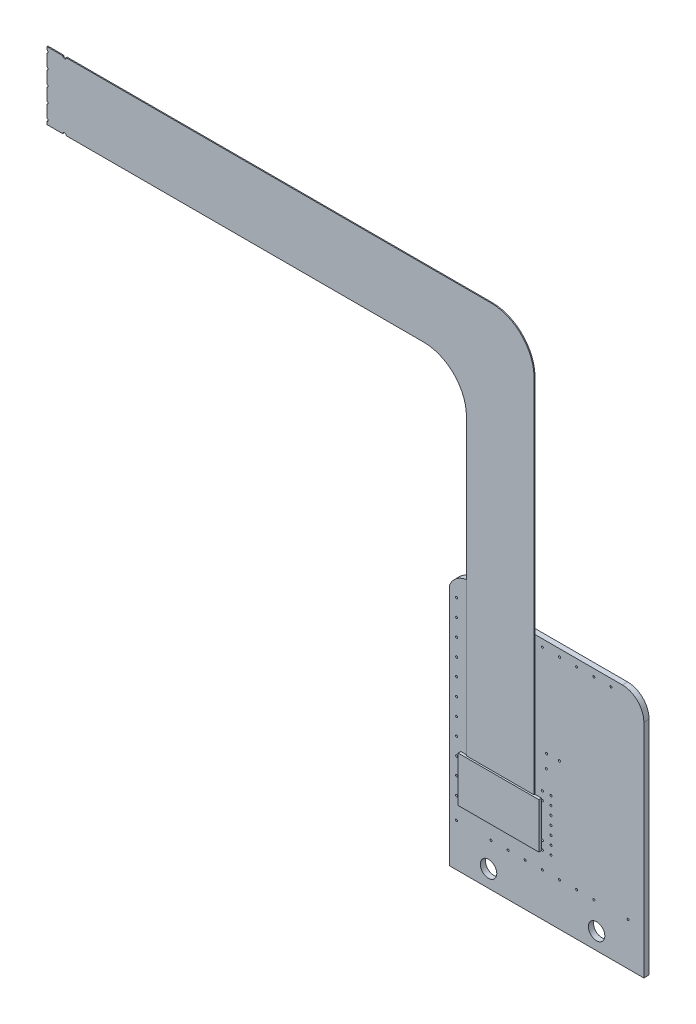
ISO-10303-21;
HEADER;
FILE_DESCRIPTION(('STEP AP214'),'2;1');
FILE_NAME('part.step','',(''),(''),'','','');
FILE_SCHEMA(('AUTOMOTIVE_DESIGN { 1 0 10303 214 1 1 1 1 }'));
ENDSEC;
DATA;
#1=APPLICATION_CONTEXT('core data for automotive mechanical design processes');
#2=APPLICATION_PROTOCOL_DEFINITION('international standard','automotive_design',2000,#1);
#3=PRODUCT_CONTEXT('',#1,'mechanical');
#4=PRODUCT('Part','Part','',(#3));
#5=PRODUCT_RELATED_PRODUCT_CATEGORY('part','',(#4));
#6=PRODUCT_DEFINITION_FORMATION('','',#4);
#7=PRODUCT_DEFINITION_CONTEXT('part definition',#1,'design');
#8=PRODUCT_DEFINITION('design','',#6,#7);
#9=PRODUCT_DEFINITION_SHAPE('','',#8);
#10=(LENGTH_UNIT() NAMED_UNIT(*) SI_UNIT(.MILLI.,.METRE.));
#11=(NAMED_UNIT(*) PLANE_ANGLE_UNIT() SI_UNIT($,.RADIAN.));
#12=(NAMED_UNIT(*) SI_UNIT($,.STERADIAN.) SOLID_ANGLE_UNIT());
#13=UNCERTAINTY_MEASURE_WITH_UNIT(LENGTH_MEASURE(1.E-05),#10,'distance_accuracy_value','');
#14=(GEOMETRIC_REPRESENTATION_CONTEXT(3) GLOBAL_UNCERTAINTY_ASSIGNED_CONTEXT((#13)) GLOBAL_UNIT_ASSIGNED_CONTEXT((#10,
#11,#12)) REPRESENTATION_CONTEXT('',''));
#15=CARTESIAN_POINT('',(0.,0.,0.));
#16=DIRECTION('',(0.,0.,1.));
#17=DIRECTION('',(1.,0.,0.));
#18=AXIS2_PLACEMENT_3D('',#15,#16,#17);
#19=CARTESIAN_POINT('',(1.64500052,15.49999948,2.77470108));
#20=DIRECTION('',(0.,-1.,0.));
#21=DIRECTION('',(0.,0.,1.));
#22=AXIS2_PLACEMENT_3D('',#19,#20,#21);
#23=PLANE('',#22);
#24=DIRECTION('',(0.,0.,-1.));
#25=VECTOR('',#24,1.);
#26=CARTESIAN_POINT('',(1.64500052,15.49999948,2.77470108));
#27=LINE('',#26,#25);
#28=CARTESIAN_POINT('',(1.64500051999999,15.49999948,1.17348));
#29=VERTEX_POINT('',#28);
#30=CARTESIAN_POINT('',(1.64500052,15.49999948,0.7747));
#31=VERTEX_POINT('',#30);
#32=EDGE_CURVE('P0_E55',#29,#31,#27,.T.);
#33=ORIENTED_EDGE('',*,*,#32,.F.);
#34=DIRECTION('',(1.,0.,0.));
#35=VECTOR('',#34,1.);
#36=CARTESIAN_POINT('',(-59.51477048,15.49999948,1.17348));
#37=LINE('',#36,#35);
#38=CARTESIAN_POINT('',(13.59499948,15.49999948,1.17348));
#39=VERTEX_POINT('',#38);
#40=EDGE_CURVE('P0_E89',#29,#39,#37,.T.);
#41=ORIENTED_EDGE('',*,*,#40,.T.);
#42=DIRECTION('',(0.,0.,-1.));
#43=VECTOR('',#42,1.);
#44=CARTESIAN_POINT('',(13.59499948,15.49999948,2.77470108));
#45=LINE('',#44,#43);
#46=CARTESIAN_POINT('',(13.59499948,15.49999948,0.7747));
#47=VERTEX_POINT('',#46);
#48=EDGE_CURVE('P0_E69',#39,#47,#45,.T.);
#49=ORIENTED_EDGE('',*,*,#48,.T.);
#50=DIRECTION('',(-1.,0.,0.));
#51=VECTOR('',#50,1.);
#52=CARTESIAN_POINT('',(1.64500052,15.49999948,0.7747));
#53=LINE('',#52,#51);
#54=EDGE_CURVE('P0_E93',#47,#31,#53,.T.);
#55=ORIENTED_EDGE('',*,*,#54,.T.);
#56=EDGE_LOOP('',(#33,#41,#49,#55));
#57=FACE_BOUND('',#56,.T.);
#58=ADVANCED_FACE('P0_F48',(#57),#23,.F.);
#59=CARTESIAN_POINT('',(1.64500052,8.77499896,2.77470108));
#60=DIRECTION('',(1.,0.,0.));
#61=DIRECTION('',(0.,0.,1.));
#62=AXIS2_PLACEMENT_3D('',#59,#60,#61);
#63=PLANE('',#62);
#64=DIRECTION('',(0.,0.,-1.));
#65=VECTOR('',#64,1.);
#66=CARTESIAN_POINT('',(1.64500052,8.77499896,2.77470108));
#67=LINE('',#66,#65);
#68=CARTESIAN_POINT('',(1.64500051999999,8.77499896,1.17348));
#69=VERTEX_POINT('',#68);
#70=CARTESIAN_POINT('',(1.64500052,8.77499896,0.7747));
#71=VERTEX_POINT('',#70);
#72=EDGE_CURVE('P0_E99',#69,#71,#67,.T.);
#73=ORIENTED_EDGE('',*,*,#72,.F.);
#74=DIRECTION('',(0.,1.,0.));
#75=VECTOR('',#74,1.);
#76=CARTESIAN_POINT('',(1.64500052,8.77499896,1.17348));
#77=LINE('',#76,#75);
#78=EDGE_CURVE('P0_E87',#69,#29,#77,.T.);
#79=ORIENTED_EDGE('',*,*,#78,.T.);
#80=ORIENTED_EDGE('',*,*,#32,.T.);
#81=DIRECTION('',(0.,-1.,0.));
#82=VECTOR('',#81,1.);
#83=CARTESIAN_POINT('',(1.64500052,8.77499896,0.7747));
#84=LINE('',#83,#82);
#85=EDGE_CURVE('P0_E105',#31,#71,#84,.T.);
#86=ORIENTED_EDGE('',*,*,#85,.T.);
#87=EDGE_LOOP('',(#73,#79,#80,#86));
#88=FACE_BOUND('',#87,.T.);
#89=ADVANCED_FACE('P0_F103',(#88),#63,.F.);
#90=CARTESIAN_POINT('',(13.59499948,8.77499896,2.77470108));
#91=DIRECTION('',(0.,1.,0.));
#92=DIRECTION('',(0.,0.,-1.));
#93=AXIS2_PLACEMENT_3D('',#90,#91,#92);
#94=PLANE('',#93);
#95=DIRECTION('',(0.,0.,-1.));
#96=VECTOR('',#95,1.);
#97=CARTESIAN_POINT('',(13.59499948,8.77499896,2.77470108));
#98=LINE('',#97,#96);
#99=CARTESIAN_POINT('',(13.59499948,8.77499896,1.17348));
#100=VERTEX_POINT('',#99);
#101=CARTESIAN_POINT('',(13.59499948,8.77499896,0.7747));
#102=VERTEX_POINT('',#101);
#103=EDGE_CURVE('P0_E101',#100,#102,#98,.T.);
#104=ORIENTED_EDGE('',*,*,#103,.F.);
#105=DIRECTION('',(1.,0.,0.));
#106=VECTOR('',#105,1.);
#107=CARTESIAN_POINT('',(-59.51477048,8.77499896,1.17348));
#108=LINE('',#107,#106);
#109=EDGE_CURVE('P0_E62',#69,#100,#108,.T.);
#110=ORIENTED_EDGE('',*,*,#109,.F.);
#111=ORIENTED_EDGE('',*,*,#72,.T.);
#112=DIRECTION('',(1.,0.,0.));
#113=VECTOR('',#112,1.);
#114=CARTESIAN_POINT('',(13.59499948,8.77499896,0.7747));
#115=LINE('',#114,#113);
#116=EDGE_CURVE('P0_E113',#71,#102,#115,.T.);
#117=ORIENTED_EDGE('',*,*,#116,.T.);
#118=EDGE_LOOP('',(#104,#110,#111,#117));
#119=FACE_BOUND('',#118,.T.);
#120=ADVANCED_FACE('P0_F97',(#119),#94,.F.);
#121=CARTESIAN_POINT('',(13.59499948,15.49999948,2.77470108));
#122=DIRECTION('',(-1.,0.,0.));
#123=DIRECTION('',(0.,0.,-1.));
#124=AXIS2_PLACEMENT_3D('',#121,#122,#123);
#125=PLANE('',#124);
#126=ORIENTED_EDGE('',*,*,#48,.F.);
#127=DIRECTION('',(0.,-1.,0.));
#128=VECTOR('',#127,1.);
#129=CARTESIAN_POINT('',(13.59499948,15.49999948,1.17348));
#130=LINE('',#129,#128);
#131=EDGE_CURVE('P0_E12',#39,#100,#130,.T.);
#132=ORIENTED_EDGE('',*,*,#131,.T.);
#133=ORIENTED_EDGE('',*,*,#103,.T.);
#134=DIRECTION('',(0.,1.,0.));
#135=VECTOR('',#134,1.);
#136=CARTESIAN_POINT('',(13.59499948,15.49999948,0.7747));
#137=LINE('',#136,#135);
#138=EDGE_CURVE('P0_E111',#102,#47,#137,.T.);
#139=ORIENTED_EDGE('',*,*,#138,.T.);
#140=EDGE_LOOP('',(#126,#132,#133,#139));
#141=FACE_BOUND('',#140,.T.);
#142=ADVANCED_FACE('P0_F118',(#141),#125,.F.);
#143=CARTESIAN_POINT('',(7.62,12.7,0.7747));
#144=DIRECTION('',(0.,0.,-1.));
#145=DIRECTION('',(1.,0.,0.));
#146=AXIS2_PLACEMENT_3D('',#143,#144,#145);
#147=PLANE('',#146);
#148=ORIENTED_EDGE('',*,*,#54,.F.);
#149=ORIENTED_EDGE('',*,*,#138,.F.);
#150=ORIENTED_EDGE('',*,*,#116,.F.);
#151=ORIENTED_EDGE('',*,*,#85,.F.);
#152=EDGE_LOOP('',(#148,#149,#150,#151));
#153=FACE_BOUND('',#152,.T.);
#154=ADVANCED_FACE('P0_F122',(#153),#147,.T.);
#155=CARTESIAN_POINT('',(-59.51477048,15.49999948,1.17348));
#156=DIRECTION('',(0.,0.,-1.));
#157=DIRECTION('',(0.,1.,0.));
#158=AXIS2_PLACEMENT_3D('',#155,#156,#157);
#159=PLANE('',#158);
#160=ORIENTED_EDGE('',*,*,#109,.T.);
#161=ORIENTED_EDGE('',*,*,#131,.F.);
#162=ORIENTED_EDGE('',*,*,#40,.F.);
#163=ORIENTED_EDGE('',*,*,#78,.F.);
#164=EDGE_LOOP('',(#160,#161,#162,#163));
#165=FACE_BOUND('',#164,.T.);
#166=ADVANCED_FACE('P0_F88',(#165),#159,.F.);
#167=CLOSED_SHELL('',(#58,#89,#120,#142,#154,#166));
#168=MANIFOLD_SOLID_BREP('P0_B2',#167);
#169=CARTESIAN_POINT('',(12.62376952,9.8298,0.7747));
#170=DIRECTION('',(-1.,0.,0.));
#171=DIRECTION('',(0.,0.,-1.));
#172=AXIS2_PLACEMENT_3D('',#169,#170,#171);
#173=PLANE('',#172);
#174=DIRECTION('',(0.,0.,1.));
#175=VECTOR('',#174,1.);
#176=CARTESIAN_POINT('',(12.62376952,12.174270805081,0.7747));
#177=LINE('',#176,#175);
#178=CARTESIAN_POINT('',(12.62376952,12.174270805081,0.91948));
#179=VERTEX_POINT('',#178);
#180=CARTESIAN_POINT('',(12.62376952,12.174270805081,0.7747));
#181=VERTEX_POINT('',#180);
#182=EDGE_CURVE('P0_E588',#179,#181,#177,.F.);
#183=ORIENTED_EDGE('',*,*,#182,.F.);
#184=DIRECTION('',(0.,-1.,0.));
#185=VECTOR('',#184,1.);
#186=CARTESIAN_POINT('',(12.62376952,9.8298,0.91948));
#187=LINE('',#186,#185);
#188=CARTESIAN_POINT('',(12.62376952,9.8298,0.91948));
#189=VERTEX_POINT('',#188);
#190=EDGE_CURVE('P0_E472',#179,#189,#187,.T.);
#191=ORIENTED_EDGE('',*,*,#190,.T.);
#192=DIRECTION('',(0.,0.,1.));
#193=VECTOR('',#192,1.);
#194=CARTESIAN_POINT('',(12.62376952,9.8298,0.7747));
#195=LINE('',#194,#193);
#196=CARTESIAN_POINT('',(12.62376952,9.8298,0.7747));
#197=VERTEX_POINT('',#196);
#198=EDGE_CURVE('P0_E519',#197,#189,#195,.T.);
#199=ORIENTED_EDGE('',*,*,#198,.F.);
#200=DIRECTION('',(0.,-1.,0.));
#201=VECTOR('',#200,1.);
#202=CARTESIAN_POINT('',(12.62376952,9.8298,0.7747));
#203=LINE('',#202,#201);
#204=EDGE_CURVE('P0_E613',#181,#197,#203,.T.);
#205=ORIENTED_EDGE('',*,*,#204,.F.);
#206=EDGE_LOOP('',(#183,#191,#199,#205));
#207=FACE_BOUND('',#206,.T.);
#208=ADVANCED_FACE('P0_F181',(#207),#173,.F.);
#209=DIRECTION('',(0.,0.,1.));
#210=VECTOR('',#209,1.);
#211=CARTESIAN_POINT('',(12.62376952,12.682169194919,0.7747));
#212=LINE('',#211,#210);
#213=CARTESIAN_POINT('',(12.62376952,12.682169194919,0.7747));
#214=VERTEX_POINT('',#213);
#215=CARTESIAN_POINT('',(12.62376952,12.682169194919,0.91948));
#216=VERTEX_POINT('',#215);
#217=EDGE_CURVE('P0_E196',#214,#216,#212,.T.);
#218=ORIENTED_EDGE('',*,*,#217,.F.);
#219=CARTESIAN_POINT('',(12.62376952,69.0626,0.7747));
#220=VERTEX_POINT('',#219);
#221=EDGE_CURVE('P0_E442',#220,#214,#203,.T.);
#222=ORIENTED_EDGE('',*,*,#221,.F.);
#223=DIRECTION('',(0.,0.,1.));
#224=VECTOR('',#223,1.);
#225=CARTESIAN_POINT('',(12.62376952,69.0626,0.7747));
#226=LINE('',#225,#224);
#227=CARTESIAN_POINT('',(12.62376952,69.0626,0.91948));
#228=VERTEX_POINT('',#227);
#229=EDGE_CURVE('P0_E522',#220,#228,#226,.T.);
#230=ORIENTED_EDGE('',*,*,#229,.T.);
#231=EDGE_CURVE('P0_E474',#228,#216,#187,.T.);
#232=ORIENTED_EDGE('',*,*,#231,.T.);
#233=EDGE_LOOP('',(#218,#222,#230,#232));
#234=FACE_BOUND('',#233,.T.);
#235=ADVANCED_FACE('P0_F622',(#234),#173,.F.);
#236=CARTESIAN_POINT('',(2.61616952,9.8298,0.7747));
#237=DIRECTION('',(0.,1.,0.));
#238=DIRECTION('',(0.,0.,-1.));
#239=AXIS2_PLACEMENT_3D('',#236,#237,#238);
#240=PLANE('',#239);
#241=DIRECTION('',(0.,0.,1.));
#242=VECTOR('',#241,1.);
#243=CARTESIAN_POINT('',(9.61386952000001,9.8298,0.7747));
#244=LINE('',#243,#242);
#245=CARTESIAN_POINT('',(9.61386952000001,9.8298,0.91948));
#246=VERTEX_POINT('',#245);
#247=CARTESIAN_POINT('',(9.61386952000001,9.8298,0.7747));
#248=VERTEX_POINT('',#247);
#249=EDGE_CURVE('P0_E608',#246,#248,#244,.F.);
#250=ORIENTED_EDGE('',*,*,#249,.F.);
#251=DIRECTION('',(-1.,0.,0.));
#252=VECTOR('',#251,1.);
#253=CARTESIAN_POINT('',(2.61616952,9.8298,0.91948));
#254=LINE('',#253,#252);
#255=CARTESIAN_POINT('',(7.80792952,9.8298,0.91948));
#256=VERTEX_POINT('',#255);
#257=EDGE_CURVE('P0_E656',#246,#256,#254,.T.);
#258=ORIENTED_EDGE('',*,*,#257,.T.);
#259=DIRECTION('',(0.,0.,1.));
#260=VECTOR('',#259,1.);
#261=CARTESIAN_POINT('',(7.80792952,9.8298,0.7747));
#262=LINE('',#261,#260);
#263=CARTESIAN_POINT('',(7.80792952,9.8298,0.7747));
#264=VERTEX_POINT('',#263);
#265=EDGE_CURVE('P0_E599',#264,#256,#262,.T.);
#266=ORIENTED_EDGE('',*,*,#265,.F.);
#267=DIRECTION('',(-1.,0.,0.));
#268=VECTOR('',#267,1.);
#269=CARTESIAN_POINT('',(2.61616952,9.8298,0.7747));
#270=LINE('',#269,#268);
#271=EDGE_CURVE('P0_E441',#248,#264,#270,.T.);
#272=ORIENTED_EDGE('',*,*,#271,.F.);
#273=EDGE_LOOP('',(#250,#258,#266,#272));
#274=FACE_BOUND('',#273,.T.);
#275=ADVANCED_FACE('P0_F653',(#274),#240,.F.);
#276=DIRECTION('',(0.,0.,1.));
#277=VECTOR('',#276,1.);
#278=CARTESIAN_POINT('',(9.99486952,9.8298,0.7747));
#279=LINE('',#278,#277);
#280=CARTESIAN_POINT('',(9.99486952,9.8298,0.7747));
#281=VERTEX_POINT('',#280);
#282=CARTESIAN_POINT('',(9.99486952,9.8298,0.91948));
#283=VERTEX_POINT('',#282);
#284=EDGE_CURVE('P0_E606',#281,#283,#279,.T.);
#285=ORIENTED_EDGE('',*,*,#284,.F.);
#286=CARTESIAN_POINT('',(11.80080952,9.8298,0.7747));
#287=VERTEX_POINT('',#286);
#288=EDGE_CURVE('P0_E448',#287,#281,#270,.T.);
#289=ORIENTED_EDGE('',*,*,#288,.F.);
#290=DIRECTION('',(0.,0.,1.));
#291=VECTOR('',#290,1.);
#292=CARTESIAN_POINT('',(11.80080952,9.8298,0.7747));
#293=LINE('',#292,#291);
#294=CARTESIAN_POINT('',(11.80080952,9.8298,0.91948));
#295=VERTEX_POINT('',#294);
#296=EDGE_CURVE('P0_E597',#295,#287,#293,.F.);
#297=ORIENTED_EDGE('',*,*,#296,.F.);
#298=EDGE_CURVE('P0_E482',#295,#283,#254,.T.);
#299=ORIENTED_EDGE('',*,*,#298,.T.);
#300=EDGE_LOOP('',(#285,#289,#297,#299));
#301=FACE_BOUND('',#300,.T.);
#302=ADVANCED_FACE('P0_F643',(#301),#240,.F.);
#303=DIRECTION('',(0.,0.,1.));
#304=VECTOR('',#303,1.);
#305=CARTESIAN_POINT('',(7.42692952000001,9.8298,0.7747));
#306=LINE('',#305,#304);
#307=CARTESIAN_POINT('',(7.42692952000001,9.8298,0.91948));
#308=VERTEX_POINT('',#307);
#309=CARTESIAN_POINT('',(7.42692952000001,9.8298,0.7747));
#310=VERTEX_POINT('',#309);
#311=EDGE_CURVE('P0_E601',#308,#310,#306,.F.);
#312=ORIENTED_EDGE('',*,*,#311,.F.);
#313=CARTESIAN_POINT('',(5.62098952,9.8298,0.91948));
#314=VERTEX_POINT('',#313);
#315=EDGE_CURVE('P0_E665',#308,#314,#254,.T.);
#316=ORIENTED_EDGE('',*,*,#315,.T.);
#317=DIRECTION('',(0.,0.,1.));
#318=VECTOR('',#317,1.);
#319=CARTESIAN_POINT('',(5.62098952,9.8298,0.7747));
#320=LINE('',#319,#318);
#321=CARTESIAN_POINT('',(5.62098952,9.8298,0.7747));
#322=VERTEX_POINT('',#321);
#323=EDGE_CURVE('P0_E425',#322,#314,#320,.T.);
#324=ORIENTED_EDGE('',*,*,#323,.F.);
#325=EDGE_CURVE('P0_E436',#310,#322,#270,.T.);
#326=ORIENTED_EDGE('',*,*,#325,.F.);
#327=EDGE_LOOP('',(#312,#316,#324,#326));
#328=FACE_BOUND('',#327,.T.);
#329=ADVANCED_FACE('P0_F853',(#328),#240,.F.);
#330=DIRECTION('',(0.,0.,1.));
#331=VECTOR('',#330,1.);
#332=CARTESIAN_POINT('',(12.18180952,9.8298,0.7747));
#333=LINE('',#332,#331);
#334=CARTESIAN_POINT('',(12.18180952,9.8298,0.7747));
#335=VERTEX_POINT('',#334);
#336=CARTESIAN_POINT('',(12.18180952,9.8298,0.91948));
#337=VERTEX_POINT('',#336);
#338=EDGE_CURVE('P0_E595',#335,#337,#333,.T.);
#339=ORIENTED_EDGE('',*,*,#338,.F.);
#340=EDGE_CURVE('P0_E443',#197,#335,#270,.T.);
#341=ORIENTED_EDGE('',*,*,#340,.F.);
#342=ORIENTED_EDGE('',*,*,#198,.T.);
#343=EDGE_CURVE('P0_E478',#189,#337,#254,.T.);
#344=ORIENTED_EDGE('',*,*,#343,.T.);
#345=EDGE_LOOP('',(#339,#341,#342,#344));
#346=FACE_BOUND('',#345,.T.);
#347=ADVANCED_FACE('P0_F631',(#346),#240,.F.);
#348=DIRECTION('',(0.,0.,1.));
#349=VECTOR('',#348,1.);
#350=CARTESIAN_POINT('',(3.05304952,9.8298,0.7747));
#351=LINE('',#350,#349);
#352=CARTESIAN_POINT('',(3.05304952,9.8298,0.91948));
#353=VERTEX_POINT('',#352);
#354=CARTESIAN_POINT('',(3.05304952,9.8298,0.7747));
#355=VERTEX_POINT('',#354);
#356=EDGE_CURVE('P0_E699',#353,#355,#351,.F.);
#357=ORIENTED_EDGE('',*,*,#356,.F.);
#358=CARTESIAN_POINT('',(2.61616952,9.8298,0.91948));
#359=VERTEX_POINT('',#358);
#360=EDGE_CURVE('P0_E477',#353,#359,#254,.T.);
#361=ORIENTED_EDGE('',*,*,#360,.T.);
#362=DIRECTION('',(0.,0.,1.));
#363=VECTOR('',#362,1.);
#364=CARTESIAN_POINT('',(2.61616952,9.8298,0.7747));
#365=LINE('',#364,#363);
#366=CARTESIAN_POINT('',(2.61616952,9.8298,0.7747));
#367=VERTEX_POINT('',#366);
#368=EDGE_CURVE('P0_E516',#367,#359,#365,.T.);
#369=ORIENTED_EDGE('',*,*,#368,.F.);
#370=EDGE_CURVE('P0_E439',#355,#367,#270,.T.);
#371=ORIENTED_EDGE('',*,*,#370,.F.);
#372=EDGE_LOOP('',(#357,#361,#369,#371));
#373=FACE_BOUND('',#372,.T.);
#374=ADVANCED_FACE('P0_F850',(#373),#240,.F.);
#375=DIRECTION('',(0.,0.,1.));
#376=VECTOR('',#375,1.);
#377=CARTESIAN_POINT('',(3.43404952,9.8298,0.7747));
#378=LINE('',#377,#376);
#379=CARTESIAN_POINT('',(3.43404952,9.8298,0.7747));
#380=VERTEX_POINT('',#379);
#381=CARTESIAN_POINT('',(3.43404952,9.8298,0.91948));
#382=VERTEX_POINT('',#381);
#383=EDGE_CURVE('P0_E204',#380,#382,#378,.T.);
#384=ORIENTED_EDGE('',*,*,#383,.F.);
#385=CARTESIAN_POINT('',(5.23998952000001,9.8298,0.7747));
#386=VERTEX_POINT('',#385);
#387=EDGE_CURVE('P0_E433',#386,#380,#270,.T.);
#388=ORIENTED_EDGE('',*,*,#387,.F.);
#389=DIRECTION('',(0.,0.,1.));
#390=VECTOR('',#389,1.);
#391=CARTESIAN_POINT('',(5.23998952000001,9.8298,0.7747));
#392=LINE('',#391,#390);
#393=CARTESIAN_POINT('',(5.23998952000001,9.8298,0.91948));
#394=VERTEX_POINT('',#393);
#395=EDGE_CURVE('P0_E413',#394,#386,#392,.F.);
#396=ORIENTED_EDGE('',*,*,#395,.F.);
#397=EDGE_CURVE('P0_E851',#394,#382,#254,.T.);
#398=ORIENTED_EDGE('',*,*,#397,.T.);
#399=EDGE_LOOP('',(#384,#388,#396,#398));
#400=FACE_BOUND('',#399,.T.);
#401=ADVANCED_FACE('P0_F438',(#400),#240,.F.);
#402=CARTESIAN_POINT('',(2.61616952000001,59.055,0.7747));
#403=DIRECTION('',(1.,0.,0.));
#404=DIRECTION('',(0.,0.,1.));
#405=AXIS2_PLACEMENT_3D('',#402,#403,#404);
#406=PLANE('',#405);
#407=DIRECTION('',(0.,0.,1.));
#408=VECTOR('',#407,1.);
#409=CARTESIAN_POINT('',(2.61616952,12.68222,0.7747));
#410=LINE('',#409,#408);
#411=CARTESIAN_POINT('',(2.61616952,12.68222,0.91948));
#412=VERTEX_POINT('',#411);
#413=CARTESIAN_POINT('',(2.61616952,12.68222,0.7747));
#414=VERTEX_POINT('',#413);
#415=EDGE_CURVE('P0_E696',#412,#414,#410,.F.);
#416=ORIENTED_EDGE('',*,*,#415,.F.);
#417=DIRECTION('',(0.,1.,0.));
#418=VECTOR('',#417,1.);
#419=CARTESIAN_POINT('',(2.61616952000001,59.055,0.91948));
#420=LINE('',#419,#418);
#421=CARTESIAN_POINT('',(2.61616952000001,59.055,0.91948));
#422=VERTEX_POINT('',#421);
#423=EDGE_CURVE('P0_E481',#412,#422,#420,.T.);
#424=ORIENTED_EDGE('',*,*,#423,.T.);
#425=DIRECTION('',(0.,0.,1.));
#426=VECTOR('',#425,1.);
#427=CARTESIAN_POINT('',(2.61616952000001,59.055,0.7747));
#428=LINE('',#427,#426);
#429=CARTESIAN_POINT('',(2.61616952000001,59.055,0.7747));
#430=VERTEX_POINT('',#429);
#431=EDGE_CURVE('P0_E513',#430,#422,#428,.T.);
#432=ORIENTED_EDGE('',*,*,#431,.F.);
#433=DIRECTION('',(0.,1.,0.));
#434=VECTOR('',#433,1.);
#435=CARTESIAN_POINT('',(2.61616952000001,59.055,0.7747));
#436=LINE('',#435,#434);
#437=EDGE_CURVE('P0_E447',#414,#430,#436,.T.);
#438=ORIENTED_EDGE('',*,*,#437,.F.);
#439=EDGE_LOOP('',(#416,#424,#432,#438));
#440=FACE_BOUND('',#439,.T.);
#441=ADVANCED_FACE('P0_F783',(#440),#406,.F.);
#442=DIRECTION('',(0.,0.,1.));
#443=VECTOR('',#442,1.);
#444=CARTESIAN_POINT('',(2.61616952,12.17422,0.7747));
#445=LINE('',#444,#443);
#446=CARTESIAN_POINT('',(2.61616952,12.17422,0.7747));
#447=VERTEX_POINT('',#446);
#448=CARTESIAN_POINT('',(2.61616952,12.17422,0.91948));
#449=VERTEX_POINT('',#448);
#450=EDGE_CURVE('P0_E694',#447,#449,#445,.T.);
#451=ORIENTED_EDGE('',*,*,#450,.F.);
#452=EDGE_CURVE('P0_E450',#367,#447,#436,.T.);
#453=ORIENTED_EDGE('',*,*,#452,.F.);
#454=ORIENTED_EDGE('',*,*,#368,.T.);
#455=EDGE_CURVE('P0_E483',#359,#449,#420,.T.);
#456=ORIENTED_EDGE('',*,*,#455,.T.);
#457=EDGE_LOOP('',(#451,#453,#454,#456));
#458=FACE_BOUND('',#457,.T.);
#459=ADVANCED_FACE('P0_F786',(#458),#406,.F.);
#460=CARTESIAN_POINT('',(-59.51477048,65.405,0.7747));
#461=DIRECTION('',(0.,1.,0.));
#462=DIRECTION('',(0.,0.,-1.));
#463=AXIS2_PLACEMENT_3D('',#460,#461,#462);
#464=PLANE('',#463);
#465=DIRECTION('',(0.,0.,1.));
#466=VECTOR('',#465,1.);
#467=CARTESIAN_POINT('',(-57.170299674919,65.405,0.7747));
#468=LINE('',#467,#466);
#469=CARTESIAN_POINT('',(-57.170299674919,65.405,0.91948));
#470=VERTEX_POINT('',#469);
#471=CARTESIAN_POINT('',(-57.170299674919,65.405,0.7747));
#472=VERTEX_POINT('',#471);
#473=EDGE_CURVE('P0_E692',#470,#472,#468,.F.);
#474=ORIENTED_EDGE('',*,*,#473,.F.);
#475=DIRECTION('',(-1.,0.,0.));
#476=VECTOR('',#475,1.);
#477=CARTESIAN_POINT('',(-59.51477048,65.405,0.91948));
#478=LINE('',#477,#476);
#479=CARTESIAN_POINT('',(-59.51477048,65.405,0.91948));
#480=VERTEX_POINT('',#479);
#481=EDGE_CURVE('P0_E488',#470,#480,#478,.T.);
#482=ORIENTED_EDGE('',*,*,#481,.T.);
#483=DIRECTION('',(0.,0.,1.));
#484=VECTOR('',#483,1.);
#485=CARTESIAN_POINT('',(-59.51477048,65.405,0.7747));
#486=LINE('',#485,#484);
#487=CARTESIAN_POINT('',(-59.51477048,65.405,0.7747));
#488=VERTEX_POINT('',#487);
#489=EDGE_CURVE('P0_E507',#488,#480,#486,.T.);
#490=ORIENTED_EDGE('',*,*,#489,.F.);
#491=DIRECTION('',(-1.,0.,0.));
#492=VECTOR('',#491,1.);
#493=CARTESIAN_POINT('',(-59.51477048,65.405,0.7747));
#494=LINE('',#493,#492);
#495=EDGE_CURVE('P0_E455',#472,#488,#494,.T.);
#496=ORIENTED_EDGE('',*,*,#495,.F.);
#497=EDGE_LOOP('',(#474,#482,#490,#496));
#498=FACE_BOUND('',#497,.T.);
#499=ADVANCED_FACE('P0_F756',(#498),#464,.F.);
#500=DIRECTION('',(0.,0.,1.));
#501=VECTOR('',#500,1.);
#502=CARTESIAN_POINT('',(-56.662401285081,65.405,0.7747));
#503=LINE('',#502,#501);
#504=CARTESIAN_POINT('',(-56.662401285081,65.405,0.7747));
#505=VERTEX_POINT('',#504);
#506=CARTESIAN_POINT('',(-56.662401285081,65.405,0.91948));
#507=VERTEX_POINT('',#506);
#508=EDGE_CURVE('P0_E690',#505,#507,#503,.T.);
#509=ORIENTED_EDGE('',*,*,#508,.F.);
#510=CARTESIAN_POINT('',(-3.73383047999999,65.405,0.7747));
#511=VERTEX_POINT('',#510);
#512=EDGE_CURVE('P0_E456',#511,#505,#494,.T.);
#513=ORIENTED_EDGE('',*,*,#512,.F.);
#514=DIRECTION('',(0.,0.,1.));
#515=VECTOR('',#514,1.);
#516=CARTESIAN_POINT('',(-3.73383047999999,65.405,0.7747));
#517=LINE('',#516,#515);
#518=CARTESIAN_POINT('',(-3.73383047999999,65.405,0.91948));
#519=VERTEX_POINT('',#518);
#520=EDGE_CURVE('P0_E510',#511,#519,#517,.T.);
#521=ORIENTED_EDGE('',*,*,#520,.T.);
#522=EDGE_CURVE('P0_E489',#519,#507,#478,.T.);
#523=ORIENTED_EDGE('',*,*,#522,.T.);
#524=EDGE_LOOP('',(#509,#513,#521,#523));
#525=FACE_BOUND('',#524,.T.);
#526=ADVANCED_FACE('P0_F794',(#525),#464,.F.);
#527=CARTESIAN_POINT('',(-59.51477048,75.4126,0.7747));
#528=DIRECTION('',(1.,0.,0.));
#529=DIRECTION('',(0.,0.,1.));
#530=AXIS2_PLACEMENT_3D('',#527,#528,#529);
#531=PLANE('',#530);
#532=DIRECTION('',(0.,0.,1.));
#533=VECTOR('',#532,1.);
#534=CARTESIAN_POINT('',(-59.51477048,74.97572,0.7747));
#535=LINE('',#534,#533);
#536=CARTESIAN_POINT('',(-59.51477048,74.97572,0.91948));
#537=VERTEX_POINT('',#536);
#538=CARTESIAN_POINT('',(-59.51477048,74.97572,0.7747));
#539=VERTEX_POINT('',#538);
#540=EDGE_CURVE('P0_E473',#537,#539,#535,.F.);
#541=ORIENTED_EDGE('',*,*,#540,.F.);
#542=DIRECTION('',(0.,1.,0.));
#543=VECTOR('',#542,1.);
#544=CARTESIAN_POINT('',(-59.51477048,75.4126,0.91948));
#545=LINE('',#544,#543);
#546=CARTESIAN_POINT('',(-59.51477048,75.4126,0.91948));
#547=VERTEX_POINT('',#546);
#548=EDGE_CURVE('P0_E492',#537,#547,#545,.T.);
#549=ORIENTED_EDGE('',*,*,#548,.T.);
#550=DIRECTION('',(0.,0.,1.));
#551=VECTOR('',#550,1.);
#552=CARTESIAN_POINT('',(-59.51477048,75.4126,0.7747));
#553=LINE('',#552,#551);
#554=CARTESIAN_POINT('',(-59.51477048,75.4126,0.7747));
#555=VERTEX_POINT('',#554);
#556=EDGE_CURVE('P0_E504',#555,#547,#553,.T.);
#557=ORIENTED_EDGE('',*,*,#556,.F.);
#558=DIRECTION('',(0.,1.,0.));
#559=VECTOR('',#558,1.);
#560=CARTESIAN_POINT('',(-59.51477048,75.4126,0.7747));
#561=LINE('',#560,#559);
#562=EDGE_CURVE('P0_E459',#539,#555,#561,.T.);
#563=ORIENTED_EDGE('',*,*,#562,.F.);
#564=EDGE_LOOP('',(#541,#549,#557,#563));
#565=FACE_BOUND('',#564,.T.);
#566=ADVANCED_FACE('P0_F568',(#565),#531,.F.);
#567=DIRECTION('',(0.,0.,1.));
#568=VECTOR('',#567,1.);
#569=CARTESIAN_POINT('',(-59.51477048,74.59472,0.7747));
#570=LINE('',#569,#568);
#571=CARTESIAN_POINT('',(-59.51477048,74.59472,0.7747));
#572=VERTEX_POINT('',#571);
#573=CARTESIAN_POINT('',(-59.51477048,74.59472,0.91948));
#574=VERTEX_POINT('',#573);
#575=EDGE_CURVE('P0_E610',#572,#574,#570,.T.);
#576=ORIENTED_EDGE('',*,*,#575,.F.);
#577=CARTESIAN_POINT('',(-59.51477048,72.78878,0.7747));
#578=VERTEX_POINT('',#577);
#579=EDGE_CURVE('P0_E723',#578,#572,#561,.T.);
#580=ORIENTED_EDGE('',*,*,#579,.F.);
#581=DIRECTION('',(0.,0.,1.));
#582=VECTOR('',#581,1.);
#583=CARTESIAN_POINT('',(-59.51477048,72.78878,0.7747));
#584=LINE('',#583,#582);
#585=CARTESIAN_POINT('',(-59.51477048,72.78878,0.91948));
#586=VERTEX_POINT('',#585);
#587=EDGE_CURVE('P0_E604',#586,#578,#584,.F.);
#588=ORIENTED_EDGE('',*,*,#587,.F.);
#589=EDGE_CURVE('P0_E550',#586,#574,#545,.T.);
#590=ORIENTED_EDGE('',*,*,#589,.T.);
#591=EDGE_LOOP('',(#576,#580,#588,#590));
#592=FACE_BOUND('',#591,.T.);
#593=ADVANCED_FACE('P0_F729',(#592),#531,.F.);
#594=DIRECTION('',(0.,0.,1.));
#595=VECTOR('',#594,1.);
#596=CARTESIAN_POINT('',(-59.51477048,72.40778,0.7747));
#597=LINE('',#596,#595);
#598=CARTESIAN_POINT('',(-59.51477048,72.40778,0.7747));
#599=VERTEX_POINT('',#598);
#600=CARTESIAN_POINT('',(-59.51477048,72.40778,0.91948));
#601=VERTEX_POINT('',#600);
#602=EDGE_CURVE('P0_E558',#599,#601,#597,.T.);
#603=ORIENTED_EDGE('',*,*,#602,.F.);
#604=CARTESIAN_POINT('',(-59.51477048,70.60184,0.7747));
#605=VERTEX_POINT('',#604);
#606=EDGE_CURVE('P0_E722',#605,#599,#561,.T.);
#607=ORIENTED_EDGE('',*,*,#606,.F.);
#608=DIRECTION('',(0.,0.,1.));
#609=VECTOR('',#608,1.);
#610=CARTESIAN_POINT('',(-59.51477048,70.60184,0.7747));
#611=LINE('',#610,#609);
#612=CARTESIAN_POINT('',(-59.51477048,70.60184,0.91948));
#613=VERTEX_POINT('',#612);
#614=EDGE_CURVE('P0_E560',#613,#605,#611,.F.);
#615=ORIENTED_EDGE('',*,*,#614,.F.);
#616=EDGE_CURVE('P0_E548',#613,#601,#545,.T.);
#617=ORIENTED_EDGE('',*,*,#616,.T.);
#618=EDGE_LOOP('',(#603,#607,#615,#617));
#619=FACE_BOUND('',#618,.T.);
#620=ADVANCED_FACE('P0_F556',(#619),#531,.F.);
#621=DIRECTION('',(0.,0.,1.));
#622=VECTOR('',#621,1.);
#623=CARTESIAN_POINT('',(-59.51477048,68.4149,0.7747));
#624=LINE('',#623,#622);
#625=CARTESIAN_POINT('',(-59.51477048,68.4149,0.91948));
#626=VERTEX_POINT('',#625);
#627=CARTESIAN_POINT('',(-59.51477048,68.4149,0.7747));
#628=VERTEX_POINT('',#627);
#629=EDGE_CURVE('P0_E590',#626,#628,#624,.F.);
#630=ORIENTED_EDGE('',*,*,#629,.F.);
#631=CARTESIAN_POINT('',(-59.51477048,70.22084,0.91948));
#632=VERTEX_POINT('',#631);
#633=EDGE_CURVE('P0_E561',#626,#632,#545,.T.);
#634=ORIENTED_EDGE('',*,*,#633,.T.);
#635=DIRECTION('',(0.,0.,1.));
#636=VECTOR('',#635,1.);
#637=CARTESIAN_POINT('',(-59.51477048,70.22084,0.7747));
#638=LINE('',#637,#636);
#639=CARTESIAN_POINT('',(-59.51477048,70.22084,0.7747));
#640=VERTEX_POINT('',#639);
#641=EDGE_CURVE('P0_E424',#640,#632,#638,.T.);
#642=ORIENTED_EDGE('',*,*,#641,.F.);
#643=EDGE_CURVE('P0_E717',#628,#640,#561,.T.);
#644=ORIENTED_EDGE('',*,*,#643,.F.);
#645=EDGE_LOOP('',(#630,#634,#642,#644));
#646=FACE_BOUND('',#645,.T.);
#647=ADVANCED_FACE('P0_F721',(#646),#531,.F.);
#648=DIRECTION('',(0.,0.,1.));
#649=VECTOR('',#648,1.);
#650=CARTESIAN_POINT('',(-59.51477048,68.0339,0.7747));
#651=LINE('',#650,#649);
#652=CARTESIAN_POINT('',(-59.51477048,68.0339,0.7747));
#653=VERTEX_POINT('',#652);
#654=CARTESIAN_POINT('',(-59.51477048,68.0339,0.91948));
#655=VERTEX_POINT('',#654);
#656=EDGE_CURVE('P0_E705',#653,#655,#651,.T.);
#657=ORIENTED_EDGE('',*,*,#656,.F.);
#658=CARTESIAN_POINT('',(-59.51477048,66.22796,0.7747));
#659=VERTEX_POINT('',#658);
#660=EDGE_CURVE('P0_E464',#659,#653,#561,.T.);
#661=ORIENTED_EDGE('',*,*,#660,.F.);
#662=DIRECTION('',(0.,0.,1.));
#663=VECTOR('',#662,1.);
#664=CARTESIAN_POINT('',(-59.51477048,66.22796,0.7747));
#665=LINE('',#664,#663);
#666=CARTESIAN_POINT('',(-59.51477048,66.22796,0.91948));
#667=VERTEX_POINT('',#666);
#668=EDGE_CURVE('P0_E703',#667,#659,#665,.F.);
#669=ORIENTED_EDGE('',*,*,#668,.F.);
#670=EDGE_CURVE('P0_E497',#667,#655,#545,.T.);
#671=ORIENTED_EDGE('',*,*,#670,.T.);
#672=EDGE_LOOP('',(#657,#661,#669,#671));
#673=FACE_BOUND('',#672,.T.);
#674=ADVANCED_FACE('P0_F761',(#673),#531,.F.);
#675=DIRECTION('',(0.,0.,1.));
#676=VECTOR('',#675,1.);
#677=CARTESIAN_POINT('',(-59.51477048,65.84696,0.7747));
#678=LINE('',#677,#676);
#679=CARTESIAN_POINT('',(-59.51477048,65.84696,0.7747));
#680=VERTEX_POINT('',#679);
#681=CARTESIAN_POINT('',(-59.51477048,65.84696,0.91948));
#682=VERTEX_POINT('',#681);
#683=EDGE_CURVE('P0_E701',#680,#682,#678,.T.);
#684=ORIENTED_EDGE('',*,*,#683,.F.);
#685=EDGE_CURVE('P0_E460',#488,#680,#561,.T.);
#686=ORIENTED_EDGE('',*,*,#685,.F.);
#687=ORIENTED_EDGE('',*,*,#489,.T.);
#688=EDGE_CURVE('P0_E493',#480,#682,#545,.T.);
#689=ORIENTED_EDGE('',*,*,#688,.T.);
#690=EDGE_LOOP('',(#684,#686,#687,#689));
#691=FACE_BOUND('',#690,.T.);
#692=ADVANCED_FACE('P0_F749',(#691),#531,.F.);
#693=CARTESIAN_POINT('',(6.27376952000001,75.4126,0.7747));
#694=DIRECTION('',(0.,-1.,0.));
#695=DIRECTION('',(0.,0.,1.));
#696=AXIS2_PLACEMENT_3D('',#693,#694,#695);
#697=PLANE('',#696);
#698=DIRECTION('',(0.,0.,1.));
#699=VECTOR('',#698,1.);
#700=CARTESIAN_POINT('',(-56.66235048,75.4126,0.7747));
#701=LINE('',#700,#699);
#702=CARTESIAN_POINT('',(-56.66235048,75.4126,0.91948));
#703=VERTEX_POINT('',#702);
#704=CARTESIAN_POINT('',(-56.66235048,75.4126,0.7747));
#705=VERTEX_POINT('',#704);
#706=EDGE_CURVE('P0_E580',#703,#705,#701,.F.);
#707=ORIENTED_EDGE('',*,*,#706,.F.);
#708=DIRECTION('',(1.,0.,0.));
#709=VECTOR('',#708,1.);
#710=CARTESIAN_POINT('',(6.27376952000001,75.4126,0.91948));
#711=LINE('',#710,#709);
#712=CARTESIAN_POINT('',(6.27376952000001,75.4126,0.91948));
#713=VERTEX_POINT('',#712);
#714=EDGE_CURVE('P0_E496',#703,#713,#711,.T.);
#715=ORIENTED_EDGE('',*,*,#714,.T.);
#716=DIRECTION('',(0.,0.,1.));
#717=VECTOR('',#716,1.);
#718=CARTESIAN_POINT('',(6.27376952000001,75.4126,0.7747));
#719=LINE('',#718,#717);
#720=CARTESIAN_POINT('',(6.27376952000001,75.4126,0.7747));
#721=VERTEX_POINT('',#720);
#722=EDGE_CURVE('P0_E468',#721,#713,#719,.T.);
#723=ORIENTED_EDGE('',*,*,#722,.F.);
#724=DIRECTION('',(1.,0.,0.));
#725=VECTOR('',#724,1.);
#726=CARTESIAN_POINT('',(6.27376952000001,75.4126,0.7747));
#727=LINE('',#726,#725);
#728=EDGE_CURVE('P0_E463',#705,#721,#727,.T.);
#729=ORIENTED_EDGE('',*,*,#728,.F.);
#730=EDGE_LOOP('',(#707,#715,#723,#729));
#731=FACE_BOUND('',#730,.T.);
#732=ADVANCED_FACE('P0_F585',(#731),#697,.F.);
#733=DIRECTION('',(0.,0.,1.));
#734=VECTOR('',#733,1.);
#735=CARTESIAN_POINT('',(-57.17035048,75.4126,0.7747));
#736=LINE('',#735,#734);
#737=CARTESIAN_POINT('',(-57.17035048,75.4126,0.7747));
#738=VERTEX_POINT('',#737);
#739=CARTESIAN_POINT('',(-57.17035048,75.4126,0.91948));
#740=VERTEX_POINT('',#739);
#741=EDGE_CURVE('P0_E582',#738,#740,#736,.T.);
#742=ORIENTED_EDGE('',*,*,#741,.F.);
#743=EDGE_CURVE('P0_E465',#555,#738,#727,.T.);
#744=ORIENTED_EDGE('',*,*,#743,.F.);
#745=ORIENTED_EDGE('',*,*,#556,.T.);
#746=EDGE_CURVE('P0_E498',#547,#740,#711,.T.);
#747=ORIENTED_EDGE('',*,*,#746,.T.);
#748=EDGE_LOOP('',(#742,#744,#745,#747));
#749=FACE_BOUND('',#748,.T.);
#750=ADVANCED_FACE('P0_F574',(#749),#697,.F.);
#751=CARTESIAN_POINT('',(6.27376952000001,69.0626,0.7747));
#752=DIRECTION('',(0.,0.,1.));
#753=DIRECTION('',(0.,1.,0.));
#754=AXIS2_PLACEMENT_3D('',#751,#752,#753);
#755=CYLINDRICAL_SURFACE('',#754,6.35);
#756=CARTESIAN_POINT('',(6.27376952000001,69.0626,0.91948));
#757=DIRECTION('',(0.,0.,-1.));
#758=DIRECTION('',(0.,1.,0.));
#759=AXIS2_PLACEMENT_3D('',#756,#757,#758);
#760=CIRCLE('',#759,6.35);
#761=EDGE_CURVE('P0_E469',#713,#228,#760,.T.);
#762=ORIENTED_EDGE('',*,*,#761,.T.);
#763=ORIENTED_EDGE('',*,*,#229,.F.);
#764=CARTESIAN_POINT('',(6.27376952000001,69.0626,0.7747));
#765=DIRECTION('',(0.,0.,-1.));
#766=DIRECTION('',(0.,1.,0.));
#767=AXIS2_PLACEMENT_3D('',#764,#765,#766);
#768=CIRCLE('',#767,6.35);
#769=EDGE_CURVE('P0_E501',#721,#220,#768,.T.);
#770=ORIENTED_EDGE('',*,*,#769,.F.);
#771=ORIENTED_EDGE('',*,*,#722,.T.);
#772=EDGE_LOOP('',(#762,#763,#770,#771));
#773=FACE_BOUND('',#772,.T.);
#774=ADVANCED_FACE('P0_F183',(#773),#755,.T.);
#775=CARTESIAN_POINT('',(-3.73383047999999,59.055,0.7747));
#776=DIRECTION('',(0.,0.,1.));
#777=DIRECTION('',(0.,1.,0.));
#778=AXIS2_PLACEMENT_3D('',#775,#776,#777);
#779=CYLINDRICAL_SURFACE('',#778,6.35);
#780=CARTESIAN_POINT('',(-3.73383047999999,59.055,0.91948));
#781=DIRECTION('',(0.,0.,1.));
#782=DIRECTION('',(0.,-1.,0.));
#783=AXIS2_PLACEMENT_3D('',#780,#781,#782);
#784=CIRCLE('',#783,6.35);
#785=EDGE_CURVE('P0_E486',#422,#519,#784,.T.);
#786=ORIENTED_EDGE('',*,*,#785,.T.);
#787=ORIENTED_EDGE('',*,*,#520,.F.);
#788=CARTESIAN_POINT('',(-3.73383047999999,59.055,0.7747));
#789=DIRECTION('',(0.,0.,1.));
#790=DIRECTION('',(0.,-1.,0.));
#791=AXIS2_PLACEMENT_3D('',#788,#789,#790);
#792=CIRCLE('',#791,6.35);
#793=EDGE_CURVE('P0_E453',#430,#511,#792,.T.);
#794=ORIENTED_EDGE('',*,*,#793,.F.);
#795=ORIENTED_EDGE('',*,*,#431,.T.);
#796=EDGE_LOOP('',(#786,#787,#794,#795));
#797=FACE_BOUND('',#796,.T.);
#798=ADVANCED_FACE('P0_F788',(#797),#779,.F.);
#799=CARTESIAN_POINT('',(6.27376952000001,69.0626,0.7747));
#800=DIRECTION('',(0.,0.,1.));
#801=DIRECTION('',(0.,1.,0.));
#802=AXIS2_PLACEMENT_3D('',#799,#800,#801);
#803=PLANE('',#802);
#804=CARTESIAN_POINT('',(-59.51477048,74.78522,0.7747));
#805=DIRECTION('',(0.,0.,-1.));
#806=DIRECTION('',(0.,-1.,0.));
#807=AXIS2_PLACEMENT_3D('',#804,#805,#806);
#808=CIRCLE('',#807,0.1905);
#809=EDGE_CURVE('P0_E674',#539,#572,#808,.T.);
#810=ORIENTED_EDGE('',*,*,#809,.F.);
#811=ORIENTED_EDGE('',*,*,#562,.T.);
#812=ORIENTED_EDGE('',*,*,#743,.T.);
#813=CARTESIAN_POINT('',(-56.91635048,75.4126,0.7747));
#814=DIRECTION('',(0.,0.,-1.));
#815=DIRECTION('',(0.,-1.,0.));
#816=AXIS2_PLACEMENT_3D('',#813,#814,#815);
#817=CIRCLE('',#816,0.254);
#818=EDGE_CURVE('P0_E681',#705,#738,#817,.T.);
#819=ORIENTED_EDGE('',*,*,#818,.F.);
#820=ORIENTED_EDGE('',*,*,#728,.T.);
#821=ORIENTED_EDGE('',*,*,#769,.T.);
#822=ORIENTED_EDGE('',*,*,#221,.T.);
#823=CARTESIAN_POINT('',(12.61868952,12.42822,0.7747));
#824=DIRECTION('',(0.,0.,-1.));
#825=DIRECTION('',(0.,-1.,0.));
#826=AXIS2_PLACEMENT_3D('',#823,#824,#825);
#827=CIRCLE('',#826,0.254000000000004);
#828=EDGE_CURVE('P0_E620',#181,#214,#827,.T.);
#829=ORIENTED_EDGE('',*,*,#828,.F.);
#830=ORIENTED_EDGE('',*,*,#204,.T.);
#831=ORIENTED_EDGE('',*,*,#340,.T.);
#832=CARTESIAN_POINT('',(11.99130952,9.8298,0.7747));
#833=DIRECTION('',(0.,0.,-1.));
#834=DIRECTION('',(0.,-1.,0.));
#835=AXIS2_PLACEMENT_3D('',#832,#833,#834);
#836=CIRCLE('',#835,0.190499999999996);
#837=EDGE_CURVE('P0_E634',#287,#335,#836,.T.);
#838=ORIENTED_EDGE('',*,*,#837,.F.);
#839=ORIENTED_EDGE('',*,*,#288,.T.);
#840=CARTESIAN_POINT('',(9.80436952,9.8298,0.7747));
#841=DIRECTION('',(0.,0.,-1.));
#842=DIRECTION('',(0.,-1.,0.));
#843=AXIS2_PLACEMENT_3D('',#840,#841,#842);
#844=CIRCLE('',#843,0.190499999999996);
#845=EDGE_CURVE('P0_E649',#248,#281,#844,.T.);
#846=ORIENTED_EDGE('',*,*,#845,.F.);
#847=ORIENTED_EDGE('',*,*,#271,.T.);
#848=CARTESIAN_POINT('',(7.61742952,9.8298,0.7747));
#849=DIRECTION('',(0.,0.,-1.));
#850=DIRECTION('',(0.,-1.,0.));
#851=AXIS2_PLACEMENT_3D('',#848,#849,#850);
#852=CIRCLE('',#851,0.190499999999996);
#853=EDGE_CURVE('P0_E648',#310,#264,#852,.T.);
#854=ORIENTED_EDGE('',*,*,#853,.F.);
#855=ORIENTED_EDGE('',*,*,#325,.T.);
#856=CARTESIAN_POINT('',(5.43048952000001,9.8298,0.7747));
#857=DIRECTION('',(0.,0.,-1.));
#858=DIRECTION('',(0.,-1.,0.));
#859=AXIS2_PLACEMENT_3D('',#856,#857,#858);
#860=CIRCLE('',#859,0.190499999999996);
#861=EDGE_CURVE('P0_E416',#386,#322,#860,.T.);
#862=ORIENTED_EDGE('',*,*,#861,.F.);
#863=ORIENTED_EDGE('',*,*,#387,.T.);
#864=CARTESIAN_POINT('',(3.24354952,9.8298,0.7747));
#865=DIRECTION('',(0.,0.,-1.));
#866=DIRECTION('',(0.,-1.,0.));
#867=AXIS2_PLACEMENT_3D('',#864,#865,#866);
#868=CIRCLE('',#867,0.190499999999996);
#869=EDGE_CURVE('P0_E734',#355,#380,#868,.T.);
#870=ORIENTED_EDGE('',*,*,#869,.F.);
#871=ORIENTED_EDGE('',*,*,#370,.T.);
#872=ORIENTED_EDGE('',*,*,#452,.T.);
#873=CARTESIAN_POINT('',(2.61616952,12.42822,0.7747));
#874=DIRECTION('',(0.,0.,-1.));
#875=DIRECTION('',(0.,-1.,0.));
#876=AXIS2_PLACEMENT_3D('',#873,#874,#875);
#877=CIRCLE('',#876,0.254000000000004);
#878=EDGE_CURVE('P0_E737',#414,#447,#877,.T.);
#879=ORIENTED_EDGE('',*,*,#878,.F.);
#880=ORIENTED_EDGE('',*,*,#437,.T.);
#881=ORIENTED_EDGE('',*,*,#793,.T.);
#882=ORIENTED_EDGE('',*,*,#512,.T.);
#883=CARTESIAN_POINT('',(-56.91635048,65.41008,0.7747));
#884=DIRECTION('',(0.,0.,-1.));
#885=DIRECTION('',(0.,-1.,0.));
#886=AXIS2_PLACEMENT_3D('',#883,#884,#885);
#887=CIRCLE('',#886,0.254000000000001);
#888=EDGE_CURVE('P0_E670',#472,#505,#887,.T.);
#889=ORIENTED_EDGE('',*,*,#888,.F.);
#890=ORIENTED_EDGE('',*,*,#495,.T.);
#891=ORIENTED_EDGE('',*,*,#685,.T.);
#892=CARTESIAN_POINT('',(-59.51477048,66.03746,0.7747));
#893=DIRECTION('',(0.,0.,-1.));
#894=DIRECTION('',(0.,-1.,0.));
#895=AXIS2_PLACEMENT_3D('',#892,#893,#894);
#896=CIRCLE('',#895,0.1905);
#897=EDGE_CURVE('P0_E735',#659,#680,#896,.T.);
#898=ORIENTED_EDGE('',*,*,#897,.F.);
#899=ORIENTED_EDGE('',*,*,#660,.T.);
#900=CARTESIAN_POINT('',(-59.51477048,68.2244,0.7747));
#901=DIRECTION('',(0.,0.,-1.));
#902=DIRECTION('',(0.,-1.,0.));
#903=AXIS2_PLACEMENT_3D('',#900,#901,#902);
#904=CIRCLE('',#903,0.1905);
#905=EDGE_CURVE('P0_E679',#628,#653,#904,.T.);
#906=ORIENTED_EDGE('',*,*,#905,.F.);
#907=ORIENTED_EDGE('',*,*,#643,.T.);
#908=CARTESIAN_POINT('',(-59.51477048,70.41134,0.7747));
#909=DIRECTION('',(0.,0.,-1.));
#910=DIRECTION('',(0.,-1.,0.));
#911=AXIS2_PLACEMENT_3D('',#908,#909,#910);
#912=CIRCLE('',#911,0.1905);
#913=EDGE_CURVE('P0_E666',#605,#640,#912,.T.);
#914=ORIENTED_EDGE('',*,*,#913,.F.);
#915=ORIENTED_EDGE('',*,*,#606,.T.);
#916=CARTESIAN_POINT('',(-59.51477048,72.59828,0.7747));
#917=DIRECTION('',(0.,0.,-1.));
#918=DIRECTION('',(0.,-1.,0.));
#919=AXIS2_PLACEMENT_3D('',#916,#917,#918);
#920=CIRCLE('',#919,0.1905);
#921=EDGE_CURVE('P0_E668',#578,#599,#920,.T.);
#922=ORIENTED_EDGE('',*,*,#921,.F.);
#923=ORIENTED_EDGE('',*,*,#579,.T.);
#924=EDGE_LOOP('',(#810,#811,#812,#819,#820,#821,#822,#829,#830,#831,#838,#839,#846,#847,#854,
#855,#862,#863,#870,#871,#872,#879,#880,#881,#882,#889,#890,#891,#898,#899,#906,#907,#914,#915,
#922,#923));
#925=FACE_BOUND('',#924,.T.);
#926=ADVANCED_FACE('P0_F431',(#925),#803,.F.);
#927=CARTESIAN_POINT('',(6.27376952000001,69.0626,0.91948));
#928=DIRECTION('',(0.,0.,1.));
#929=DIRECTION('',(0.,1.,0.));
#930=AXIS2_PLACEMENT_3D('',#927,#928,#929);
#931=PLANE('',#930);
#932=ORIENTED_EDGE('',*,*,#548,.F.);
#933=CARTESIAN_POINT('',(-59.51477048,74.78522,0.91948));
#934=DIRECTION('',(0.,0.,1.));
#935=DIRECTION('',(0.,1.,0.));
#936=AXIS2_PLACEMENT_3D('',#933,#934,#935);
#937=CIRCLE('',#936,0.1905);
#938=EDGE_CURVE('P0_E46',#537,#574,#937,.F.);
#939=ORIENTED_EDGE('',*,*,#938,.T.);
#940=ORIENTED_EDGE('',*,*,#589,.F.);
#941=CARTESIAN_POINT('',(-59.51477048,72.59828,0.91948));
#942=DIRECTION('',(0.,0.,1.));
#943=DIRECTION('',(0.,1.,0.));
#944=AXIS2_PLACEMENT_3D('',#941,#942,#943);
#945=CIRCLE('',#944,0.1905);
#946=EDGE_CURVE('P0_E189',#586,#601,#945,.F.);
#947=ORIENTED_EDGE('',*,*,#946,.T.);
#948=ORIENTED_EDGE('',*,*,#616,.F.);
#949=CARTESIAN_POINT('',(-59.51477048,70.41134,0.91948));
#950=DIRECTION('',(0.,0.,1.));
#951=DIRECTION('',(0.,1.,0.));
#952=AXIS2_PLACEMENT_3D('',#949,#950,#951);
#953=CIRCLE('',#952,0.1905);
#954=EDGE_CURVE('P0_E525',#613,#632,#953,.F.);
#955=ORIENTED_EDGE('',*,*,#954,.T.);
#956=ORIENTED_EDGE('',*,*,#633,.F.);
#957=CARTESIAN_POINT('',(-59.51477048,68.2244,0.91948));
#958=DIRECTION('',(0.,0.,1.));
#959=DIRECTION('',(0.,1.,0.));
#960=AXIS2_PLACEMENT_3D('',#957,#958,#959);
#961=CIRCLE('',#960,0.1905);
#962=EDGE_CURVE('P0_E534',#626,#655,#961,.F.);
#963=ORIENTED_EDGE('',*,*,#962,.T.);
#964=ORIENTED_EDGE('',*,*,#670,.F.);
#965=CARTESIAN_POINT('',(-59.51477048,66.03746,0.91948));
#966=DIRECTION('',(0.,0.,1.));
#967=DIRECTION('',(0.,1.,0.));
#968=AXIS2_PLACEMENT_3D('',#965,#966,#967);
#969=CIRCLE('',#968,0.1905);
#970=EDGE_CURVE('P0_E531',#667,#682,#969,.F.);
#971=ORIENTED_EDGE('',*,*,#970,.T.);
#972=ORIENTED_EDGE('',*,*,#688,.F.);
#973=ORIENTED_EDGE('',*,*,#481,.F.);
#974=CARTESIAN_POINT('',(-56.91635048,65.41008,0.91948));
#975=DIRECTION('',(0.,0.,-1.));
#976=DIRECTION('',(0.,-1.,0.));
#977=AXIS2_PLACEMENT_3D('',#974,#975,#976);
#978=CIRCLE('',#977,0.254000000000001);
#979=EDGE_CURVE('P0_E739',#470,#507,#978,.T.);
#980=ORIENTED_EDGE('',*,*,#979,.T.);
#981=ORIENTED_EDGE('',*,*,#522,.F.);
#982=ORIENTED_EDGE('',*,*,#785,.F.);
#983=ORIENTED_EDGE('',*,*,#423,.F.);
#984=CARTESIAN_POINT('',(2.61616952,12.42822,0.91948));
#985=DIRECTION('',(0.,0.,1.));
#986=DIRECTION('',(0.,1.,0.));
#987=AXIS2_PLACEMENT_3D('',#984,#985,#986);
#988=CIRCLE('',#987,0.254000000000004);
#989=EDGE_CURVE('P0_E528',#412,#449,#988,.F.);
#990=ORIENTED_EDGE('',*,*,#989,.T.);
#991=ORIENTED_EDGE('',*,*,#455,.F.);
#992=ORIENTED_EDGE('',*,*,#360,.F.);
#993=CARTESIAN_POINT('',(3.24354952,9.8298,0.91948));
#994=DIRECTION('',(0.,0.,-1.));
#995=DIRECTION('',(0.,-1.,0.));
#996=AXIS2_PLACEMENT_3D('',#993,#994,#995);
#997=CIRCLE('',#996,0.190499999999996);
#998=EDGE_CURVE('P0_E732',#353,#382,#997,.T.);
#999=ORIENTED_EDGE('',*,*,#998,.T.);
#1000=ORIENTED_EDGE('',*,*,#397,.F.);
#1001=CARTESIAN_POINT('',(5.43048952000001,9.8298,0.91948));
#1002=DIRECTION('',(0.,0.,-1.));
#1003=DIRECTION('',(0.,-1.,0.));
#1004=AXIS2_PLACEMENT_3D('',#1001,#1002,#1003);
#1005=CIRCLE('',#1004,0.190499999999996);
#1006=EDGE_CURVE('P0_E419',#394,#314,#1005,.T.);
#1007=ORIENTED_EDGE('',*,*,#1006,.T.);
#1008=ORIENTED_EDGE('',*,*,#315,.F.);
#1009=CARTESIAN_POINT('',(7.61742952,9.8298,0.91948));
#1010=DIRECTION('',(0.,0.,-1.));
#1011=DIRECTION('',(0.,-1.,0.));
#1012=AXIS2_PLACEMENT_3D('',#1009,#1010,#1011);
#1013=CIRCLE('',#1012,0.190499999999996);
#1014=EDGE_CURVE('P0_E660',#308,#256,#1013,.T.);
#1015=ORIENTED_EDGE('',*,*,#1014,.T.);
#1016=ORIENTED_EDGE('',*,*,#257,.F.);
#1017=CARTESIAN_POINT('',(9.80436952,9.8298,0.91948));
#1018=DIRECTION('',(0.,0.,-1.));
#1019=DIRECTION('',(0.,-1.,0.));
#1020=AXIS2_PLACEMENT_3D('',#1017,#1018,#1019);
#1021=CIRCLE('',#1020,0.190499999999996);
#1022=EDGE_CURVE('P0_E677',#246,#283,#1021,.T.);
#1023=ORIENTED_EDGE('',*,*,#1022,.T.);
#1024=ORIENTED_EDGE('',*,*,#298,.F.);
#1025=CARTESIAN_POINT('',(11.99130952,9.8298,0.91948));
#1026=DIRECTION('',(0.,0.,-1.));
#1027=DIRECTION('',(0.,-1.,0.));
#1028=AXIS2_PLACEMENT_3D('',#1025,#1026,#1027);
#1029=CIRCLE('',#1028,0.190499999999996);
#1030=EDGE_CURVE('P0_E638',#295,#337,#1029,.T.);
#1031=ORIENTED_EDGE('',*,*,#1030,.T.);
#1032=ORIENTED_EDGE('',*,*,#343,.F.);
#1033=ORIENTED_EDGE('',*,*,#190,.F.);
#1034=CARTESIAN_POINT('',(12.61868952,12.42822,0.91948));
#1035=DIRECTION('',(0.,0.,1.));
#1036=DIRECTION('',(0.,1.,0.));
#1037=AXIS2_PLACEMENT_3D('',#1034,#1035,#1036);
#1038=CIRCLE('',#1037,0.254000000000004);
#1039=EDGE_CURVE('P0_E540',#179,#216,#1038,.F.);
#1040=ORIENTED_EDGE('',*,*,#1039,.T.);
#1041=ORIENTED_EDGE('',*,*,#231,.F.);
#1042=ORIENTED_EDGE('',*,*,#761,.F.);
#1043=ORIENTED_EDGE('',*,*,#714,.F.);
#1044=CARTESIAN_POINT('',(-56.91635048,75.4126,0.91948));
#1045=DIRECTION('',(0.,0.,1.));
#1046=DIRECTION('',(0.,1.,0.));
#1047=AXIS2_PLACEMENT_3D('',#1044,#1045,#1046);
#1048=CIRCLE('',#1047,0.254);
#1049=EDGE_CURVE('P0_E537',#703,#740,#1048,.F.);
#1050=ORIENTED_EDGE('',*,*,#1049,.T.);
#1051=ORIENTED_EDGE('',*,*,#746,.F.);
#1052=EDGE_LOOP('',(#932,#939,#940,#947,#948,#955,#956,#963,#964,#971,#972,#973,#980,#981,#982,
#983,#990,#991,#992,#999,#1000,#1007,#1008,#1015,#1016,#1023,#1024,#1031,#1032,#1033,#1040,
#1041,#1042,#1043,#1050,#1051));
#1053=FACE_BOUND('',#1052,.T.);
#1054=ADVANCED_FACE('P0_F547',(#1053),#931,.T.);
#1055=CARTESIAN_POINT('',(5.43048952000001,9.8298,0.7747));
#1056=DIRECTION('',(0.,0.,1.));
#1057=DIRECTION('',(0.,1.,0.));
#1058=AXIS2_PLACEMENT_3D('',#1055,#1056,#1057);
#1059=CYLINDRICAL_SURFACE('',#1058,0.190499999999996);
#1060=ORIENTED_EDGE('',*,*,#395,.T.);
#1061=ORIENTED_EDGE('',*,*,#861,.T.);
#1062=ORIENTED_EDGE('',*,*,#323,.T.);
#1063=ORIENTED_EDGE('',*,*,#1006,.F.);
#1064=EDGE_LOOP('',(#1060,#1061,#1062,#1063));
#1065=FACE_BOUND('',#1064,.T.);
#1066=ADVANCED_FACE('P0_F415',(#1065),#1059,.F.);
#1067=CARTESIAN_POINT('',(-59.51477048,70.41134,0.7747));
#1068=DIRECTION('',(0.,0.,1.));
#1069=DIRECTION('',(0.,1.,0.));
#1070=AXIS2_PLACEMENT_3D('',#1067,#1068,#1069);
#1071=CYLINDRICAL_SURFACE('',#1070,0.1905);
#1072=ORIENTED_EDGE('',*,*,#614,.T.);
#1073=ORIENTED_EDGE('',*,*,#913,.T.);
#1074=ORIENTED_EDGE('',*,*,#641,.T.);
#1075=ORIENTED_EDGE('',*,*,#954,.F.);
#1076=EDGE_LOOP('',(#1072,#1073,#1074,#1075));
#1077=FACE_BOUND('',#1076,.T.);
#1078=ADVANCED_FACE('P0_F763',(#1077),#1071,.F.);
#1079=CARTESIAN_POINT('',(-56.91635048,65.41008,0.7747));
#1080=DIRECTION('',(0.,0.,1.));
#1081=DIRECTION('',(0.,1.,0.));
#1082=AXIS2_PLACEMENT_3D('',#1079,#1080,#1081);
#1083=CYLINDRICAL_SURFACE('',#1082,0.254000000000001);
#1084=ORIENTED_EDGE('',*,*,#473,.T.);
#1085=ORIENTED_EDGE('',*,*,#888,.T.);
#1086=ORIENTED_EDGE('',*,*,#508,.T.);
#1087=ORIENTED_EDGE('',*,*,#979,.F.);
#1088=EDGE_LOOP('',(#1084,#1085,#1086,#1087));
#1089=FACE_BOUND('',#1088,.T.);
#1090=ADVANCED_FACE('P0_F765',(#1089),#1083,.F.);
#1091=CARTESIAN_POINT('',(2.61616952,12.42822,0.7747));
#1092=DIRECTION('',(0.,0.,1.));
#1093=DIRECTION('',(0.,1.,0.));
#1094=AXIS2_PLACEMENT_3D('',#1091,#1092,#1093);
#1095=CYLINDRICAL_SURFACE('',#1094,0.254000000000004);
#1096=ORIENTED_EDGE('',*,*,#415,.T.);
#1097=ORIENTED_EDGE('',*,*,#878,.T.);
#1098=ORIENTED_EDGE('',*,*,#450,.T.);
#1099=ORIENTED_EDGE('',*,*,#989,.F.);
#1100=EDGE_LOOP('',(#1096,#1097,#1098,#1099));
#1101=FACE_BOUND('',#1100,.T.);
#1102=ADVANCED_FACE('P0_F771',(#1101),#1095,.F.);
#1103=CARTESIAN_POINT('',(3.24354952,9.8298,0.7747));
#1104=DIRECTION('',(0.,0.,1.));
#1105=DIRECTION('',(0.,1.,0.));
#1106=AXIS2_PLACEMENT_3D('',#1103,#1104,#1105);
#1107=CYLINDRICAL_SURFACE('',#1106,0.190499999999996);
#1108=ORIENTED_EDGE('',*,*,#356,.T.);
#1109=ORIENTED_EDGE('',*,*,#869,.T.);
#1110=ORIENTED_EDGE('',*,*,#383,.T.);
#1111=ORIENTED_EDGE('',*,*,#998,.F.);
#1112=EDGE_LOOP('',(#1108,#1109,#1110,#1111));
#1113=FACE_BOUND('',#1112,.T.);
#1114=ADVANCED_FACE('P0_F822',(#1113),#1107,.F.);
#1115=CARTESIAN_POINT('',(-59.51477048,66.03746,0.7747));
#1116=DIRECTION('',(0.,0.,1.));
#1117=DIRECTION('',(0.,1.,0.));
#1118=AXIS2_PLACEMENT_3D('',#1115,#1116,#1117);
#1119=CYLINDRICAL_SURFACE('',#1118,0.1905);
#1120=ORIENTED_EDGE('',*,*,#668,.T.);
#1121=ORIENTED_EDGE('',*,*,#897,.T.);
#1122=ORIENTED_EDGE('',*,*,#683,.T.);
#1123=ORIENTED_EDGE('',*,*,#970,.F.);
#1124=EDGE_LOOP('',(#1120,#1121,#1122,#1123));
#1125=FACE_BOUND('',#1124,.T.);
#1126=ADVANCED_FACE('P0_F745',(#1125),#1119,.F.);
#1127=CARTESIAN_POINT('',(-59.51477048,68.2244,0.7747));
#1128=DIRECTION('',(0.,0.,1.));
#1129=DIRECTION('',(0.,1.,0.));
#1130=AXIS2_PLACEMENT_3D('',#1127,#1128,#1129);
#1131=CYLINDRICAL_SURFACE('',#1130,0.1905);
#1132=ORIENTED_EDGE('',*,*,#629,.T.);
#1133=ORIENTED_EDGE('',*,*,#905,.T.);
#1134=ORIENTED_EDGE('',*,*,#656,.T.);
#1135=ORIENTED_EDGE('',*,*,#962,.F.);
#1136=EDGE_LOOP('',(#1132,#1133,#1134,#1135));
#1137=FACE_BOUND('',#1136,.T.);
#1138=ADVANCED_FACE('P0_F709',(#1137),#1131,.F.);
#1139=CARTESIAN_POINT('',(-56.91635048,75.4126,0.7747));
#1140=DIRECTION('',(0.,0.,1.));
#1141=DIRECTION('',(0.,1.,0.));
#1142=AXIS2_PLACEMENT_3D('',#1139,#1140,#1141);
#1143=CYLINDRICAL_SURFACE('',#1142,0.254);
#1144=ORIENTED_EDGE('',*,*,#706,.T.);
#1145=ORIENTED_EDGE('',*,*,#818,.T.);
#1146=ORIENTED_EDGE('',*,*,#741,.T.);
#1147=ORIENTED_EDGE('',*,*,#1049,.F.);
#1148=EDGE_LOOP('',(#1144,#1145,#1146,#1147));
#1149=FACE_BOUND('',#1148,.T.);
#1150=ADVANCED_FACE('P0_F579',(#1149),#1143,.F.);
#1151=CARTESIAN_POINT('',(12.61868952,12.42822,0.7747));
#1152=DIRECTION('',(0.,0.,1.));
#1153=DIRECTION('',(0.,1.,0.));
#1154=AXIS2_PLACEMENT_3D('',#1151,#1152,#1153);
#1155=CYLINDRICAL_SURFACE('',#1154,0.254000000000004);
#1156=ORIENTED_EDGE('',*,*,#182,.T.);
#1157=ORIENTED_EDGE('',*,*,#828,.T.);
#1158=ORIENTED_EDGE('',*,*,#217,.T.);
#1159=ORIENTED_EDGE('',*,*,#1039,.F.);
#1160=EDGE_LOOP('',(#1156,#1157,#1158,#1159));
#1161=FACE_BOUND('',#1160,.T.);
#1162=ADVANCED_FACE('P0_F626',(#1161),#1155,.F.);
#1163=CARTESIAN_POINT('',(11.99130952,9.8298,0.7747));
#1164=DIRECTION('',(0.,0.,1.));
#1165=DIRECTION('',(0.,1.,0.));
#1166=AXIS2_PLACEMENT_3D('',#1163,#1164,#1165);
#1167=CYLINDRICAL_SURFACE('',#1166,0.190499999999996);
#1168=ORIENTED_EDGE('',*,*,#296,.T.);
#1169=ORIENTED_EDGE('',*,*,#837,.T.);
#1170=ORIENTED_EDGE('',*,*,#338,.T.);
#1171=ORIENTED_EDGE('',*,*,#1030,.F.);
#1172=EDGE_LOOP('',(#1168,#1169,#1170,#1171));
#1173=FACE_BOUND('',#1172,.T.);
#1174=ADVANCED_FACE('P0_F803',(#1173),#1167,.F.);
#1175=CARTESIAN_POINT('',(7.61742952,9.8298,0.7747));
#1176=DIRECTION('',(0.,0.,1.));
#1177=DIRECTION('',(0.,1.,0.));
#1178=AXIS2_PLACEMENT_3D('',#1175,#1176,#1177);
#1179=CYLINDRICAL_SURFACE('',#1178,0.190499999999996);
#1180=ORIENTED_EDGE('',*,*,#311,.T.);
#1181=ORIENTED_EDGE('',*,*,#853,.T.);
#1182=ORIENTED_EDGE('',*,*,#265,.T.);
#1183=ORIENTED_EDGE('',*,*,#1014,.F.);
#1184=EDGE_LOOP('',(#1180,#1181,#1182,#1183));
#1185=FACE_BOUND('',#1184,.T.);
#1186=ADVANCED_FACE('P0_F659',(#1185),#1179,.F.);
#1187=CARTESIAN_POINT('',(-59.51477048,72.59828,0.7747));
#1188=DIRECTION('',(0.,0.,1.));
#1189=DIRECTION('',(0.,1.,0.));
#1190=AXIS2_PLACEMENT_3D('',#1187,#1188,#1189);
#1191=CYLINDRICAL_SURFACE('',#1190,0.1905);
#1192=ORIENTED_EDGE('',*,*,#587,.T.);
#1193=ORIENTED_EDGE('',*,*,#921,.T.);
#1194=ORIENTED_EDGE('',*,*,#602,.T.);
#1195=ORIENTED_EDGE('',*,*,#946,.F.);
#1196=EDGE_LOOP('',(#1192,#1193,#1194,#1195));
#1197=FACE_BOUND('',#1196,.T.);
#1198=ADVANCED_FACE('P0_F730',(#1197),#1191,.F.);
#1199=CARTESIAN_POINT('',(9.80436952,9.8298,0.7747));
#1200=DIRECTION('',(0.,0.,1.));
#1201=DIRECTION('',(0.,1.,0.));
#1202=AXIS2_PLACEMENT_3D('',#1199,#1200,#1201);
#1203=CYLINDRICAL_SURFACE('',#1202,0.190499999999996);
#1204=ORIENTED_EDGE('',*,*,#249,.T.);
#1205=ORIENTED_EDGE('',*,*,#845,.T.);
#1206=ORIENTED_EDGE('',*,*,#284,.T.);
#1207=ORIENTED_EDGE('',*,*,#1022,.F.);
#1208=EDGE_LOOP('',(#1204,#1205,#1206,#1207));
#1209=FACE_BOUND('',#1208,.T.);
#1210=ADVANCED_FACE('P0_F812',(#1209),#1203,.F.);
#1211=CARTESIAN_POINT('',(-59.51477048,74.78522,0.7747));
#1212=DIRECTION('',(0.,0.,1.));
#1213=DIRECTION('',(0.,1.,0.));
#1214=AXIS2_PLACEMENT_3D('',#1211,#1212,#1213);
#1215=CYLINDRICAL_SURFACE('',#1214,0.1905);
#1216=ORIENTED_EDGE('',*,*,#540,.T.);
#1217=ORIENTED_EDGE('',*,*,#809,.T.);
#1218=ORIENTED_EDGE('',*,*,#575,.T.);
#1219=ORIENTED_EDGE('',*,*,#938,.F.);
#1220=EDGE_LOOP('',(#1216,#1217,#1218,#1219));
#1221=FACE_BOUND('',#1220,.T.);
#1222=ADVANCED_FACE('P0_F728',(#1221),#1215,.F.);
#1223=CLOSED_SHELL('',(#208,#235,#275,#302,#329,#347,#374,#401,#441,#459,#499,#526,#566,#593,
#620,#647,#674,#692,#732,#750,#774,#798,#926,#1054,#1066,#1078,#1090,#1102,#1114,#1126,#1138,
#1150,#1162,#1174,#1186,#1198,#1210,#1222));
#1224=MANIFOLD_SOLID_BREP('P0_B6',#1223);
#1225=CARTESIAN_POINT('',(28.74600042,0.,0.7747));
#1226=DIRECTION('',(0.,1.,0.));
#1227=DIRECTION('',(0.,0.,1.));
#1228=AXIS2_PLACEMENT_3D('',#1225,#1226,#1227);
#1229=PLANE('',#1228);
#1230=DIRECTION('',(1.,0.,0.));
#1231=VECTOR('',#1230,1.);
#1232=CARTESIAN_POINT('',(28.74600042,0.,0.));
#1233=LINE('',#1232,#1231);
#1234=CARTESIAN_POINT('',(0.,0.,0.));
#1235=VERTEX_POINT('',#1234);
#1236=CARTESIAN_POINT('',(28.74600042,0.,0.));
#1237=VERTEX_POINT('',#1236);
#1238=EDGE_CURVE('P1_E118',#1235,#1237,#1233,.T.);
#1239=ORIENTED_EDGE('',*,*,#1238,.T.);
#1240=DIRECTION('',(0.,0.,-1.));
#1241=VECTOR('',#1240,1.);
#1242=CARTESIAN_POINT('',(28.74600042,0.,0.7747));
#1243=LINE('',#1242,#1241);
#1244=CARTESIAN_POINT('',(28.74600042,0.,0.7747));
#1245=VERTEX_POINT('',#1244);
#1246=EDGE_CURVE('P1_E11',#1245,#1237,#1243,.T.);
#1247=ORIENTED_EDGE('',*,*,#1246,.F.);
#1248=DIRECTION('',(1.,0.,0.));
#1249=VECTOR('',#1248,1.);
#1250=CARTESIAN_POINT('',(28.74600042,0.,0.7747));
#1251=LINE('',#1250,#1249);
#1252=CARTESIAN_POINT('',(0.,0.,0.7747));
#1253=VERTEX_POINT('',#1252);
#1254=EDGE_CURVE('P1_E135',#1253,#1245,#1251,.T.);
#1255=ORIENTED_EDGE('',*,*,#1254,.F.);
#1256=DIRECTION('',(0.,0.,-1.));
#1257=VECTOR('',#1256,1.);
#1258=CARTESIAN_POINT('',(0.,0.,0.7747));
#1259=LINE('',#1258,#1257);
#1260=EDGE_CURVE('P1_E114',#1253,#1235,#1259,.T.);
#1261=ORIENTED_EDGE('',*,*,#1260,.T.);
#1262=EDGE_LOOP('',(#1239,#1247,#1255,#1261));
#1263=FACE_BOUND('',#1262,.T.);
#1264=ADVANCED_FACE('P1_F16',(#1263),#1229,.F.);
#1265=CARTESIAN_POINT('',(28.74600042,32.82626912,0.7747));
#1266=DIRECTION('',(-1.,0.,0.));
#1267=DIRECTION('',(0.,0.,1.));
#1268=AXIS2_PLACEMENT_3D('',#1265,#1266,#1267);
#1269=PLANE('',#1268);
#1270=DIRECTION('',(0.,1.,0.));
#1271=VECTOR('',#1270,1.);
#1272=CARTESIAN_POINT('',(28.74600042,32.82626912,0.));
#1273=LINE('',#1272,#1271);
#1274=CARTESIAN_POINT('',(28.74600042,32.82626912,0.));
#1275=VERTEX_POINT('',#1274);
#1276=EDGE_CURVE('P1_E121',#1237,#1275,#1273,.T.);
#1277=ORIENTED_EDGE('',*,*,#1276,.T.);
#1278=DIRECTION('',(0.,0.,-1.));
#1279=VECTOR('',#1278,1.);
#1280=CARTESIAN_POINT('',(28.74600042,32.82626912,0.7747));
#1281=LINE('',#1280,#1279);
#1282=CARTESIAN_POINT('',(28.74600042,32.82626912,0.7747));
#1283=VERTEX_POINT('',#1282);
#1284=EDGE_CURVE('P1_E24',#1283,#1275,#1281,.T.);
#1285=ORIENTED_EDGE('',*,*,#1284,.F.);
#1286=DIRECTION('',(0.,1.,0.));
#1287=VECTOR('',#1286,1.);
#1288=CARTESIAN_POINT('',(28.74600042,32.82626912,0.7747));
#1289=LINE('',#1288,#1287);
#1290=EDGE_CURVE('P1_E77',#1245,#1283,#1289,.T.);
#1291=ORIENTED_EDGE('',*,*,#1290,.F.);
#1292=ORIENTED_EDGE('',*,*,#1246,.T.);
#1293=EDGE_LOOP('',(#1277,#1285,#1291,#1292));
#1294=FACE_BOUND('',#1293,.T.);
#1295=ADVANCED_FACE('P1_F494',(#1294),#1269,.F.);
#1296=CARTESIAN_POINT('',(25.57100042,32.82626912,0.7747));
#1297=DIRECTION('',(0.,0.,-1.));
#1298=DIRECTION('',(-1.,0.,0.));
#1299=AXIS2_PLACEMENT_3D('',#1296,#1297,#1298);
#1300=CYLINDRICAL_SURFACE('',#1299,3.175);
#1301=CARTESIAN_POINT('',(25.57100042,32.82626912,0.));
#1302=DIRECTION('',(0.,0.,1.));
#1303=DIRECTION('',(-1.,0.,0.));
#1304=AXIS2_PLACEMENT_3D('',#1301,#1302,#1303);
#1305=CIRCLE('',#1304,3.175);
#1306=CARTESIAN_POINT('',(25.57100042,36.00126912,0.));
#1307=VERTEX_POINT('',#1306);
#1308=EDGE_CURVE('P1_E124',#1275,#1307,#1305,.T.);
#1309=ORIENTED_EDGE('',*,*,#1308,.T.);
#1310=DIRECTION('',(0.,0.,-1.));
#1311=VECTOR('',#1310,1.);
#1312=CARTESIAN_POINT('',(25.57100042,36.00126912,0.7747));
#1313=LINE('',#1312,#1311);
#1314=CARTESIAN_POINT('',(25.57100042,36.00126912,0.7747));
#1315=VERTEX_POINT('',#1314);
#1316=EDGE_CURVE('P1_E145',#1315,#1307,#1313,.T.);
#1317=ORIENTED_EDGE('',*,*,#1316,.F.);
#1318=CARTESIAN_POINT('',(25.57100042,32.82626912,0.7747));
#1319=DIRECTION('',(0.,0.,1.));
#1320=DIRECTION('',(-1.,0.,0.));
#1321=AXIS2_PLACEMENT_3D('',#1318,#1319,#1320);
#1322=CIRCLE('',#1321,3.175);
#1323=EDGE_CURVE('P1_E153',#1283,#1315,#1322,.T.);
#1324=ORIENTED_EDGE('',*,*,#1323,.F.);
#1325=ORIENTED_EDGE('',*,*,#1284,.T.);
#1326=EDGE_LOOP('',(#1309,#1317,#1324,#1325));
#1327=FACE_BOUND('',#1326,.T.);
#1328=ADVANCED_FACE('P1_F151',(#1327),#1300,.T.);
#1329=CARTESIAN_POINT('',(11.74243524,36.00126912,0.7747));
#1330=DIRECTION('',(0.,-1.,0.));
#1331=DIRECTION('',(0.,0.,-1.));
#1332=AXIS2_PLACEMENT_3D('',#1329,#1330,#1331);
#1333=PLANE('',#1332);
#1334=DIRECTION('',(-1.,0.,0.));
#1335=VECTOR('',#1334,1.);
#1336=CARTESIAN_POINT('',(11.74243524,36.00126912,0.));
#1337=LINE('',#1336,#1335);
#1338=CARTESIAN_POINT('',(11.74243524,36.00126912,0.));
#1339=VERTEX_POINT('',#1338);
#1340=EDGE_CURVE('P1_E126',#1307,#1339,#1337,.T.);
#1341=ORIENTED_EDGE('',*,*,#1340,.T.);
#1342=DIRECTION('',(0.,0.,-1.));
#1343=VECTOR('',#1342,1.);
#1344=CARTESIAN_POINT('',(11.74243524,36.00126912,0.7747));
#1345=LINE('',#1344,#1343);
#1346=CARTESIAN_POINT('',(11.74243524,36.00126912,0.7747));
#1347=VERTEX_POINT('',#1346);
#1348=EDGE_CURVE('P1_E142',#1347,#1339,#1345,.T.);
#1349=ORIENTED_EDGE('',*,*,#1348,.F.);
#1350=DIRECTION('',(-1.,0.,0.));
#1351=VECTOR('',#1350,1.);
#1352=CARTESIAN_POINT('',(11.74243524,36.00126912,0.7747));
#1353=LINE('',#1352,#1351);
#1354=EDGE_CURVE('P1_E169',#1315,#1347,#1353,.T.);
#1355=ORIENTED_EDGE('',*,*,#1354,.F.);
#1356=ORIENTED_EDGE('',*,*,#1316,.T.);
#1357=EDGE_LOOP('',(#1341,#1349,#1355,#1356));
#1358=FACE_BOUND('',#1357,.T.);
#1359=ADVANCED_FACE('P1_F162',(#1358),#1333,.F.);
#1360=CARTESIAN_POINT('',(11.7438561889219,36.7987316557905,0.7747));
#1361=DIRECTION('',(0.,0.,-1.));
#1362=DIRECTION('',(-1.,0.,0.));
#1363=AXIS2_PLACEMENT_3D('',#1360,#1361,#1362);
#1364=CYLINDRICAL_SURFACE('',#1363,0.797463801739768);
#1365=CARTESIAN_POINT('',(11.7438561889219,36.7987316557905,0.));
#1366=DIRECTION('',(0.,0.,-1.));
#1367=DIRECTION('',(1.,0.,0.));
#1368=AXIS2_PLACEMENT_3D('',#1365,#1366,#1367);
#1369=CIRCLE('',#1368,0.797463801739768);
#1370=CARTESIAN_POINT('',(11.05323164,36.40000086,0.));
#1371=VERTEX_POINT('',#1370);
#1372=EDGE_CURVE('P1_E128',#1339,#1371,#1369,.T.);
#1373=ORIENTED_EDGE('',*,*,#1372,.T.);
#1374=DIRECTION('',(0.,0.,-1.));
#1375=VECTOR('',#1374,1.);
#1376=CARTESIAN_POINT('',(11.05323164,36.40000086,0.7747));
#1377=LINE('',#1376,#1375);
#1378=CARTESIAN_POINT('',(11.05323164,36.40000086,0.7747));
#1379=VERTEX_POINT('',#1378);
#1380=EDGE_CURVE('P1_E139',#1379,#1371,#1377,.T.);
#1381=ORIENTED_EDGE('',*,*,#1380,.F.);
#1382=CARTESIAN_POINT('',(11.7438561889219,36.7987316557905,0.7747));
#1383=DIRECTION('',(0.,0.,-1.));
#1384=DIRECTION('',(1.,0.,0.));
#1385=AXIS2_PLACEMENT_3D('',#1382,#1383,#1384);
#1386=CIRCLE('',#1385,0.797463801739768);
#1387=EDGE_CURVE('P1_E168',#1347,#1379,#1386,.T.);
#1388=ORIENTED_EDGE('',*,*,#1387,.F.);
#1389=ORIENTED_EDGE('',*,*,#1348,.T.);
#1390=EDGE_LOOP('',(#1373,#1381,#1388,#1389));
#1391=FACE_BOUND('',#1390,.T.);
#1392=ADVANCED_FACE('P1_F166',(#1391),#1364,.F.);
#1393=CARTESIAN_POINT('',(8.29642160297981,34.8249990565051,0.7747));
#1394=DIRECTION('',(0.,0.,-1.));
#1395=DIRECTION('',(-1.,0.,0.));
#1396=AXIS2_PLACEMENT_3D('',#1393,#1394,#1395);
#1397=CYLINDRICAL_SURFACE('',#1396,3.17500114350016);
#1398=CARTESIAN_POINT('',(8.29642160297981,34.8249990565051,0.));
#1399=DIRECTION('',(0.,0.,1.));
#1400=DIRECTION('',(-1.,0.,0.));
#1401=AXIS2_PLACEMENT_3D('',#1398,#1399,#1400);
#1402=CIRCLE('',#1401,3.17500114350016);
#1403=CARTESIAN_POINT('',(8.2964274,38.0000002,0.));
#1404=VERTEX_POINT('',#1403);
#1405=EDGE_CURVE('P1_E130',#1371,#1404,#1402,.T.);
#1406=ORIENTED_EDGE('',*,*,#1405,.T.);
#1407=DIRECTION('',(0.,0.,-1.));
#1408=VECTOR('',#1407,1.);
#1409=CARTESIAN_POINT('',(8.2964274,38.0000002,0.7747));
#1410=LINE('',#1409,#1408);
#1411=CARTESIAN_POINT('',(8.2964274,38.0000002,0.7747));
#1412=VERTEX_POINT('',#1411);
#1413=EDGE_CURVE('P1_E109',#1412,#1404,#1410,.T.);
#1414=ORIENTED_EDGE('',*,*,#1413,.F.);
#1415=CARTESIAN_POINT('',(8.29642160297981,34.8249990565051,0.7747));
#1416=DIRECTION('',(0.,0.,1.));
#1417=DIRECTION('',(-1.,0.,0.));
#1418=AXIS2_PLACEMENT_3D('',#1415,#1416,#1417);
#1419=CIRCLE('',#1418,3.17500114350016);
#1420=EDGE_CURVE('P1_E99',#1379,#1412,#1419,.T.);
#1421=ORIENTED_EDGE('',*,*,#1420,.F.);
#1422=ORIENTED_EDGE('',*,*,#1380,.T.);
#1423=EDGE_LOOP('',(#1406,#1414,#1421,#1422));
#1424=FACE_BOUND('',#1423,.T.);
#1425=ADVANCED_FACE('P1_F502',(#1424),#1397,.T.);
#1426=CARTESIAN_POINT('',(2.92099238,38.0000002,0.7747));
#1427=DIRECTION('',(0.,-1.,0.));
#1428=DIRECTION('',(0.,0.,-1.));
#1429=AXIS2_PLACEMENT_3D('',#1426,#1427,#1428);
#1430=PLANE('',#1429);
#1431=DIRECTION('',(-1.,0.,0.));
#1432=VECTOR('',#1431,1.);
#1433=CARTESIAN_POINT('',(2.92099238,38.0000002,0.));
#1434=LINE('',#1433,#1432);
#1435=CARTESIAN_POINT('',(2.92099237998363,38.0000040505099,0.));
#1436=VERTEX_POINT('',#1435);
#1437=EDGE_CURVE('P1_E108',#1404,#1436,#1434,.T.);
#1438=ORIENTED_EDGE('',*,*,#1437,.T.);
#1439=DIRECTION('',(0.,0.,-1.));
#1440=VECTOR('',#1439,1.);
#1441=CARTESIAN_POINT('',(2.92099237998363,38.0000040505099,0.7747));
#1442=LINE('',#1441,#1440);
#1443=CARTESIAN_POINT('',(2.92099237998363,38.0000040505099,0.7747));
#1444=VERTEX_POINT('',#1443);
#1445=EDGE_CURVE('P1_E105',#1444,#1436,#1442,.T.);
#1446=ORIENTED_EDGE('',*,*,#1445,.F.);
#1447=DIRECTION('',(-1.,0.,0.));
#1448=VECTOR('',#1447,1.);
#1449=CARTESIAN_POINT('',(2.92099238,38.0000002,0.7747));
#1450=LINE('',#1449,#1448);
#1451=EDGE_CURVE('P1_E93',#1412,#1444,#1450,.T.);
#1452=ORIENTED_EDGE('',*,*,#1451,.F.);
#1453=ORIENTED_EDGE('',*,*,#1413,.T.);
#1454=EDGE_LOOP('',(#1438,#1446,#1452,#1453));
#1455=FACE_BOUND('',#1454,.T.);
#1456=ADVANCED_FACE('P1_F106',(#1455),#1430,.F.);
#1457=CARTESIAN_POINT('',(2.92100587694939,34.8250038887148,0.7747));
#1458=DIRECTION('',(0.,0.,-1.));
#1459=DIRECTION('',(-1.,0.,0.));
#1460=AXIS2_PLACEMENT_3D('',#1457,#1458,#1459);
#1461=CYLINDRICAL_SURFACE('',#1460,3.17500401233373);
#1462=CARTESIAN_POINT('',(2.92100587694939,34.8250038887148,0.));
#1463=DIRECTION('',(0.,0.,1.));
#1464=DIRECTION('',(-1.,0.,0.));
#1465=AXIS2_PLACEMENT_3D('',#1462,#1463,#1464);
#1466=CIRCLE('',#1465,3.17500401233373);
#1467=CARTESIAN_POINT('',(0.,36.06934112,0.));
#1468=VERTEX_POINT('',#1467);
#1469=EDGE_CURVE('P1_E63',#1436,#1468,#1466,.T.);
#1470=ORIENTED_EDGE('',*,*,#1469,.T.);
#1471=DIRECTION('',(0.,0.,-1.));
#1472=VECTOR('',#1471,1.);
#1473=CARTESIAN_POINT('',(0.,36.06934112,0.7747));
#1474=LINE('',#1473,#1472);
#1475=CARTESIAN_POINT('',(0.,36.06934112,0.7747));
#1476=VERTEX_POINT('',#1475);
#1477=EDGE_CURVE('P1_E110',#1476,#1468,#1474,.T.);
#1478=ORIENTED_EDGE('',*,*,#1477,.F.);
#1479=CARTESIAN_POINT('',(2.92100587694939,34.8250038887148,0.7747));
#1480=DIRECTION('',(0.,0.,1.));
#1481=DIRECTION('',(-1.,0.,0.));
#1482=AXIS2_PLACEMENT_3D('',#1479,#1480,#1481);
#1483=CIRCLE('',#1482,3.1750001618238);
#1484=EDGE_CURVE('P1_E97',#1444,#1476,#1483,.T.);
#1485=ORIENTED_EDGE('',*,*,#1484,.F.);
#1486=ORIENTED_EDGE('',*,*,#1445,.T.);
#1487=EDGE_LOOP('',(#1470,#1478,#1485,#1486));
#1488=FACE_BOUND('',#1487,.T.);
#1489=ADVANCED_FACE('P1_F112',(#1488),#1461,.T.);
#1490=CARTESIAN_POINT('',(0.,0.,0.7747));
#1491=DIRECTION('',(1.,0.,0.));
#1492=DIRECTION('',(0.,0.,-1.));
#1493=AXIS2_PLACEMENT_3D('',#1490,#1491,#1492);
#1494=PLANE('',#1493);
#1495=DIRECTION('',(0.,-1.,0.));
#1496=VECTOR('',#1495,1.);
#1497=CARTESIAN_POINT('',(0.,0.,0.));
#1498=LINE('',#1497,#1496);
#1499=EDGE_CURVE('P1_E69',#1468,#1235,#1498,.T.);
#1500=ORIENTED_EDGE('',*,*,#1499,.T.);
#1501=ORIENTED_EDGE('',*,*,#1260,.F.);
#1502=DIRECTION('',(0.,-1.,0.));
#1503=VECTOR('',#1502,1.);
#1504=CARTESIAN_POINT('',(0.,0.,0.7747));
#1505=LINE('',#1504,#1503);
#1506=EDGE_CURVE('P1_E32',#1476,#1253,#1505,.T.);
#1507=ORIENTED_EDGE('',*,*,#1506,.F.);
#1508=ORIENTED_EDGE('',*,*,#1477,.T.);
#1509=EDGE_LOOP('',(#1500,#1501,#1507,#1508));
#1510=FACE_BOUND('',#1509,.T.);
#1511=ADVANCED_FACE('P1_F451',(#1510),#1494,.F.);
#1512=CARTESIAN_POINT('',(2.92100587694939,34.8250038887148,0.7747));
#1513=DIRECTION('',(0.,0.,-1.));
#1514=DIRECTION('',(-1.,0.,0.));
#1515=AXIS2_PLACEMENT_3D('',#1512,#1513,#1514);
#1516=PLANE('',#1515);
#1517=CARTESIAN_POINT('',(14.986,8.89,0.7747));
#1518=DIRECTION('',(0.,0.,1.));
#1519=DIRECTION('',(1.,0.,0.));
#1520=AXIS2_PLACEMENT_3D('',#1517,#1518,#1519);
#1521=CIRCLE('',#1520,0.1524);
#1522=CARTESIAN_POINT('',(15.1384,8.89,0.7747));
#1523=VERTEX_POINT('',#1522);
#1524=EDGE_CURVE('P1_E270',#1523,#1523,#1521,.T.);
#1525=ORIENTED_EDGE('',*,*,#1524,.F.);
#1526=EDGE_LOOP('',(#1525));
#1527=FACE_BOUND('',#1526,.T.);
#1528=CARTESIAN_POINT('',(14.986,10.16,0.7747));
#1529=DIRECTION('',(0.,0.,1.));
#1530=DIRECTION('',(1.,0.,0.));
#1531=AXIS2_PLACEMENT_3D('',#1528,#1529,#1530);
#1532=CIRCLE('',#1531,0.1524);
#1533=CARTESIAN_POINT('',(15.1384,10.16,0.7747));
#1534=VERTEX_POINT('',#1533);
#1535=EDGE_CURVE('P1_E330',#1534,#1534,#1532,.T.);
#1536=ORIENTED_EDGE('',*,*,#1535,.F.);
#1537=EDGE_LOOP('',(#1536));
#1538=FACE_BOUND('',#1537,.T.);
#1539=CARTESIAN_POINT('',(13.716,10.16,0.7747));
#1540=DIRECTION('',(0.,0.,1.));
#1541=DIRECTION('',(1.,0.,0.));
#1542=AXIS2_PLACEMENT_3D('',#1539,#1540,#1541);
#1543=CIRCLE('',#1542,0.1524);
#1544=CARTESIAN_POINT('',(13.8684,10.16,0.7747));
#1545=VERTEX_POINT('',#1544);
#1546=EDGE_CURVE('P1_E324',#1545,#1545,#1543,.T.);
#1547=ORIENTED_EDGE('',*,*,#1546,.F.);
#1548=EDGE_LOOP('',(#1547));
#1549=FACE_BOUND('',#1548,.T.);
#1550=CARTESIAN_POINT('',(13.716,8.89,0.7747));
#1551=DIRECTION('',(0.,0.,1.));
#1552=DIRECTION('',(1.,0.,0.));
#1553=AXIS2_PLACEMENT_3D('',#1550,#1551,#1552);
#1554=CIRCLE('',#1553,0.1524);
#1555=CARTESIAN_POINT('',(13.8684,8.89,0.7747));
#1556=VERTEX_POINT('',#1555);
#1557=EDGE_CURVE('P1_E318',#1556,#1556,#1554,.T.);
#1558=ORIENTED_EDGE('',*,*,#1557,.F.);
#1559=EDGE_LOOP('',(#1558));
#1560=FACE_BOUND('',#1559,.T.);
#1561=CARTESIAN_POINT('',(1.016,12.065,0.7747));
#1562=DIRECTION('',(0.,0.,1.));
#1563=DIRECTION('',(1.,0.,0.));
#1564=AXIS2_PLACEMENT_3D('',#1561,#1562,#1563);
#1565=CIRCLE('',#1564,0.1524);
#1566=CARTESIAN_POINT('',(1.1684,12.065,0.7747));
#1567=VERTEX_POINT('',#1566);
#1568=EDGE_CURVE('P1_E312',#1567,#1567,#1565,.T.);
#1569=ORIENTED_EDGE('',*,*,#1568,.F.);
#1570=EDGE_LOOP('',(#1569));
#1571=FACE_BOUND('',#1570,.T.);
#1572=CARTESIAN_POINT('',(1.016,9.525,0.7747));
#1573=DIRECTION('',(0.,0.,1.));
#1574=DIRECTION('',(1.,0.,0.));
#1575=AXIS2_PLACEMENT_3D('',#1572,#1573,#1574);
#1576=CIRCLE('',#1575,0.1524);
#1577=CARTESIAN_POINT('',(1.1684,9.525,0.7747));
#1578=VERTEX_POINT('',#1577);
#1579=EDGE_CURVE('P1_E306',#1578,#1578,#1576,.T.);
#1580=ORIENTED_EDGE('',*,*,#1579,.F.);
#1581=EDGE_LOOP('',(#1580));
#1582=FACE_BOUND('',#1581,.T.);
#1583=CARTESIAN_POINT('',(1.016,34.925,0.7747));
#1584=DIRECTION('',(0.,0.,1.));
#1585=DIRECTION('',(1.,0.,0.));
#1586=AXIS2_PLACEMENT_3D('',#1583,#1584,#1585);
#1587=CIRCLE('',#1586,0.1524);
#1588=CARTESIAN_POINT('',(1.1684,34.925,0.7747));
#1589=VERTEX_POINT('',#1588);
#1590=EDGE_CURVE('P1_E300',#1589,#1589,#1587,.T.);
#1591=ORIENTED_EDGE('',*,*,#1590,.F.);
#1592=EDGE_LOOP('',(#1591));
#1593=FACE_BOUND('',#1592,.T.);
#1594=CARTESIAN_POINT('',(8.636,34.925,0.7747));
#1595=DIRECTION('',(0.,0.,1.));
#1596=DIRECTION('',(1.,0.,0.));
#1597=AXIS2_PLACEMENT_3D('',#1594,#1595,#1596);
#1598=CIRCLE('',#1597,0.1524);
#1599=CARTESIAN_POINT('',(8.7884,34.925,0.7747));
#1600=VERTEX_POINT('',#1599);
#1601=EDGE_CURVE('P1_E293',#1600,#1600,#1598,.T.);
#1602=ORIENTED_EDGE('',*,*,#1601,.F.);
#1603=EDGE_LOOP('',(#1602));
#1604=FACE_BOUND('',#1603,.T.);
#1605=CARTESIAN_POINT('',(6.096,34.925,0.7747));
#1606=DIRECTION('',(0.,0.,1.));
#1607=DIRECTION('',(1.,0.,0.));
#1608=AXIS2_PLACEMENT_3D('',#1605,#1606,#1607);
#1609=CIRCLE('',#1608,0.1524);
#1610=CARTESIAN_POINT('',(6.2484,34.925,0.7747));
#1611=VERTEX_POINT('',#1610);
#1612=EDGE_CURVE('P1_E294',#1611,#1611,#1609,.T.);
#1613=ORIENTED_EDGE('',*,*,#1612,.F.);
#1614=EDGE_LOOP('',(#1613));
#1615=FACE_BOUND('',#1614,.T.);
#1616=CARTESIAN_POINT('',(1.016,32.385,0.7747));
#1617=DIRECTION('',(0.,0.,1.));
#1618=DIRECTION('',(1.,0.,0.));
#1619=AXIS2_PLACEMENT_3D('',#1616,#1617,#1618);
#1620=CIRCLE('',#1619,0.1524);
#1621=CARTESIAN_POINT('',(1.1684,32.385,0.7747));
#1622=VERTEX_POINT('',#1621);
#1623=EDGE_CURVE('P1_E378',#1622,#1622,#1620,.T.);
#1624=ORIENTED_EDGE('',*,*,#1623,.F.);
#1625=EDGE_LOOP('',(#1624));
#1626=FACE_BOUND('',#1625,.T.);
#1627=CARTESIAN_POINT('',(1.016,29.845,0.7747));
#1628=DIRECTION('',(0.,0.,1.));
#1629=DIRECTION('',(1.,0.,0.));
#1630=AXIS2_PLACEMENT_3D('',#1627,#1628,#1629);
#1631=CIRCLE('',#1630,0.1524);
#1632=CARTESIAN_POINT('',(1.1684,29.845,0.7747));
#1633=VERTEX_POINT('',#1632);
#1634=EDGE_CURVE('P1_E372',#1633,#1633,#1631,.T.);
#1635=ORIENTED_EDGE('',*,*,#1634,.F.);
#1636=EDGE_LOOP('',(#1635));
#1637=FACE_BOUND('',#1636,.T.);
#1638=CARTESIAN_POINT('',(1.016,27.305,0.7747));
#1639=DIRECTION('',(0.,0.,1.));
#1640=DIRECTION('',(1.,0.,0.));
#1641=AXIS2_PLACEMENT_3D('',#1638,#1639,#1640);
#1642=CIRCLE('',#1641,0.1524);
#1643=CARTESIAN_POINT('',(1.1684,27.305,0.7747));
#1644=VERTEX_POINT('',#1643);
#1645=EDGE_CURVE('P1_E366',#1644,#1644,#1642,.T.);
#1646=ORIENTED_EDGE('',*,*,#1645,.F.);
#1647=EDGE_LOOP('',(#1646));
#1648=FACE_BOUND('',#1647,.T.);
#1649=CARTESIAN_POINT('',(1.016,24.765,0.7747));
#1650=DIRECTION('',(0.,0.,1.));
#1651=DIRECTION('',(1.,0.,0.));
#1652=AXIS2_PLACEMENT_3D('',#1649,#1650,#1651);
#1653=CIRCLE('',#1652,0.1524);
#1654=CARTESIAN_POINT('',(1.1684,24.765,0.7747));
#1655=VERTEX_POINT('',#1654);
#1656=EDGE_CURVE('P1_E360',#1655,#1655,#1653,.T.);
#1657=ORIENTED_EDGE('',*,*,#1656,.F.);
#1658=EDGE_LOOP('',(#1657));
#1659=FACE_BOUND('',#1658,.T.);
#1660=CARTESIAN_POINT('',(1.016,22.225,0.7747));
#1661=DIRECTION('',(0.,0.,1.));
#1662=DIRECTION('',(1.,0.,0.));
#1663=AXIS2_PLACEMENT_3D('',#1660,#1661,#1662);
#1664=CIRCLE('',#1663,0.1524);
#1665=CARTESIAN_POINT('',(1.1684,22.225,0.7747));
#1666=VERTEX_POINT('',#1665);
#1667=EDGE_CURVE('P1_E354',#1666,#1666,#1664,.T.);
#1668=ORIENTED_EDGE('',*,*,#1667,.F.);
#1669=EDGE_LOOP('',(#1668));
#1670=FACE_BOUND('',#1669,.T.);
#1671=CARTESIAN_POINT('',(1.016,19.685,0.7747));
#1672=DIRECTION('',(0.,0.,1.));
#1673=DIRECTION('',(1.,0.,0.));
#1674=AXIS2_PLACEMENT_3D('',#1671,#1672,#1673);
#1675=CIRCLE('',#1674,0.1524);
#1676=CARTESIAN_POINT('',(1.1684,19.685,0.7747));
#1677=VERTEX_POINT('',#1676);
#1678=EDGE_CURVE('P1_E348',#1677,#1677,#1675,.T.);
#1679=ORIENTED_EDGE('',*,*,#1678,.F.);
#1680=EDGE_LOOP('',(#1679));
#1681=FACE_BOUND('',#1680,.T.);
#1682=CARTESIAN_POINT('',(1.016,17.145,0.7747));
#1683=DIRECTION('',(0.,0.,1.));
#1684=DIRECTION('',(1.,0.,0.));
#1685=AXIS2_PLACEMENT_3D('',#1682,#1683,#1684);
#1686=CIRCLE('',#1685,0.1524);
#1687=CARTESIAN_POINT('',(1.1684,17.145,0.7747));
#1688=VERTEX_POINT('',#1687);
#1689=EDGE_CURVE('P1_E341',#1688,#1688,#1686,.T.);
#1690=ORIENTED_EDGE('',*,*,#1689,.F.);
#1691=EDGE_LOOP('',(#1690));
#1692=FACE_BOUND('',#1691,.T.);
#1693=CARTESIAN_POINT('',(18.796,34.925,0.7747));
#1694=DIRECTION('',(0.,0.,1.));
#1695=DIRECTION('',(1.,0.,0.));
#1696=AXIS2_PLACEMENT_3D('',#1693,#1694,#1695);
#1697=CIRCLE('',#1696,0.1524);
#1698=CARTESIAN_POINT('',(18.9484,34.925,0.7747));
#1699=VERTEX_POINT('',#1698);
#1700=EDGE_CURVE('P1_E198',#1699,#1699,#1697,.T.);
#1701=ORIENTED_EDGE('',*,*,#1700,.F.);
#1702=EDGE_LOOP('',(#1701));
#1703=FACE_BOUND('',#1702,.T.);
#1704=CARTESIAN_POINT('',(16.256,34.925,0.7747));
#1705=DIRECTION('',(0.,0.,1.));
#1706=DIRECTION('',(1.,0.,0.));
#1707=AXIS2_PLACEMENT_3D('',#1704,#1705,#1706);
#1708=CIRCLE('',#1707,0.1524);
#1709=CARTESIAN_POINT('',(16.4084,34.925,0.7747));
#1710=VERTEX_POINT('',#1709);
#1711=EDGE_CURVE('P1_E221',#1710,#1710,#1708,.T.);
#1712=ORIENTED_EDGE('',*,*,#1711,.F.);
#1713=EDGE_LOOP('',(#1712));
#1714=FACE_BOUND('',#1713,.T.);
#1715=CARTESIAN_POINT('',(13.716,34.925,0.7747));
#1716=DIRECTION('',(0.,0.,1.));
#1717=DIRECTION('',(1.,0.,0.));
#1718=AXIS2_PLACEMENT_3D('',#1715,#1716,#1717);
#1719=CIRCLE('',#1718,0.1524);
#1720=CARTESIAN_POINT('',(13.8684,34.925,0.7747));
#1721=VERTEX_POINT('',#1720);
#1722=EDGE_CURVE('P1_E222',#1721,#1721,#1719,.T.);
#1723=ORIENTED_EDGE('',*,*,#1722,.F.);
#1724=EDGE_LOOP('',(#1723));
#1725=FACE_BOUND('',#1724,.T.);
#1726=CARTESIAN_POINT('',(16.256,21.59,0.7747));
#1727=DIRECTION('',(0.,0.,1.));
#1728=DIRECTION('',(1.,0.,0.));
#1729=AXIS2_PLACEMENT_3D('',#1726,#1727,#1728);
#1730=CIRCLE('',#1729,0.1524);
#1731=CARTESIAN_POINT('',(16.4084,21.59,0.7747));
#1732=VERTEX_POINT('',#1731);
#1733=EDGE_CURVE('P1_E233',#1732,#1732,#1730,.T.);
#1734=ORIENTED_EDGE('',*,*,#1733,.F.);
#1735=EDGE_LOOP('',(#1734));
#1736=FACE_BOUND('',#1735,.T.);
#1737=CARTESIAN_POINT('',(21.336,34.925,0.7747));
#1738=DIRECTION('',(0.,0.,1.));
#1739=DIRECTION('',(1.,0.,0.));
#1740=AXIS2_PLACEMENT_3D('',#1737,#1738,#1739);
#1741=CIRCLE('',#1740,0.1524);
#1742=CARTESIAN_POINT('',(21.4884,34.925,0.7747));
#1743=VERTEX_POINT('',#1742);
#1744=EDGE_CURVE('P1_E197',#1743,#1743,#1741,.T.);
#1745=ORIENTED_EDGE('',*,*,#1744,.F.);
#1746=EDGE_LOOP('',(#1745));
#1747=FACE_BOUND('',#1746,.T.);
#1748=CARTESIAN_POINT('',(23.876,34.925,0.7747));
#1749=DIRECTION('',(0.,0.,1.));
#1750=DIRECTION('',(1.,0.,0.));
#1751=AXIS2_PLACEMENT_3D('',#1748,#1749,#1750);
#1752=CIRCLE('',#1751,0.1524);
#1753=CARTESIAN_POINT('',(24.0284,34.925,0.7747));
#1754=VERTEX_POINT('',#1753);
#1755=EDGE_CURVE('P1_E204',#1754,#1754,#1752,.T.);
#1756=ORIENTED_EDGE('',*,*,#1755,.F.);
#1757=EDGE_LOOP('',(#1756));
#1758=FACE_BOUND('',#1757,.T.);
#1759=CARTESIAN_POINT('',(11.176,34.925,0.7747));
#1760=DIRECTION('',(0.,0.,1.));
#1761=DIRECTION('',(1.,0.,0.));
#1762=AXIS2_PLACEMENT_3D('',#1759,#1760,#1761);
#1763=CIRCLE('',#1762,0.1524);
#1764=CARTESIAN_POINT('',(11.3284,34.925,0.7747));
#1765=VERTEX_POINT('',#1764);
#1766=EDGE_CURVE('P1_E210',#1765,#1765,#1763,.T.);
#1767=ORIENTED_EDGE('',*,*,#1766,.F.);
#1768=EDGE_LOOP('',(#1767));
#1769=FACE_BOUND('',#1768,.T.);
#1770=CARTESIAN_POINT('',(14.3002,19.6342,0.7747));
#1771=DIRECTION('',(0.,0.,1.));
#1772=DIRECTION('',(1.,0.,0.));
#1773=AXIS2_PLACEMENT_3D('',#1770,#1771,#1772);
#1774=CIRCLE('',#1773,0.1524);
#1775=CARTESIAN_POINT('',(14.4526,19.6342,0.7747));
#1776=VERTEX_POINT('',#1775);
#1777=EDGE_CURVE('P1_E191',#1776,#1776,#1774,.T.);
#1778=ORIENTED_EDGE('',*,*,#1777,.F.);
#1779=EDGE_LOOP('',(#1778));
#1780=FACE_BOUND('',#1779,.T.);
#1781=CARTESIAN_POINT('',(14.986,11.43,0.7747));
#1782=DIRECTION('',(0.,0.,1.));
#1783=DIRECTION('',(1.,0.,0.));
#1784=AXIS2_PLACEMENT_3D('',#1781,#1782,#1783);
#1785=CIRCLE('',#1784,0.1524);
#1786=CARTESIAN_POINT('',(15.1384,11.43,0.7747));
#1787=VERTEX_POINT('',#1786);
#1788=EDGE_CURVE('P1_E269',#1787,#1787,#1785,.T.);
#1789=ORIENTED_EDGE('',*,*,#1788,.F.);
#1790=EDGE_LOOP('',(#1789));
#1791=FACE_BOUND('',#1790,.T.);
#1792=CARTESIAN_POINT('',(14.986,12.7,0.7747));
#1793=DIRECTION('',(0.,0.,1.));
#1794=DIRECTION('',(1.,0.,0.));
#1795=AXIS2_PLACEMENT_3D('',#1792,#1793,#1794);
#1796=CIRCLE('',#1795,0.1524);
#1797=CARTESIAN_POINT('',(15.1384,12.7,0.7747));
#1798=VERTEX_POINT('',#1797);
#1799=EDGE_CURVE('P1_E276',#1798,#1798,#1796,.T.);
#1800=ORIENTED_EDGE('',*,*,#1799,.F.);
#1801=EDGE_LOOP('',(#1800));
#1802=FACE_BOUND('',#1801,.T.);
#1803=CARTESIAN_POINT('',(14.986,13.97,0.7747));
#1804=DIRECTION('',(0.,0.,1.));
#1805=DIRECTION('',(1.,0.,0.));
#1806=AXIS2_PLACEMENT_3D('',#1803,#1804,#1805);
#1807=CIRCLE('',#1806,0.1524);
#1808=CARTESIAN_POINT('',(15.1384,13.97,0.7747));
#1809=VERTEX_POINT('',#1808);
#1810=EDGE_CURVE('P1_E282',#1809,#1809,#1807,.T.);
#1811=ORIENTED_EDGE('',*,*,#1810,.F.);
#1812=EDGE_LOOP('',(#1811));
#1813=FACE_BOUND('',#1812,.T.);
#1814=CARTESIAN_POINT('',(14.986,15.24,0.7747));
#1815=DIRECTION('',(0.,0.,1.));
#1816=DIRECTION('',(1.,0.,0.));
#1817=AXIS2_PLACEMENT_3D('',#1814,#1815,#1816);
#1818=CIRCLE('',#1817,0.1524);
#1819=CARTESIAN_POINT('',(15.1384,15.24,0.7747));
#1820=VERTEX_POINT('',#1819);
#1821=EDGE_CURVE('P1_E258',#1820,#1820,#1818,.T.);
#1822=ORIENTED_EDGE('',*,*,#1821,.F.);
#1823=EDGE_LOOP('',(#1822));
#1824=FACE_BOUND('',#1823,.T.);
#1825=CARTESIAN_POINT('',(12.446,21.59,0.7747));
#1826=DIRECTION('',(0.,0.,1.));
#1827=DIRECTION('',(1.,0.,0.));
#1828=AXIS2_PLACEMENT_3D('',#1825,#1826,#1827);
#1829=CIRCLE('',#1828,0.1524);
#1830=CARTESIAN_POINT('',(12.5984,21.59,0.7747));
#1831=VERTEX_POINT('',#1830);
#1832=EDGE_CURVE('P1_E234',#1831,#1831,#1829,.T.);
#1833=ORIENTED_EDGE('',*,*,#1832,.F.);
#1834=EDGE_LOOP('',(#1833));
#1835=FACE_BOUND('',#1834,.T.);
#1836=CARTESIAN_POINT('',(14.986,16.51,0.7747));
#1837=DIRECTION('',(0.,0.,1.));
#1838=DIRECTION('',(1.,0.,0.));
#1839=AXIS2_PLACEMENT_3D('',#1836,#1837,#1838);
#1840=CIRCLE('',#1839,0.1524);
#1841=CARTESIAN_POINT('',(15.1384,16.51,0.7747));
#1842=VERTEX_POINT('',#1841);
#1843=EDGE_CURVE('P1_E245',#1842,#1842,#1840,.T.);
#1844=ORIENTED_EDGE('',*,*,#1843,.F.);
#1845=EDGE_LOOP('',(#1844));
#1846=FACE_BOUND('',#1845,.T.);
#1847=CARTESIAN_POINT('',(13.716,16.51,0.7747));
#1848=DIRECTION('',(0.,0.,1.));
#1849=DIRECTION('',(1.,0.,0.));
#1850=AXIS2_PLACEMENT_3D('',#1847,#1848,#1849);
#1851=CIRCLE('',#1850,0.1524);
#1852=CARTESIAN_POINT('',(13.8684,16.51,0.7747));
#1853=VERTEX_POINT('',#1852);
#1854=EDGE_CURVE('P1_E246',#1853,#1853,#1851,.T.);
#1855=ORIENTED_EDGE('',*,*,#1854,.F.);
#1856=EDGE_LOOP('',(#1855));
#1857=FACE_BOUND('',#1856,.T.);
#1858=CARTESIAN_POINT('',(13.716,15.24,0.7747));
#1859=DIRECTION('',(0.,0.,1.));
#1860=DIRECTION('',(1.,0.,0.));
#1861=AXIS2_PLACEMENT_3D('',#1858,#1859,#1860);
#1862=CIRCLE('',#1861,0.1524);
#1863=CARTESIAN_POINT('',(13.8684,15.24,0.7747));
#1864=VERTEX_POINT('',#1863);
#1865=EDGE_CURVE('P1_E257',#1864,#1864,#1862,.T.);
#1866=ORIENTED_EDGE('',*,*,#1865,.F.);
#1867=EDGE_LOOP('',(#1866));
#1868=FACE_BOUND('',#1867,.T.);
#1869=CARTESIAN_POINT('',(1.016,14.605,0.7747));
#1870=DIRECTION('',(0.,0.,1.));
#1871=DIRECTION('',(1.,0.,0.));
#1872=AXIS2_PLACEMENT_3D('',#1869,#1870,#1871);
#1873=CIRCLE('',#1872,0.1524);
#1874=CARTESIAN_POINT('',(1.1684,14.605,0.7747));
#1875=VERTEX_POINT('',#1874);
#1876=EDGE_CURVE('P1_E342',#1875,#1875,#1873,.T.);
#1877=ORIENTED_EDGE('',*,*,#1876,.F.);
#1878=EDGE_LOOP('',(#1877));
#1879=FACE_BOUND('',#1878,.T.);
#1880=CARTESIAN_POINT('',(1.016,6.35,0.7747));
#1881=DIRECTION('',(0.,0.,1.));
#1882=DIRECTION('',(1.,0.,0.));
#1883=AXIS2_PLACEMENT_3D('',#1880,#1881,#1882);
#1884=CIRCLE('',#1883,0.1524);
#1885=CARTESIAN_POINT('',(1.1684,6.35,0.7747));
#1886=VERTEX_POINT('',#1885);
#1887=EDGE_CURVE('P1_E437',#1886,#1886,#1884,.T.);
#1888=ORIENTED_EDGE('',*,*,#1887,.F.);
#1889=EDGE_LOOP('',(#1888));
#1890=FACE_BOUND('',#1889,.T.);
#1891=CARTESIAN_POINT('',(6.096,6.35,0.7747));
#1892=DIRECTION('',(0.,0.,1.));
#1893=DIRECTION('',(1.,0.,0.));
#1894=AXIS2_PLACEMENT_3D('',#1891,#1892,#1893);
#1895=CIRCLE('',#1894,0.1524);
#1896=CARTESIAN_POINT('',(6.2484,6.35,0.7747));
#1897=VERTEX_POINT('',#1896);
#1898=EDGE_CURVE('P1_E431',#1897,#1897,#1895,.T.);
#1899=ORIENTED_EDGE('',*,*,#1898,.F.);
#1900=EDGE_LOOP('',(#1899));
#1901=FACE_BOUND('',#1900,.T.);
#1902=CARTESIAN_POINT('',(8.636,6.35,0.7747));
#1903=DIRECTION('',(0.,0.,1.));
#1904=DIRECTION('',(1.,0.,0.));
#1905=AXIS2_PLACEMENT_3D('',#1902,#1903,#1904);
#1906=CIRCLE('',#1905,0.1524);
#1907=CARTESIAN_POINT('',(8.7884,6.35,0.7747));
#1908=VERTEX_POINT('',#1907);
#1909=EDGE_CURVE('P1_E425',#1908,#1908,#1906,.T.);
#1910=ORIENTED_EDGE('',*,*,#1909,.F.);
#1911=EDGE_LOOP('',(#1910));
#1912=FACE_BOUND('',#1911,.T.);
#1913=CARTESIAN_POINT('',(11.176,6.35,0.7747));
#1914=DIRECTION('',(0.,0.,1.));
#1915=DIRECTION('',(1.,0.,0.));
#1916=AXIS2_PLACEMENT_3D('',#1913,#1914,#1915);
#1917=CIRCLE('',#1916,0.1524);
#1918=CARTESIAN_POINT('',(11.3284,6.35,0.7747));
#1919=VERTEX_POINT('',#1918);
#1920=EDGE_CURVE('P1_E419',#1919,#1919,#1917,.T.);
#1921=ORIENTED_EDGE('',*,*,#1920,.F.);
#1922=EDGE_LOOP('',(#1921));
#1923=FACE_BOUND('',#1922,.T.);
#1924=CARTESIAN_POINT('',(13.716,6.35,0.7747));
#1925=DIRECTION('',(0.,0.,1.));
#1926=DIRECTION('',(1.,0.,0.));
#1927=AXIS2_PLACEMENT_3D('',#1924,#1925,#1926);
#1928=CIRCLE('',#1927,0.1524);
#1929=CARTESIAN_POINT('',(13.8684,6.35,0.7747));
#1930=VERTEX_POINT('',#1929);
#1931=EDGE_CURVE('P1_E413',#1930,#1930,#1928,.T.);
#1932=ORIENTED_EDGE('',*,*,#1931,.F.);
#1933=EDGE_LOOP('',(#1932));
#1934=FACE_BOUND('',#1933,.T.);
#1935=CARTESIAN_POINT('',(16.256,6.35,0.7747));
#1936=DIRECTION('',(0.,0.,1.));
#1937=DIRECTION('',(1.,0.,0.));
#1938=AXIS2_PLACEMENT_3D('',#1935,#1936,#1937);
#1939=CIRCLE('',#1938,0.1524);
#1940=CARTESIAN_POINT('',(16.4084,6.35,0.7747));
#1941=VERTEX_POINT('',#1940);
#1942=EDGE_CURVE('P1_E407',#1941,#1941,#1939,.T.);
#1943=ORIENTED_EDGE('',*,*,#1942,.F.);
#1944=EDGE_LOOP('',(#1943));
#1945=FACE_BOUND('',#1944,.T.);
#1946=CARTESIAN_POINT('',(18.796,6.35,0.7747));
#1947=DIRECTION('',(0.,0.,1.));
#1948=DIRECTION('',(1.,0.,0.));
#1949=AXIS2_PLACEMENT_3D('',#1946,#1947,#1948);
#1950=CIRCLE('',#1949,0.1524);
#1951=CARTESIAN_POINT('',(18.9484,6.35,0.7747));
#1952=VERTEX_POINT('',#1951);
#1953=EDGE_CURVE('P1_E401',#1952,#1952,#1950,.T.);
#1954=ORIENTED_EDGE('',*,*,#1953,.F.);
#1955=EDGE_LOOP('',(#1954));
#1956=FACE_BOUND('',#1955,.T.);
#1957=CARTESIAN_POINT('',(21.336,6.35,0.7747));
#1958=DIRECTION('',(0.,0.,1.));
#1959=DIRECTION('',(1.,0.,0.));
#1960=AXIS2_PLACEMENT_3D('',#1957,#1958,#1959);
#1961=CIRCLE('',#1960,0.1524);
#1962=CARTESIAN_POINT('',(21.4884,6.35,0.7747));
#1963=VERTEX_POINT('',#1962);
#1964=EDGE_CURVE('P1_E395',#1963,#1963,#1961,.T.);
#1965=ORIENTED_EDGE('',*,*,#1964,.F.);
#1966=EDGE_LOOP('',(#1965));
#1967=FACE_BOUND('',#1966,.T.);
#1968=CARTESIAN_POINT('',(26.416,6.35,0.7747));
#1969=DIRECTION('',(0.,0.,1.));
#1970=DIRECTION('',(1.,0.,0.));
#1971=AXIS2_PLACEMENT_3D('',#1968,#1969,#1970);
#1972=CIRCLE('',#1971,0.1524);
#1973=CARTESIAN_POINT('',(26.5684,6.35,0.7747));
#1974=VERTEX_POINT('',#1973);
#1975=EDGE_CURVE('P1_E389',#1974,#1974,#1972,.T.);
#1976=ORIENTED_EDGE('',*,*,#1975,.F.);
#1977=EDGE_LOOP('',(#1976));
#1978=FACE_BOUND('',#1977,.T.);
#1979=CARTESIAN_POINT('',(14.351,21.5646,0.7747));
#1980=DIRECTION('',(0.,0.,1.));
#1981=DIRECTION('',(1.,0.,0.));
#1982=AXIS2_PLACEMENT_3D('',#1979,#1980,#1981);
#1983=CIRCLE('',#1982,0.1524);
#1984=CARTESIAN_POINT('',(14.5034,21.5646,0.7747));
#1985=VERTEX_POINT('',#1984);
#1986=EDGE_CURVE('P1_E180',#1985,#1985,#1983,.T.);
#1987=ORIENTED_EDGE('',*,*,#1986,.F.);
#1988=EDGE_LOOP('',(#1987));
#1989=FACE_BOUND('',#1988,.T.);
#1990=CARTESIAN_POINT('',(21.74599918,2.50000008,0.7747));
#1991=DIRECTION('',(0.,0.,1.));
#1992=DIRECTION('',(1.,0.,0.));
#1993=AXIS2_PLACEMENT_3D('',#1990,#1991,#1992);
#1994=CIRCLE('',#1993,1.2192);
#1995=CARTESIAN_POINT('',(22.96519918,2.50000008,0.7747));
#1996=VERTEX_POINT('',#1995);
#1997=EDGE_CURVE('P1_E122',#1996,#1996,#1994,.T.);
#1998=ORIENTED_EDGE('',*,*,#1997,.F.);
#1999=EDGE_LOOP('',(#1998));
#2000=FACE_BOUND('',#1999,.T.);
#2001=CARTESIAN_POINT('',(5.7460007,2.50000008,0.7747));
#2002=DIRECTION('',(0.,0.,1.));
#2003=DIRECTION('',(1.,0.,0.));
#2004=AXIS2_PLACEMENT_3D('',#2001,#2002,#2003);
#2005=CIRCLE('',#2004,1.2192);
#2006=CARTESIAN_POINT('',(6.9652007,2.50000008,0.7747));
#2007=VERTEX_POINT('',#2006);
#2008=EDGE_CURVE('P1_E179',#2007,#2007,#2005,.T.);
#2009=ORIENTED_EDGE('',*,*,#2008,.F.);
#2010=EDGE_LOOP('',(#2009));
#2011=FACE_BOUND('',#2010,.T.);
#2012=ORIENTED_EDGE('',*,*,#1254,.T.);
#2013=ORIENTED_EDGE('',*,*,#1290,.T.);
#2014=ORIENTED_EDGE('',*,*,#1323,.T.);
#2015=ORIENTED_EDGE('',*,*,#1354,.T.);
#2016=ORIENTED_EDGE('',*,*,#1387,.T.);
#2017=ORIENTED_EDGE('',*,*,#1420,.T.);
#2018=ORIENTED_EDGE('',*,*,#1451,.T.);
#2019=ORIENTED_EDGE('',*,*,#1484,.T.);
#2020=ORIENTED_EDGE('',*,*,#1506,.T.);
#2021=EDGE_LOOP('',(#2012,#2013,#2014,#2015,#2016,#2017,#2018,#2019,#2020));
#2022=FACE_BOUND('',#2021,.T.);
#2023=ADVANCED_FACE('P1_F95',(#1527,#1538,#1549,#1560,#1571,#1582,#1593,#1604,#1615,#1626,#1637,
#1648,#1659,#1670,#1681,#1692,#1703,#1714,#1725,#1736,#1747,#1758,#1769,#1780,#1791,#1802,#1813,
#1824,#1835,#1846,#1857,#1868,#1879,#1890,#1901,#1912,#1923,#1934,#1945,#1956,#1967,#1978,#1989,
#2000,#2011,#2022),#1516,.F.);
#2024=CARTESIAN_POINT('',(2.92100587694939,34.8250038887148,0.));
#2025=DIRECTION('',(0.,0.,-1.));
#2026=DIRECTION('',(-1.,0.,0.));
#2027=AXIS2_PLACEMENT_3D('',#2024,#2025,#2026);
#2028=PLANE('',#2027);
#2029=CARTESIAN_POINT('',(14.986,8.89,0.));
#2030=DIRECTION('',(0.,0.,1.));
#2031=DIRECTION('',(1.,0.,0.));
#2032=AXIS2_PLACEMENT_3D('',#2029,#2030,#2031);
#2033=CIRCLE('',#2032,0.1524);
#2034=CARTESIAN_POINT('',(15.1384,8.89,0.));
#2035=VERTEX_POINT('',#2034);
#2036=EDGE_CURVE('P1_E333',#2035,#2035,#2033,.T.);
#2037=ORIENTED_EDGE('',*,*,#2036,.T.);
#2038=EDGE_LOOP('',(#2037));
#2039=FACE_BOUND('',#2038,.T.);
#2040=CARTESIAN_POINT('',(14.986,10.16,0.));
#2041=DIRECTION('',(0.,0.,1.));
#2042=DIRECTION('',(1.,0.,0.));
#2043=AXIS2_PLACEMENT_3D('',#2040,#2041,#2042);
#2044=CIRCLE('',#2043,0.1524);
#2045=CARTESIAN_POINT('',(15.1384,10.16,0.));
#2046=VERTEX_POINT('',#2045);
#2047=EDGE_CURVE('P1_E327',#2046,#2046,#2044,.T.);
#2048=ORIENTED_EDGE('',*,*,#2047,.T.);
#2049=EDGE_LOOP('',(#2048));
#2050=FACE_BOUND('',#2049,.T.);
#2051=CARTESIAN_POINT('',(13.716,10.16,0.));
#2052=DIRECTION('',(0.,0.,1.));
#2053=DIRECTION('',(1.,0.,0.));
#2054=AXIS2_PLACEMENT_3D('',#2051,#2052,#2053);
#2055=CIRCLE('',#2054,0.1524);
#2056=CARTESIAN_POINT('',(13.8684,10.16,0.));
#2057=VERTEX_POINT('',#2056);
#2058=EDGE_CURVE('P1_E321',#2057,#2057,#2055,.T.);
#2059=ORIENTED_EDGE('',*,*,#2058,.T.);
#2060=EDGE_LOOP('',(#2059));
#2061=FACE_BOUND('',#2060,.T.);
#2062=CARTESIAN_POINT('',(13.716,8.89,0.));
#2063=DIRECTION('',(0.,0.,1.));
#2064=DIRECTION('',(1.,0.,0.));
#2065=AXIS2_PLACEMENT_3D('',#2062,#2063,#2064);
#2066=CIRCLE('',#2065,0.1524);
#2067=CARTESIAN_POINT('',(13.8684,8.89,0.));
#2068=VERTEX_POINT('',#2067);
#2069=EDGE_CURVE('P1_E315',#2068,#2068,#2066,.T.);
#2070=ORIENTED_EDGE('',*,*,#2069,.T.);
#2071=EDGE_LOOP('',(#2070));
#2072=FACE_BOUND('',#2071,.T.);
#2073=CARTESIAN_POINT('',(1.016,12.065,0.));
#2074=DIRECTION('',(0.,0.,1.));
#2075=DIRECTION('',(1.,0.,0.));
#2076=AXIS2_PLACEMENT_3D('',#2073,#2074,#2075);
#2077=CIRCLE('',#2076,0.1524);
#2078=CARTESIAN_POINT('',(1.1684,12.065,0.));
#2079=VERTEX_POINT('',#2078);
#2080=EDGE_CURVE('P1_E309',#2079,#2079,#2077,.T.);
#2081=ORIENTED_EDGE('',*,*,#2080,.T.);
#2082=EDGE_LOOP('',(#2081));
#2083=FACE_BOUND('',#2082,.T.);
#2084=CARTESIAN_POINT('',(1.016,9.525,0.));
#2085=DIRECTION('',(0.,0.,1.));
#2086=DIRECTION('',(1.,0.,0.));
#2087=AXIS2_PLACEMENT_3D('',#2084,#2085,#2086);
#2088=CIRCLE('',#2087,0.1524);
#2089=CARTESIAN_POINT('',(1.1684,9.525,0.));
#2090=VERTEX_POINT('',#2089);
#2091=EDGE_CURVE('P1_E303',#2090,#2090,#2088,.T.);
#2092=ORIENTED_EDGE('',*,*,#2091,.T.);
#2093=EDGE_LOOP('',(#2092));
#2094=FACE_BOUND('',#2093,.T.);
#2095=CARTESIAN_POINT('',(1.016,34.925,0.));
#2096=DIRECTION('',(0.,0.,1.));
#2097=DIRECTION('',(1.,0.,0.));
#2098=AXIS2_PLACEMENT_3D('',#2095,#2096,#2097);
#2099=CIRCLE('',#2098,0.1524);
#2100=CARTESIAN_POINT('',(1.1684,34.925,0.));
#2101=VERTEX_POINT('',#2100);
#2102=EDGE_CURVE('P1_E297',#2101,#2101,#2099,.T.);
#2103=ORIENTED_EDGE('',*,*,#2102,.T.);
#2104=EDGE_LOOP('',(#2103));
#2105=FACE_BOUND('',#2104,.T.);
#2106=CARTESIAN_POINT('',(8.636,34.925,0.));
#2107=DIRECTION('',(0.,0.,1.));
#2108=DIRECTION('',(1.,0.,0.));
#2109=AXIS2_PLACEMENT_3D('',#2106,#2107,#2108);
#2110=CIRCLE('',#2109,0.1524);
#2111=CARTESIAN_POINT('',(8.7884,34.925,0.));
#2112=VERTEX_POINT('',#2111);
#2113=EDGE_CURVE('P1_E290',#2112,#2112,#2110,.T.);
#2114=ORIENTED_EDGE('',*,*,#2113,.T.);
#2115=EDGE_LOOP('',(#2114));
#2116=FACE_BOUND('',#2115,.T.);
#2117=CARTESIAN_POINT('',(6.096,34.925,0.));
#2118=DIRECTION('',(0.,0.,1.));
#2119=DIRECTION('',(1.,0.,0.));
#2120=AXIS2_PLACEMENT_3D('',#2117,#2118,#2119);
#2121=CIRCLE('',#2120,0.1524);
#2122=CARTESIAN_POINT('',(6.2484,34.925,0.));
#2123=VERTEX_POINT('',#2122);
#2124=EDGE_CURVE('P1_E381',#2123,#2123,#2121,.T.);
#2125=ORIENTED_EDGE('',*,*,#2124,.T.);
#2126=EDGE_LOOP('',(#2125));
#2127=FACE_BOUND('',#2126,.T.);
#2128=CARTESIAN_POINT('',(1.016,32.385,0.));
#2129=DIRECTION('',(0.,0.,1.));
#2130=DIRECTION('',(1.,0.,0.));
#2131=AXIS2_PLACEMENT_3D('',#2128,#2129,#2130);
#2132=CIRCLE('',#2131,0.1524);
#2133=CARTESIAN_POINT('',(1.1684,32.385,0.));
#2134=VERTEX_POINT('',#2133);
#2135=EDGE_CURVE('P1_E375',#2134,#2134,#2132,.T.);
#2136=ORIENTED_EDGE('',*,*,#2135,.T.);
#2137=EDGE_LOOP('',(#2136));
#2138=FACE_BOUND('',#2137,.T.);
#2139=CARTESIAN_POINT('',(1.016,29.845,0.));
#2140=DIRECTION('',(0.,0.,1.));
#2141=DIRECTION('',(1.,0.,0.));
#2142=AXIS2_PLACEMENT_3D('',#2139,#2140,#2141);
#2143=CIRCLE('',#2142,0.1524);
#2144=CARTESIAN_POINT('',(1.1684,29.845,0.));
#2145=VERTEX_POINT('',#2144);
#2146=EDGE_CURVE('P1_E369',#2145,#2145,#2143,.T.);
#2147=ORIENTED_EDGE('',*,*,#2146,.T.);
#2148=EDGE_LOOP('',(#2147));
#2149=FACE_BOUND('',#2148,.T.);
#2150=CARTESIAN_POINT('',(1.016,27.305,0.));
#2151=DIRECTION('',(0.,0.,1.));
#2152=DIRECTION('',(1.,0.,0.));
#2153=AXIS2_PLACEMENT_3D('',#2150,#2151,#2152);
#2154=CIRCLE('',#2153,0.1524);
#2155=CARTESIAN_POINT('',(1.1684,27.305,0.));
#2156=VERTEX_POINT('',#2155);
#2157=EDGE_CURVE('P1_E363',#2156,#2156,#2154,.T.);
#2158=ORIENTED_EDGE('',*,*,#2157,.T.);
#2159=EDGE_LOOP('',(#2158));
#2160=FACE_BOUND('',#2159,.T.);
#2161=CARTESIAN_POINT('',(1.016,24.765,0.));
#2162=DIRECTION('',(0.,0.,1.));
#2163=DIRECTION('',(1.,0.,0.));
#2164=AXIS2_PLACEMENT_3D('',#2161,#2162,#2163);
#2165=CIRCLE('',#2164,0.1524);
#2166=CARTESIAN_POINT('',(1.1684,24.765,0.));
#2167=VERTEX_POINT('',#2166);
#2168=EDGE_CURVE('P1_E357',#2167,#2167,#2165,.T.);
#2169=ORIENTED_EDGE('',*,*,#2168,.T.);
#2170=EDGE_LOOP('',(#2169));
#2171=FACE_BOUND('',#2170,.T.);
#2172=CARTESIAN_POINT('',(1.016,22.225,0.));
#2173=DIRECTION('',(0.,0.,1.));
#2174=DIRECTION('',(1.,0.,0.));
#2175=AXIS2_PLACEMENT_3D('',#2172,#2173,#2174);
#2176=CIRCLE('',#2175,0.1524);
#2177=CARTESIAN_POINT('',(1.1684,22.225,0.));
#2178=VERTEX_POINT('',#2177);
#2179=EDGE_CURVE('P1_E351',#2178,#2178,#2176,.T.);
#2180=ORIENTED_EDGE('',*,*,#2179,.T.);
#2181=EDGE_LOOP('',(#2180));
#2182=FACE_BOUND('',#2181,.T.);
#2183=CARTESIAN_POINT('',(1.016,19.685,0.));
#2184=DIRECTION('',(0.,0.,1.));
#2185=DIRECTION('',(1.,0.,0.));
#2186=AXIS2_PLACEMENT_3D('',#2183,#2184,#2185);
#2187=CIRCLE('',#2186,0.1524);
#2188=CARTESIAN_POINT('',(1.1684,19.685,0.));
#2189=VERTEX_POINT('',#2188);
#2190=EDGE_CURVE('P1_E345',#2189,#2189,#2187,.T.);
#2191=ORIENTED_EDGE('',*,*,#2190,.T.);
#2192=EDGE_LOOP('',(#2191));
#2193=FACE_BOUND('',#2192,.T.);
#2194=CARTESIAN_POINT('',(1.016,17.145,0.));
#2195=DIRECTION('',(0.,0.,1.));
#2196=DIRECTION('',(1.,0.,0.));
#2197=AXIS2_PLACEMENT_3D('',#2194,#2195,#2196);
#2198=CIRCLE('',#2197,0.1524);
#2199=CARTESIAN_POINT('',(1.1684,17.145,0.));
#2200=VERTEX_POINT('',#2199);
#2201=EDGE_CURVE('P1_E338',#2200,#2200,#2198,.T.);
#2202=ORIENTED_EDGE('',*,*,#2201,.T.);
#2203=EDGE_LOOP('',(#2202));
#2204=FACE_BOUND('',#2203,.T.);
#2205=CARTESIAN_POINT('',(18.796,34.925,0.));
#2206=DIRECTION('',(0.,0.,1.));
#2207=DIRECTION('',(1.,0.,0.));
#2208=AXIS2_PLACEMENT_3D('',#2205,#2206,#2207);
#2209=CIRCLE('',#2208,0.1524);
#2210=CARTESIAN_POINT('',(18.9484,34.925,0.));
#2211=VERTEX_POINT('',#2210);
#2212=EDGE_CURVE('P1_E225',#2211,#2211,#2209,.T.);
#2213=ORIENTED_EDGE('',*,*,#2212,.T.);
#2214=EDGE_LOOP('',(#2213));
#2215=FACE_BOUND('',#2214,.T.);
#2216=CARTESIAN_POINT('',(16.256,34.925,0.));
#2217=DIRECTION('',(0.,0.,1.));
#2218=DIRECTION('',(1.,0.,0.));
#2219=AXIS2_PLACEMENT_3D('',#2216,#2217,#2218);
#2220=CIRCLE('',#2219,0.1524);
#2221=CARTESIAN_POINT('',(16.4084,34.925,0.));
#2222=VERTEX_POINT('',#2221);
#2223=EDGE_CURVE('P1_E218',#2222,#2222,#2220,.T.);
#2224=ORIENTED_EDGE('',*,*,#2223,.T.);
#2225=EDGE_LOOP('',(#2224));
#2226=FACE_BOUND('',#2225,.T.);
#2227=CARTESIAN_POINT('',(13.716,34.925,0.));
#2228=DIRECTION('',(0.,0.,1.));
#2229=DIRECTION('',(1.,0.,0.));
#2230=AXIS2_PLACEMENT_3D('',#2227,#2228,#2229);
#2231=CIRCLE('',#2230,0.1524);
#2232=CARTESIAN_POINT('',(13.8684,34.925,0.));
#2233=VERTEX_POINT('',#2232);
#2234=EDGE_CURVE('P1_E237',#2233,#2233,#2231,.T.);
#2235=ORIENTED_EDGE('',*,*,#2234,.T.);
#2236=EDGE_LOOP('',(#2235));
#2237=FACE_BOUND('',#2236,.T.);
#2238=CARTESIAN_POINT('',(16.256,21.59,0.));
#2239=DIRECTION('',(0.,0.,1.));
#2240=DIRECTION('',(1.,0.,0.));
#2241=AXIS2_PLACEMENT_3D('',#2238,#2239,#2240);
#2242=CIRCLE('',#2241,0.1524);
#2243=CARTESIAN_POINT('',(16.4084,21.59,0.));
#2244=VERTEX_POINT('',#2243);
#2245=EDGE_CURVE('P1_E230',#2244,#2244,#2242,.T.);
#2246=ORIENTED_EDGE('',*,*,#2245,.T.);
#2247=EDGE_LOOP('',(#2246));
#2248=FACE_BOUND('',#2247,.T.);
#2249=CARTESIAN_POINT('',(21.336,34.925,0.));
#2250=DIRECTION('',(0.,0.,1.));
#2251=DIRECTION('',(1.,0.,0.));
#2252=AXIS2_PLACEMENT_3D('',#2249,#2250,#2251);
#2253=CIRCLE('',#2252,0.1524);
#2254=CARTESIAN_POINT('',(21.4884,34.925,0.));
#2255=VERTEX_POINT('',#2254);
#2256=EDGE_CURVE('P1_E194',#2255,#2255,#2253,.T.);
#2257=ORIENTED_EDGE('',*,*,#2256,.T.);
#2258=EDGE_LOOP('',(#2257));
#2259=FACE_BOUND('',#2258,.T.);
#2260=CARTESIAN_POINT('',(23.876,34.925,0.));
#2261=DIRECTION('',(0.,0.,1.));
#2262=DIRECTION('',(1.,0.,0.));
#2263=AXIS2_PLACEMENT_3D('',#2260,#2261,#2262);
#2264=CIRCLE('',#2263,0.1524);
#2265=CARTESIAN_POINT('',(24.0284,34.925,0.));
#2266=VERTEX_POINT('',#2265);
#2267=EDGE_CURVE('P1_E201',#2266,#2266,#2264,.T.);
#2268=ORIENTED_EDGE('',*,*,#2267,.T.);
#2269=EDGE_LOOP('',(#2268));
#2270=FACE_BOUND('',#2269,.T.);
#2271=CARTESIAN_POINT('',(11.176,34.925,0.));
#2272=DIRECTION('',(0.,0.,1.));
#2273=DIRECTION('',(1.,0.,0.));
#2274=AXIS2_PLACEMENT_3D('',#2271,#2272,#2273);
#2275=CIRCLE('',#2274,0.1524);
#2276=CARTESIAN_POINT('',(11.3284,34.925,0.));
#2277=VERTEX_POINT('',#2276);
#2278=EDGE_CURVE('P1_E207',#2277,#2277,#2275,.T.);
#2279=ORIENTED_EDGE('',*,*,#2278,.T.);
#2280=EDGE_LOOP('',(#2279));
#2281=FACE_BOUND('',#2280,.T.);
#2282=CARTESIAN_POINT('',(14.3002,19.6342,0.));
#2283=DIRECTION('',(0.,0.,1.));
#2284=DIRECTION('',(1.,0.,0.));
#2285=AXIS2_PLACEMENT_3D('',#2282,#2283,#2284);
#2286=CIRCLE('',#2285,0.1524);
#2287=CARTESIAN_POINT('',(14.4526,19.6342,0.));
#2288=VERTEX_POINT('',#2287);
#2289=EDGE_CURVE('P1_E213',#2288,#2288,#2286,.T.);
#2290=ORIENTED_EDGE('',*,*,#2289,.T.);
#2291=EDGE_LOOP('',(#2290));
#2292=FACE_BOUND('',#2291,.T.);
#2293=CARTESIAN_POINT('',(14.986,11.43,0.));
#2294=DIRECTION('',(0.,0.,1.));
#2295=DIRECTION('',(1.,0.,0.));
#2296=AXIS2_PLACEMENT_3D('',#2293,#2294,#2295);
#2297=CIRCLE('',#2296,0.1524);
#2298=CARTESIAN_POINT('',(15.1384,11.43,0.));
#2299=VERTEX_POINT('',#2298);
#2300=EDGE_CURVE('P1_E266',#2299,#2299,#2297,.T.);
#2301=ORIENTED_EDGE('',*,*,#2300,.T.);
#2302=EDGE_LOOP('',(#2301));
#2303=FACE_BOUND('',#2302,.T.);
#2304=CARTESIAN_POINT('',(14.986,12.7,0.));
#2305=DIRECTION('',(0.,0.,1.));
#2306=DIRECTION('',(1.,0.,0.));
#2307=AXIS2_PLACEMENT_3D('',#2304,#2305,#2306);
#2308=CIRCLE('',#2307,0.1524);
#2309=CARTESIAN_POINT('',(15.1384,12.7,0.));
#2310=VERTEX_POINT('',#2309);
#2311=EDGE_CURVE('P1_E273',#2310,#2310,#2308,.T.);
#2312=ORIENTED_EDGE('',*,*,#2311,.T.);
#2313=EDGE_LOOP('',(#2312));
#2314=FACE_BOUND('',#2313,.T.);
#2315=CARTESIAN_POINT('',(14.986,13.97,0.));
#2316=DIRECTION('',(0.,0.,1.));
#2317=DIRECTION('',(1.,0.,0.));
#2318=AXIS2_PLACEMENT_3D('',#2315,#2316,#2317);
#2319=CIRCLE('',#2318,0.1524);
#2320=CARTESIAN_POINT('',(15.1384,13.97,0.));
#2321=VERTEX_POINT('',#2320);
#2322=EDGE_CURVE('P1_E279',#2321,#2321,#2319,.T.);
#2323=ORIENTED_EDGE('',*,*,#2322,.T.);
#2324=EDGE_LOOP('',(#2323));
#2325=FACE_BOUND('',#2324,.T.);
#2326=CARTESIAN_POINT('',(14.986,15.24,0.));
#2327=DIRECTION('',(0.,0.,1.));
#2328=DIRECTION('',(1.,0.,0.));
#2329=AXIS2_PLACEMENT_3D('',#2326,#2327,#2328);
#2330=CIRCLE('',#2329,0.1524);
#2331=CARTESIAN_POINT('',(15.1384,15.24,0.));
#2332=VERTEX_POINT('',#2331);
#2333=EDGE_CURVE('P1_E285',#2332,#2332,#2330,.T.);
#2334=ORIENTED_EDGE('',*,*,#2333,.T.);
#2335=EDGE_LOOP('',(#2334));
#2336=FACE_BOUND('',#2335,.T.);
#2337=CARTESIAN_POINT('',(12.446,21.59,0.));
#2338=DIRECTION('',(0.,0.,1.));
#2339=DIRECTION('',(1.,0.,0.));
#2340=AXIS2_PLACEMENT_3D('',#2337,#2338,#2339);
#2341=CIRCLE('',#2340,0.1524);
#2342=CARTESIAN_POINT('',(12.5984,21.59,0.));
#2343=VERTEX_POINT('',#2342);
#2344=EDGE_CURVE('P1_E249',#2343,#2343,#2341,.T.);
#2345=ORIENTED_EDGE('',*,*,#2344,.T.);
#2346=EDGE_LOOP('',(#2345));
#2347=FACE_BOUND('',#2346,.T.);
#2348=CARTESIAN_POINT('',(14.986,16.51,0.));
#2349=DIRECTION('',(0.,0.,1.));
#2350=DIRECTION('',(1.,0.,0.));
#2351=AXIS2_PLACEMENT_3D('',#2348,#2349,#2350);
#2352=CIRCLE('',#2351,0.1524);
#2353=CARTESIAN_POINT('',(15.1384,16.51,0.));
#2354=VERTEX_POINT('',#2353);
#2355=EDGE_CURVE('P1_E242',#2354,#2354,#2352,.T.);
#2356=ORIENTED_EDGE('',*,*,#2355,.T.);
#2357=EDGE_LOOP('',(#2356));
#2358=FACE_BOUND('',#2357,.T.);
#2359=CARTESIAN_POINT('',(13.716,16.51,0.));
#2360=DIRECTION('',(0.,0.,1.));
#2361=DIRECTION('',(1.,0.,0.));
#2362=AXIS2_PLACEMENT_3D('',#2359,#2360,#2361);
#2363=CIRCLE('',#2362,0.1524);
#2364=CARTESIAN_POINT('',(13.8684,16.51,0.));
#2365=VERTEX_POINT('',#2364);
#2366=EDGE_CURVE('P1_E261',#2365,#2365,#2363,.T.);
#2367=ORIENTED_EDGE('',*,*,#2366,.T.);
#2368=EDGE_LOOP('',(#2367));
#2369=FACE_BOUND('',#2368,.T.);
#2370=CARTESIAN_POINT('',(13.716,15.24,0.));
#2371=DIRECTION('',(0.,0.,1.));
#2372=DIRECTION('',(1.,0.,0.));
#2373=AXIS2_PLACEMENT_3D('',#2370,#2371,#2372);
#2374=CIRCLE('',#2373,0.1524);
#2375=CARTESIAN_POINT('',(13.8684,15.24,0.));
#2376=VERTEX_POINT('',#2375);
#2377=EDGE_CURVE('P1_E254',#2376,#2376,#2374,.T.);
#2378=ORIENTED_EDGE('',*,*,#2377,.T.);
#2379=EDGE_LOOP('',(#2378));
#2380=FACE_BOUND('',#2379,.T.);
#2381=CARTESIAN_POINT('',(1.016,14.605,0.));
#2382=DIRECTION('',(0.,0.,1.));
#2383=DIRECTION('',(1.,0.,0.));
#2384=AXIS2_PLACEMENT_3D('',#2381,#2382,#2383);
#2385=CIRCLE('',#2384,0.1524);
#2386=CARTESIAN_POINT('',(1.1684,14.605,0.));
#2387=VERTEX_POINT('',#2386);
#2388=EDGE_CURVE('P1_E440',#2387,#2387,#2385,.T.);
#2389=ORIENTED_EDGE('',*,*,#2388,.T.);
#2390=EDGE_LOOP('',(#2389));
#2391=FACE_BOUND('',#2390,.T.);
#2392=CARTESIAN_POINT('',(1.016,6.35,0.));
#2393=DIRECTION('',(0.,0.,1.));
#2394=DIRECTION('',(1.,0.,0.));
#2395=AXIS2_PLACEMENT_3D('',#2392,#2393,#2394);
#2396=CIRCLE('',#2395,0.1524);
#2397=CARTESIAN_POINT('',(1.1684,6.35,0.));
#2398=VERTEX_POINT('',#2397);
#2399=EDGE_CURVE('P1_E434',#2398,#2398,#2396,.T.);
#2400=ORIENTED_EDGE('',*,*,#2399,.T.);
#2401=EDGE_LOOP('',(#2400));
#2402=FACE_BOUND('',#2401,.T.);
#2403=CARTESIAN_POINT('',(6.096,6.35,0.));
#2404=DIRECTION('',(0.,0.,1.));
#2405=DIRECTION('',(1.,0.,0.));
#2406=AXIS2_PLACEMENT_3D('',#2403,#2404,#2405);
#2407=CIRCLE('',#2406,0.1524);
#2408=CARTESIAN_POINT('',(6.2484,6.35,0.));
#2409=VERTEX_POINT('',#2408);
#2410=EDGE_CURVE('P1_E428',#2409,#2409,#2407,.T.);
#2411=ORIENTED_EDGE('',*,*,#2410,.T.);
#2412=EDGE_LOOP('',(#2411));
#2413=FACE_BOUND('',#2412,.T.);
#2414=CARTESIAN_POINT('',(8.636,6.35,0.));
#2415=DIRECTION('',(0.,0.,1.));
#2416=DIRECTION('',(1.,0.,0.));
#2417=AXIS2_PLACEMENT_3D('',#2414,#2415,#2416);
#2418=CIRCLE('',#2417,0.1524);
#2419=CARTESIAN_POINT('',(8.7884,6.35,0.));
#2420=VERTEX_POINT('',#2419);
#2421=EDGE_CURVE('P1_E422',#2420,#2420,#2418,.T.);
#2422=ORIENTED_EDGE('',*,*,#2421,.T.);
#2423=EDGE_LOOP('',(#2422));
#2424=FACE_BOUND('',#2423,.T.);
#2425=CARTESIAN_POINT('',(11.176,6.35,0.));
#2426=DIRECTION('',(0.,0.,1.));
#2427=DIRECTION('',(1.,0.,0.));
#2428=AXIS2_PLACEMENT_3D('',#2425,#2426,#2427);
#2429=CIRCLE('',#2428,0.1524);
#2430=CARTESIAN_POINT('',(11.3284,6.35,0.));
#2431=VERTEX_POINT('',#2430);
#2432=EDGE_CURVE('P1_E416',#2431,#2431,#2429,.T.);
#2433=ORIENTED_EDGE('',*,*,#2432,.T.);
#2434=EDGE_LOOP('',(#2433));
#2435=FACE_BOUND('',#2434,.T.);
#2436=CARTESIAN_POINT('',(13.716,6.35,0.));
#2437=DIRECTION('',(0.,0.,1.));
#2438=DIRECTION('',(1.,0.,0.));
#2439=AXIS2_PLACEMENT_3D('',#2436,#2437,#2438);
#2440=CIRCLE('',#2439,0.1524);
#2441=CARTESIAN_POINT('',(13.8684,6.35,0.));
#2442=VERTEX_POINT('',#2441);
#2443=EDGE_CURVE('P1_E410',#2442,#2442,#2440,.T.);
#2444=ORIENTED_EDGE('',*,*,#2443,.T.);
#2445=EDGE_LOOP('',(#2444));
#2446=FACE_BOUND('',#2445,.T.);
#2447=CARTESIAN_POINT('',(16.256,6.35,0.));
#2448=DIRECTION('',(0.,0.,1.));
#2449=DIRECTION('',(1.,0.,0.));
#2450=AXIS2_PLACEMENT_3D('',#2447,#2448,#2449);
#2451=CIRCLE('',#2450,0.1524);
#2452=CARTESIAN_POINT('',(16.4084,6.35,0.));
#2453=VERTEX_POINT('',#2452);
#2454=EDGE_CURVE('P1_E404',#2453,#2453,#2451,.T.);
#2455=ORIENTED_EDGE('',*,*,#2454,.T.);
#2456=EDGE_LOOP('',(#2455));
#2457=FACE_BOUND('',#2456,.T.);
#2458=CARTESIAN_POINT('',(18.796,6.35,0.));
#2459=DIRECTION('',(0.,0.,1.));
#2460=DIRECTION('',(1.,0.,0.));
#2461=AXIS2_PLACEMENT_3D('',#2458,#2459,#2460);
#2462=CIRCLE('',#2461,0.1524);
#2463=CARTESIAN_POINT('',(18.9484,6.35,0.));
#2464=VERTEX_POINT('',#2463);
#2465=EDGE_CURVE('P1_E398',#2464,#2464,#2462,.T.);
#2466=ORIENTED_EDGE('',*,*,#2465,.T.);
#2467=EDGE_LOOP('',(#2466));
#2468=FACE_BOUND('',#2467,.T.);
#2469=CARTESIAN_POINT('',(21.336,6.35,0.));
#2470=DIRECTION('',(0.,0.,1.));
#2471=DIRECTION('',(1.,0.,0.));
#2472=AXIS2_PLACEMENT_3D('',#2469,#2470,#2471);
#2473=CIRCLE('',#2472,0.1524);
#2474=CARTESIAN_POINT('',(21.4884,6.35,0.));
#2475=VERTEX_POINT('',#2474);
#2476=EDGE_CURVE('P1_E392',#2475,#2475,#2473,.T.);
#2477=ORIENTED_EDGE('',*,*,#2476,.T.);
#2478=EDGE_LOOP('',(#2477));
#2479=FACE_BOUND('',#2478,.T.);
#2480=CARTESIAN_POINT('',(26.416,6.35,0.));
#2481=DIRECTION('',(0.,0.,1.));
#2482=DIRECTION('',(1.,0.,0.));
#2483=AXIS2_PLACEMENT_3D('',#2480,#2481,#2482);
#2484=CIRCLE('',#2483,0.1524);
#2485=CARTESIAN_POINT('',(26.5684,6.35,0.));
#2486=VERTEX_POINT('',#2485);
#2487=EDGE_CURVE('P1_E386',#2486,#2486,#2484,.T.);
#2488=ORIENTED_EDGE('',*,*,#2487,.T.);
#2489=EDGE_LOOP('',(#2488));
#2490=FACE_BOUND('',#2489,.T.);
#2491=CARTESIAN_POINT('',(14.351,21.5646,0.));
#2492=DIRECTION('',(0.,0.,1.));
#2493=DIRECTION('',(1.,0.,0.));
#2494=AXIS2_PLACEMENT_3D('',#2491,#2492,#2493);
#2495=CIRCLE('',#2494,0.1524);
#2496=CARTESIAN_POINT('',(14.5034,21.5646,0.));
#2497=VERTEX_POINT('',#2496);
#2498=EDGE_CURVE('P1_E188',#2497,#2497,#2495,.T.);
#2499=ORIENTED_EDGE('',*,*,#2498,.T.);
#2500=EDGE_LOOP('',(#2499));
#2501=FACE_BOUND('',#2500,.T.);
#2502=CARTESIAN_POINT('',(21.74599918,2.50000008,0.));
#2503=DIRECTION('',(0.,0.,1.));
#2504=DIRECTION('',(1.,0.,0.));
#2505=AXIS2_PLACEMENT_3D('',#2502,#2503,#2504);
#2506=CIRCLE('',#2505,1.2192);
#2507=CARTESIAN_POINT('',(22.96519918,2.50000008,0.));
#2508=VERTEX_POINT('',#2507);
#2509=EDGE_CURVE('P1_E183',#2508,#2508,#2506,.T.);
#2510=ORIENTED_EDGE('',*,*,#2509,.T.);
#2511=EDGE_LOOP('',(#2510));
#2512=FACE_BOUND('',#2511,.T.);
#2513=CARTESIAN_POINT('',(5.7460007,2.50000008,0.));
#2514=DIRECTION('',(0.,0.,1.));
#2515=DIRECTION('',(1.,0.,0.));
#2516=AXIS2_PLACEMENT_3D('',#2513,#2514,#2515);
#2517=CIRCLE('',#2516,1.2192);
#2518=CARTESIAN_POINT('',(6.9652007,2.50000008,0.));
#2519=VERTEX_POINT('',#2518);
#2520=EDGE_CURVE('P1_E176',#2519,#2519,#2517,.T.);
#2521=ORIENTED_EDGE('',*,*,#2520,.T.);
#2522=EDGE_LOOP('',(#2521));
#2523=FACE_BOUND('',#2522,.T.);
#2524=ORIENTED_EDGE('',*,*,#1238,.F.);
#2525=ORIENTED_EDGE('',*,*,#1499,.F.);
#2526=ORIENTED_EDGE('',*,*,#1469,.F.);
#2527=ORIENTED_EDGE('',*,*,#1437,.F.);
#2528=ORIENTED_EDGE('',*,*,#1405,.F.);
#2529=ORIENTED_EDGE('',*,*,#1372,.F.);
#2530=ORIENTED_EDGE('',*,*,#1340,.F.);
#2531=ORIENTED_EDGE('',*,*,#1308,.F.);
#2532=ORIENTED_EDGE('',*,*,#1276,.F.);
#2533=EDGE_LOOP('',(#2524,#2525,#2526,#2527,#2528,#2529,#2530,#2531,#2532));
#2534=FACE_BOUND('',#2533,.T.);
#2535=ADVANCED_FACE('P1_F157',(#2039,#2050,#2061,#2072,#2083,#2094,#2105,#2116,#2127,#2138,
#2149,#2160,#2171,#2182,#2193,#2204,#2215,#2226,#2237,#2248,#2259,#2270,#2281,#2292,#2303,#2314,
#2325,#2336,#2347,#2358,#2369,#2380,#2391,#2402,#2413,#2424,#2435,#2446,#2457,#2468,#2479,#2490,
#2501,#2512,#2523,#2534),#2028,.T.);
#2536=CARTESIAN_POINT('',(5.7460007,2.50000008,0.7747));
#2537=DIRECTION('',(0.,0.,-1.));
#2538=DIRECTION('',(-1.,0.,0.));
#2539=AXIS2_PLACEMENT_3D('',#2536,#2537,#2538);
#2540=CYLINDRICAL_SURFACE('',#2539,1.2192);
#2541=ORIENTED_EDGE('',*,*,#2008,.T.);
#2542=EDGE_LOOP('',(#2541));
#2543=FACE_BOUND('',#2542,.T.);
#2544=ORIENTED_EDGE('',*,*,#2520,.F.);
#2545=EDGE_LOOP('',(#2544));
#2546=FACE_BOUND('',#2545,.T.);
#2547=ADVANCED_FACE('P1_F478',(#2543,#2546),#2540,.F.);
#2548=CARTESIAN_POINT('',(21.74599918,2.50000008,0.7747));
#2549=DIRECTION('',(0.,0.,-1.));
#2550=DIRECTION('',(-1.,0.,0.));
#2551=AXIS2_PLACEMENT_3D('',#2548,#2549,#2550);
#2552=CYLINDRICAL_SURFACE('',#2551,1.2192);
#2553=ORIENTED_EDGE('',*,*,#1997,.T.);
#2554=EDGE_LOOP('',(#2553));
#2555=FACE_BOUND('',#2554,.T.);
#2556=ORIENTED_EDGE('',*,*,#2509,.F.);
#2557=EDGE_LOOP('',(#2556));
#2558=FACE_BOUND('',#2557,.T.);
#2559=ADVANCED_FACE('P1_F481',(#2555,#2558),#2552,.F.);
#2560=CARTESIAN_POINT('',(14.351,21.5646,0.7747));
#2561=DIRECTION('',(0.,0.,-1.));
#2562=DIRECTION('',(-1.,0.,0.));
#2563=AXIS2_PLACEMENT_3D('',#2560,#2561,#2562);
#2564=CYLINDRICAL_SURFACE('',#2563,0.1524);
#2565=ORIENTED_EDGE('',*,*,#1986,.T.);
#2566=EDGE_LOOP('',(#2565));
#2567=FACE_BOUND('',#2566,.T.);
#2568=ORIENTED_EDGE('',*,*,#2498,.F.);
#2569=EDGE_LOOP('',(#2568));
#2570=FACE_BOUND('',#2569,.T.);
#2571=ADVANCED_FACE('P1_F590',(#2567,#2570),#2564,.F.);
#2572=CARTESIAN_POINT('',(26.416,6.35,0.7747));
#2573=DIRECTION('',(0.,0.,-1.));
#2574=DIRECTION('',(-1.,0.,0.));
#2575=AXIS2_PLACEMENT_3D('',#2572,#2573,#2574);
#2576=CYLINDRICAL_SURFACE('',#2575,0.1524);
#2577=ORIENTED_EDGE('',*,*,#1975,.T.);
#2578=EDGE_LOOP('',(#2577));
#2579=FACE_BOUND('',#2578,.T.);
#2580=ORIENTED_EDGE('',*,*,#2487,.F.);
#2581=EDGE_LOOP('',(#2580));
#2582=FACE_BOUND('',#2581,.T.);
#2583=ADVANCED_FACE('P1_F601',(#2579,#2582),#2576,.F.);
#2584=CARTESIAN_POINT('',(21.336,6.35,0.7747));
#2585=DIRECTION('',(0.,0.,-1.));
#2586=DIRECTION('',(-1.,0.,0.));
#2587=AXIS2_PLACEMENT_3D('',#2584,#2585,#2586);
#2588=CYLINDRICAL_SURFACE('',#2587,0.1524);
#2589=ORIENTED_EDGE('',*,*,#1964,.T.);
#2590=EDGE_LOOP('',(#2589));
#2591=FACE_BOUND('',#2590,.T.);
#2592=ORIENTED_EDGE('',*,*,#2476,.F.);
#2593=EDGE_LOOP('',(#2592));
#2594=FACE_BOUND('',#2593,.T.);
#2595=ADVANCED_FACE('P1_F612',(#2591,#2594),#2588,.F.);
#2596=CARTESIAN_POINT('',(18.796,6.35,0.7747));
#2597=DIRECTION('',(0.,0.,-1.));
#2598=DIRECTION('',(-1.,0.,0.));
#2599=AXIS2_PLACEMENT_3D('',#2596,#2597,#2598);
#2600=CYLINDRICAL_SURFACE('',#2599,0.1524);
#2601=ORIENTED_EDGE('',*,*,#1953,.T.);
#2602=EDGE_LOOP('',(#2601));
#2603=FACE_BOUND('',#2602,.T.);
#2604=ORIENTED_EDGE('',*,*,#2465,.F.);
#2605=EDGE_LOOP('',(#2604));
#2606=FACE_BOUND('',#2605,.T.);
#2607=ADVANCED_FACE('P1_F623',(#2603,#2606),#2600,.F.);
#2608=CARTESIAN_POINT('',(16.256,6.35,0.7747));
#2609=DIRECTION('',(0.,0.,-1.));
#2610=DIRECTION('',(-1.,0.,0.));
#2611=AXIS2_PLACEMENT_3D('',#2608,#2609,#2610);
#2612=CYLINDRICAL_SURFACE('',#2611,0.1524);
#2613=ORIENTED_EDGE('',*,*,#1942,.T.);
#2614=EDGE_LOOP('',(#2613));
#2615=FACE_BOUND('',#2614,.T.);
#2616=ORIENTED_EDGE('',*,*,#2454,.F.);
#2617=EDGE_LOOP('',(#2616));
#2618=FACE_BOUND('',#2617,.T.);
#2619=ADVANCED_FACE('P1_F634',(#2615,#2618),#2612,.F.);
#2620=CARTESIAN_POINT('',(13.716,6.35,0.7747));
#2621=DIRECTION('',(0.,0.,-1.));
#2622=DIRECTION('',(-1.,0.,0.));
#2623=AXIS2_PLACEMENT_3D('',#2620,#2621,#2622);
#2624=CYLINDRICAL_SURFACE('',#2623,0.1524);
#2625=ORIENTED_EDGE('',*,*,#1931,.T.);
#2626=EDGE_LOOP('',(#2625));
#2627=FACE_BOUND('',#2626,.T.);
#2628=ORIENTED_EDGE('',*,*,#2443,.F.);
#2629=EDGE_LOOP('',(#2628));
#2630=FACE_BOUND('',#2629,.T.);
#2631=ADVANCED_FACE('P1_F645',(#2627,#2630),#2624,.F.);
#2632=CARTESIAN_POINT('',(11.176,6.35,0.7747));
#2633=DIRECTION('',(0.,0.,-1.));
#2634=DIRECTION('',(-1.,0.,0.));
#2635=AXIS2_PLACEMENT_3D('',#2632,#2633,#2634);
#2636=CYLINDRICAL_SURFACE('',#2635,0.1524);
#2637=ORIENTED_EDGE('',*,*,#1920,.T.);
#2638=EDGE_LOOP('',(#2637));
#2639=FACE_BOUND('',#2638,.T.);
#2640=ORIENTED_EDGE('',*,*,#2432,.F.);
#2641=EDGE_LOOP('',(#2640));
#2642=FACE_BOUND('',#2641,.T.);
#2643=ADVANCED_FACE('P1_F656',(#2639,#2642),#2636,.F.);
#2644=CARTESIAN_POINT('',(8.636,6.35,0.7747));
#2645=DIRECTION('',(0.,0.,-1.));
#2646=DIRECTION('',(-1.,0.,0.));
#2647=AXIS2_PLACEMENT_3D('',#2644,#2645,#2646);
#2648=CYLINDRICAL_SURFACE('',#2647,0.1524);
#2649=ORIENTED_EDGE('',*,*,#1909,.T.);
#2650=EDGE_LOOP('',(#2649));
#2651=FACE_BOUND('',#2650,.T.);
#2652=ORIENTED_EDGE('',*,*,#2421,.F.);
#2653=EDGE_LOOP('',(#2652));
#2654=FACE_BOUND('',#2653,.T.);
#2655=ADVANCED_FACE('P1_F667',(#2651,#2654),#2648,.F.);
#2656=CARTESIAN_POINT('',(6.096,6.35,0.7747));
#2657=DIRECTION('',(0.,0.,-1.));
#2658=DIRECTION('',(-1.,0.,0.));
#2659=AXIS2_PLACEMENT_3D('',#2656,#2657,#2658);
#2660=CYLINDRICAL_SURFACE('',#2659,0.1524);
#2661=ORIENTED_EDGE('',*,*,#1898,.T.);
#2662=EDGE_LOOP('',(#2661));
#2663=FACE_BOUND('',#2662,.T.);
#2664=ORIENTED_EDGE('',*,*,#2410,.F.);
#2665=EDGE_LOOP('',(#2664));
#2666=FACE_BOUND('',#2665,.T.);
#2667=ADVANCED_FACE('P1_F678',(#2663,#2666),#2660,.F.);
#2668=CARTESIAN_POINT('',(1.016,6.35,0.7747));
#2669=DIRECTION('',(0.,0.,-1.));
#2670=DIRECTION('',(-1.,0.,0.));
#2671=AXIS2_PLACEMENT_3D('',#2668,#2669,#2670);
#2672=CYLINDRICAL_SURFACE('',#2671,0.1524);
#2673=ORIENTED_EDGE('',*,*,#1887,.T.);
#2674=EDGE_LOOP('',(#2673));
#2675=FACE_BOUND('',#2674,.T.);
#2676=ORIENTED_EDGE('',*,*,#2399,.F.);
#2677=EDGE_LOOP('',(#2676));
#2678=FACE_BOUND('',#2677,.T.);
#2679=ADVANCED_FACE('P1_F689',(#2675,#2678),#2672,.F.);
#2680=CARTESIAN_POINT('',(1.016,14.605,0.7747));
#2681=DIRECTION('',(0.,0.,-1.));
#2682=DIRECTION('',(-1.,0.,0.));
#2683=AXIS2_PLACEMENT_3D('',#2680,#2681,#2682);
#2684=CYLINDRICAL_SURFACE('',#2683,0.1524);
#2685=ORIENTED_EDGE('',*,*,#1876,.T.);
#2686=EDGE_LOOP('',(#2685));
#2687=FACE_BOUND('',#2686,.T.);
#2688=ORIENTED_EDGE('',*,*,#2388,.F.);
#2689=EDGE_LOOP('',(#2688));
#2690=FACE_BOUND('',#2689,.T.);
#2691=ADVANCED_FACE('P1_F446',(#2687,#2690),#2684,.F.);
#2692=CARTESIAN_POINT('',(13.716,15.24,0.7747));
#2693=DIRECTION('',(0.,0.,-1.));
#2694=DIRECTION('',(-1.,0.,0.));
#2695=AXIS2_PLACEMENT_3D('',#2692,#2693,#2694);
#2696=CYLINDRICAL_SURFACE('',#2695,0.1524);
#2697=ORIENTED_EDGE('',*,*,#1865,.T.);
#2698=EDGE_LOOP('',(#2697));
#2699=FACE_BOUND('',#2698,.T.);
#2700=ORIENTED_EDGE('',*,*,#2377,.F.);
#2701=EDGE_LOOP('',(#2700));
#2702=FACE_BOUND('',#2701,.T.);
#2703=ADVANCED_FACE('P1_F710',(#2699,#2702),#2696,.F.);
#2704=CARTESIAN_POINT('',(13.716,16.51,0.7747));
#2705=DIRECTION('',(0.,0.,-1.));
#2706=DIRECTION('',(-1.,0.,0.));
#2707=AXIS2_PLACEMENT_3D('',#2704,#2705,#2706);
#2708=CYLINDRICAL_SURFACE('',#2707,0.1524);
#2709=ORIENTED_EDGE('',*,*,#1854,.T.);
#2710=EDGE_LOOP('',(#2709));
#2711=FACE_BOUND('',#2710,.T.);
#2712=ORIENTED_EDGE('',*,*,#2366,.F.);
#2713=EDGE_LOOP('',(#2712));
#2714=FACE_BOUND('',#2713,.T.);
#2715=ADVANCED_FACE('P1_F720',(#2711,#2714),#2708,.F.);
#2716=CARTESIAN_POINT('',(14.986,16.51,0.7747));
#2717=DIRECTION('',(0.,0.,-1.));
#2718=DIRECTION('',(-1.,0.,0.));
#2719=AXIS2_PLACEMENT_3D('',#2716,#2717,#2718);
#2720=CYLINDRICAL_SURFACE('',#2719,0.1524);
#2721=ORIENTED_EDGE('',*,*,#1843,.T.);
#2722=EDGE_LOOP('',(#2721));
#2723=FACE_BOUND('',#2722,.T.);
#2724=ORIENTED_EDGE('',*,*,#2355,.F.);
#2725=EDGE_LOOP('',(#2724));
#2726=FACE_BOUND('',#2725,.T.);
#2727=ADVANCED_FACE('P1_F731',(#2723,#2726),#2720,.F.);
#2728=CARTESIAN_POINT('',(12.446,21.59,0.7747));
#2729=DIRECTION('',(0.,0.,-1.));
#2730=DIRECTION('',(-1.,0.,0.));
#2731=AXIS2_PLACEMENT_3D('',#2728,#2729,#2730);
#2732=CYLINDRICAL_SURFACE('',#2731,0.1524);
#2733=ORIENTED_EDGE('',*,*,#1832,.T.);
#2734=EDGE_LOOP('',(#2733));
#2735=FACE_BOUND('',#2734,.T.);
#2736=ORIENTED_EDGE('',*,*,#2344,.F.);
#2737=EDGE_LOOP('',(#2736));
#2738=FACE_BOUND('',#2737,.T.);
#2739=ADVANCED_FACE('P1_F742',(#2735,#2738),#2732,.F.);
#2740=CARTESIAN_POINT('',(14.986,15.24,0.7747));
#2741=DIRECTION('',(0.,0.,-1.));
#2742=DIRECTION('',(-1.,0.,0.));
#2743=AXIS2_PLACEMENT_3D('',#2740,#2741,#2742);
#2744=CYLINDRICAL_SURFACE('',#2743,0.1524);
#2745=ORIENTED_EDGE('',*,*,#1821,.T.);
#2746=EDGE_LOOP('',(#2745));
#2747=FACE_BOUND('',#2746,.T.);
#2748=ORIENTED_EDGE('',*,*,#2333,.F.);
#2749=EDGE_LOOP('',(#2748));
#2750=FACE_BOUND('',#2749,.T.);
#2751=ADVANCED_FACE('P1_F753',(#2747,#2750),#2744,.F.);
#2752=CARTESIAN_POINT('',(14.986,13.97,0.7747));
#2753=DIRECTION('',(0.,0.,-1.));
#2754=DIRECTION('',(-1.,0.,0.));
#2755=AXIS2_PLACEMENT_3D('',#2752,#2753,#2754);
#2756=CYLINDRICAL_SURFACE('',#2755,0.1524);
#2757=ORIENTED_EDGE('',*,*,#1810,.T.);
#2758=EDGE_LOOP('',(#2757));
#2759=FACE_BOUND('',#2758,.T.);
#2760=ORIENTED_EDGE('',*,*,#2322,.F.);
#2761=EDGE_LOOP('',(#2760));
#2762=FACE_BOUND('',#2761,.T.);
#2763=ADVANCED_FACE('P1_F764',(#2759,#2762),#2756,.F.);
#2764=CARTESIAN_POINT('',(14.986,12.7,0.7747));
#2765=DIRECTION('',(0.,0.,-1.));
#2766=DIRECTION('',(-1.,0.,0.));
#2767=AXIS2_PLACEMENT_3D('',#2764,#2765,#2766);
#2768=CYLINDRICAL_SURFACE('',#2767,0.1524);
#2769=ORIENTED_EDGE('',*,*,#1799,.T.);
#2770=EDGE_LOOP('',(#2769));
#2771=FACE_BOUND('',#2770,.T.);
#2772=ORIENTED_EDGE('',*,*,#2311,.F.);
#2773=EDGE_LOOP('',(#2772));
#2774=FACE_BOUND('',#2773,.T.);
#2775=ADVANCED_FACE('P1_F775',(#2771,#2774),#2768,.F.);
#2776=CARTESIAN_POINT('',(14.986,11.43,0.7747));
#2777=DIRECTION('',(0.,0.,-1.));
#2778=DIRECTION('',(-1.,0.,0.));
#2779=AXIS2_PLACEMENT_3D('',#2776,#2777,#2778);
#2780=CYLINDRICAL_SURFACE('',#2779,0.1524);
#2781=ORIENTED_EDGE('',*,*,#1788,.T.);
#2782=EDGE_LOOP('',(#2781));
#2783=FACE_BOUND('',#2782,.T.);
#2784=ORIENTED_EDGE('',*,*,#2300,.F.);
#2785=EDGE_LOOP('',(#2784));
#2786=FACE_BOUND('',#2785,.T.);
#2787=ADVANCED_FACE('P1_F786',(#2783,#2786),#2780,.F.);
#2788=CARTESIAN_POINT('',(14.3002,19.6342,0.7747));
#2789=DIRECTION('',(0.,0.,-1.));
#2790=DIRECTION('',(-1.,0.,0.));
#2791=AXIS2_PLACEMENT_3D('',#2788,#2789,#2790);
#2792=CYLINDRICAL_SURFACE('',#2791,0.1524);
#2793=ORIENTED_EDGE('',*,*,#1777,.T.);
#2794=EDGE_LOOP('',(#2793));
#2795=FACE_BOUND('',#2794,.T.);
#2796=ORIENTED_EDGE('',*,*,#2289,.F.);
#2797=EDGE_LOOP('',(#2796));
#2798=FACE_BOUND('',#2797,.T.);
#2799=ADVANCED_FACE('P1_F797',(#2795,#2798),#2792,.F.);
#2800=CARTESIAN_POINT('',(11.176,34.925,0.7747));
#2801=DIRECTION('',(0.,0.,-1.));
#2802=DIRECTION('',(-1.,0.,0.));
#2803=AXIS2_PLACEMENT_3D('',#2800,#2801,#2802);
#2804=CYLINDRICAL_SURFACE('',#2803,0.1524);
#2805=ORIENTED_EDGE('',*,*,#1766,.T.);
#2806=EDGE_LOOP('',(#2805));
#2807=FACE_BOUND('',#2806,.T.);
#2808=ORIENTED_EDGE('',*,*,#2278,.F.);
#2809=EDGE_LOOP('',(#2808));
#2810=FACE_BOUND('',#2809,.T.);
#2811=ADVANCED_FACE('P1_F808',(#2807,#2810),#2804,.F.);
#2812=CARTESIAN_POINT('',(23.876,34.925,0.7747));
#2813=DIRECTION('',(0.,0.,-1.));
#2814=DIRECTION('',(-1.,0.,0.));
#2815=AXIS2_PLACEMENT_3D('',#2812,#2813,#2814);
#2816=CYLINDRICAL_SURFACE('',#2815,0.1524);
#2817=ORIENTED_EDGE('',*,*,#1755,.T.);
#2818=EDGE_LOOP('',(#2817));
#2819=FACE_BOUND('',#2818,.T.);
#2820=ORIENTED_EDGE('',*,*,#2267,.F.);
#2821=EDGE_LOOP('',(#2820));
#2822=FACE_BOUND('',#2821,.T.);
#2823=ADVANCED_FACE('P1_F819',(#2819,#2822),#2816,.F.);
#2824=CARTESIAN_POINT('',(21.336,34.925,0.7747));
#2825=DIRECTION('',(0.,0.,-1.));
#2826=DIRECTION('',(-1.,0.,0.));
#2827=AXIS2_PLACEMENT_3D('',#2824,#2825,#2826);
#2828=CYLINDRICAL_SURFACE('',#2827,0.1524);
#2829=ORIENTED_EDGE('',*,*,#1744,.T.);
#2830=EDGE_LOOP('',(#2829));
#2831=FACE_BOUND('',#2830,.T.);
#2832=ORIENTED_EDGE('',*,*,#2256,.F.);
#2833=EDGE_LOOP('',(#2832));
#2834=FACE_BOUND('',#2833,.T.);
#2835=ADVANCED_FACE('P1_F830',(#2831,#2834),#2828,.F.);
#2836=CARTESIAN_POINT('',(16.256,21.59,0.7747));
#2837=DIRECTION('',(0.,0.,-1.));
#2838=DIRECTION('',(-1.,0.,0.));
#2839=AXIS2_PLACEMENT_3D('',#2836,#2837,#2838);
#2840=CYLINDRICAL_SURFACE('',#2839,0.1524);
#2841=ORIENTED_EDGE('',*,*,#1733,.T.);
#2842=EDGE_LOOP('',(#2841));
#2843=FACE_BOUND('',#2842,.T.);
#2844=ORIENTED_EDGE('',*,*,#2245,.F.);
#2845=EDGE_LOOP('',(#2844));
#2846=FACE_BOUND('',#2845,.T.);
#2847=ADVANCED_FACE('P1_F841',(#2843,#2846),#2840,.F.);
#2848=CARTESIAN_POINT('',(13.716,34.925,0.7747));
#2849=DIRECTION('',(0.,0.,-1.));
#2850=DIRECTION('',(-1.,0.,0.));
#2851=AXIS2_PLACEMENT_3D('',#2848,#2849,#2850);
#2852=CYLINDRICAL_SURFACE('',#2851,0.1524);
#2853=ORIENTED_EDGE('',*,*,#1722,.T.);
#2854=EDGE_LOOP('',(#2853));
#2855=FACE_BOUND('',#2854,.T.);
#2856=ORIENTED_EDGE('',*,*,#2234,.F.);
#2857=EDGE_LOOP('',(#2856));
#2858=FACE_BOUND('',#2857,.T.);
#2859=ADVANCED_FACE('P1_F852',(#2855,#2858),#2852,.F.);
#2860=CARTESIAN_POINT('',(16.256,34.925,0.7747));
#2861=DIRECTION('',(0.,0.,-1.));
#2862=DIRECTION('',(-1.,0.,0.));
#2863=AXIS2_PLACEMENT_3D('',#2860,#2861,#2862);
#2864=CYLINDRICAL_SURFACE('',#2863,0.1524);
#2865=ORIENTED_EDGE('',*,*,#1711,.T.);
#2866=EDGE_LOOP('',(#2865));
#2867=FACE_BOUND('',#2866,.T.);
#2868=ORIENTED_EDGE('',*,*,#2223,.F.);
#2869=EDGE_LOOP('',(#2868));
#2870=FACE_BOUND('',#2869,.T.);
#2871=ADVANCED_FACE('P1_F863',(#2867,#2870),#2864,.F.);
#2872=CARTESIAN_POINT('',(18.796,34.925,0.7747));
#2873=DIRECTION('',(0.,0.,-1.));
#2874=DIRECTION('',(-1.,0.,0.));
#2875=AXIS2_PLACEMENT_3D('',#2872,#2873,#2874);
#2876=CYLINDRICAL_SURFACE('',#2875,0.1524);
#2877=ORIENTED_EDGE('',*,*,#1700,.T.);
#2878=EDGE_LOOP('',(#2877));
#2879=FACE_BOUND('',#2878,.T.);
#2880=ORIENTED_EDGE('',*,*,#2212,.F.);
#2881=EDGE_LOOP('',(#2880));
#2882=FACE_BOUND('',#2881,.T.);
#2883=ADVANCED_FACE('P1_F874',(#2879,#2882),#2876,.F.);
#2884=CARTESIAN_POINT('',(1.016,17.145,0.7747));
#2885=DIRECTION('',(0.,0.,-1.));
#2886=DIRECTION('',(-1.,0.,0.));
#2887=AXIS2_PLACEMENT_3D('',#2884,#2885,#2886);
#2888=CYLINDRICAL_SURFACE('',#2887,0.1524);
#2889=ORIENTED_EDGE('',*,*,#1689,.T.);
#2890=EDGE_LOOP('',(#2889));
#2891=FACE_BOUND('',#2890,.T.);
#2892=ORIENTED_EDGE('',*,*,#2201,.F.);
#2893=EDGE_LOOP('',(#2892));
#2894=FACE_BOUND('',#2893,.T.);
#2895=ADVANCED_FACE('P1_F885',(#2891,#2894),#2888,.F.);
#2896=CARTESIAN_POINT('',(1.016,19.685,0.7747));
#2897=DIRECTION('',(0.,0.,-1.));
#2898=DIRECTION('',(-1.,0.,0.));
#2899=AXIS2_PLACEMENT_3D('',#2896,#2897,#2898);
#2900=CYLINDRICAL_SURFACE('',#2899,0.1524);
#2901=ORIENTED_EDGE('',*,*,#1678,.T.);
#2902=EDGE_LOOP('',(#2901));
#2903=FACE_BOUND('',#2902,.T.);
#2904=ORIENTED_EDGE('',*,*,#2190,.F.);
#2905=EDGE_LOOP('',(#2904));
#2906=FACE_BOUND('',#2905,.T.);
#2907=ADVANCED_FACE('P1_F896',(#2903,#2906),#2900,.F.);
#2908=CARTESIAN_POINT('',(1.016,22.225,0.7747));
#2909=DIRECTION('',(0.,0.,-1.));
#2910=DIRECTION('',(-1.,0.,0.));
#2911=AXIS2_PLACEMENT_3D('',#2908,#2909,#2910);
#2912=CYLINDRICAL_SURFACE('',#2911,0.1524);
#2913=ORIENTED_EDGE('',*,*,#1667,.T.);
#2914=EDGE_LOOP('',(#2913));
#2915=FACE_BOUND('',#2914,.T.);
#2916=ORIENTED_EDGE('',*,*,#2179,.F.);
#2917=EDGE_LOOP('',(#2916));
#2918=FACE_BOUND('',#2917,.T.);
#2919=ADVANCED_FACE('P1_F907',(#2915,#2918),#2912,.F.);
#2920=CARTESIAN_POINT('',(1.016,24.765,0.7747));
#2921=DIRECTION('',(0.,0.,-1.));
#2922=DIRECTION('',(-1.,0.,0.));
#2923=AXIS2_PLACEMENT_3D('',#2920,#2921,#2922);
#2924=CYLINDRICAL_SURFACE('',#2923,0.1524);
#2925=ORIENTED_EDGE('',*,*,#1656,.T.);
#2926=EDGE_LOOP('',(#2925));
#2927=FACE_BOUND('',#2926,.T.);
#2928=ORIENTED_EDGE('',*,*,#2168,.F.);
#2929=EDGE_LOOP('',(#2928));
#2930=FACE_BOUND('',#2929,.T.);
#2931=ADVANCED_FACE('P1_F918',(#2927,#2930),#2924,.F.);
#2932=CARTESIAN_POINT('',(1.016,27.305,0.7747));
#2933=DIRECTION('',(0.,0.,-1.));
#2934=DIRECTION('',(-1.,0.,0.));
#2935=AXIS2_PLACEMENT_3D('',#2932,#2933,#2934);
#2936=CYLINDRICAL_SURFACE('',#2935,0.1524);
#2937=ORIENTED_EDGE('',*,*,#1645,.T.);
#2938=EDGE_LOOP('',(#2937));
#2939=FACE_BOUND('',#2938,.T.);
#2940=ORIENTED_EDGE('',*,*,#2157,.F.);
#2941=EDGE_LOOP('',(#2940));
#2942=FACE_BOUND('',#2941,.T.);
#2943=ADVANCED_FACE('P1_F929',(#2939,#2942),#2936,.F.);
#2944=CARTESIAN_POINT('',(1.016,29.845,0.7747));
#2945=DIRECTION('',(0.,0.,-1.));
#2946=DIRECTION('',(-1.,0.,0.));
#2947=AXIS2_PLACEMENT_3D('',#2944,#2945,#2946);
#2948=CYLINDRICAL_SURFACE('',#2947,0.1524);
#2949=ORIENTED_EDGE('',*,*,#1634,.T.);
#2950=EDGE_LOOP('',(#2949));
#2951=FACE_BOUND('',#2950,.T.);
#2952=ORIENTED_EDGE('',*,*,#2146,.F.);
#2953=EDGE_LOOP('',(#2952));
#2954=FACE_BOUND('',#2953,.T.);
#2955=ADVANCED_FACE('P1_F940',(#2951,#2954),#2948,.F.);
#2956=CARTESIAN_POINT('',(1.016,32.385,0.7747));
#2957=DIRECTION('',(0.,0.,-1.));
#2958=DIRECTION('',(-1.,0.,0.));
#2959=AXIS2_PLACEMENT_3D('',#2956,#2957,#2958);
#2960=CYLINDRICAL_SURFACE('',#2959,0.1524);
#2961=ORIENTED_EDGE('',*,*,#1623,.T.);
#2962=EDGE_LOOP('',(#2961));
#2963=FACE_BOUND('',#2962,.T.);
#2964=ORIENTED_EDGE('',*,*,#2135,.F.);
#2965=EDGE_LOOP('',(#2964));
#2966=FACE_BOUND('',#2965,.T.);
#2967=ADVANCED_FACE('P1_F951',(#2963,#2966),#2960,.F.);
#2968=CARTESIAN_POINT('',(6.096,34.925,0.7747));
#2969=DIRECTION('',(0.,0.,-1.));
#2970=DIRECTION('',(-1.,0.,0.));
#2971=AXIS2_PLACEMENT_3D('',#2968,#2969,#2970);
#2972=CYLINDRICAL_SURFACE('',#2971,0.1524);
#2973=ORIENTED_EDGE('',*,*,#1612,.T.);
#2974=EDGE_LOOP('',(#2973));
#2975=FACE_BOUND('',#2974,.T.);
#2976=ORIENTED_EDGE('',*,*,#2124,.F.);
#2977=EDGE_LOOP('',(#2976));
#2978=FACE_BOUND('',#2977,.T.);
#2979=ADVANCED_FACE('P1_F962',(#2975,#2978),#2972,.F.);
#2980=CARTESIAN_POINT('',(8.636,34.925,0.7747));
#2981=DIRECTION('',(0.,0.,-1.));
#2982=DIRECTION('',(-1.,0.,0.));
#2983=AXIS2_PLACEMENT_3D('',#2980,#2981,#2982);
#2984=CYLINDRICAL_SURFACE('',#2983,0.1524);
#2985=ORIENTED_EDGE('',*,*,#1601,.T.);
#2986=EDGE_LOOP('',(#2985));
#2987=FACE_BOUND('',#2986,.T.);
#2988=ORIENTED_EDGE('',*,*,#2113,.F.);
#2989=EDGE_LOOP('',(#2988));
#2990=FACE_BOUND('',#2989,.T.);
#2991=ADVANCED_FACE('P1_F973',(#2987,#2990),#2984,.F.);
#2992=CARTESIAN_POINT('',(1.016,34.925,0.7747));
#2993=DIRECTION('',(0.,0.,-1.));
#2994=DIRECTION('',(-1.,0.,0.));
#2995=AXIS2_PLACEMENT_3D('',#2992,#2993,#2994);
#2996=CYLINDRICAL_SURFACE('',#2995,0.1524);
#2997=ORIENTED_EDGE('',*,*,#1590,.T.);
#2998=EDGE_LOOP('',(#2997));
#2999=FACE_BOUND('',#2998,.T.);
#3000=ORIENTED_EDGE('',*,*,#2102,.F.);
#3001=EDGE_LOOP('',(#3000));
#3002=FACE_BOUND('',#3001,.T.);
#3003=ADVANCED_FACE('P1_F984',(#2999,#3002),#2996,.F.);
#3004=CARTESIAN_POINT('',(1.016,9.525,0.7747));
#3005=DIRECTION('',(0.,0.,-1.));
#3006=DIRECTION('',(-1.,0.,0.));
#3007=AXIS2_PLACEMENT_3D('',#3004,#3005,#3006);
#3008=CYLINDRICAL_SURFACE('',#3007,0.1524);
#3009=ORIENTED_EDGE('',*,*,#1579,.T.);
#3010=EDGE_LOOP('',(#3009));
#3011=FACE_BOUND('',#3010,.T.);
#3012=ORIENTED_EDGE('',*,*,#2091,.F.);
#3013=EDGE_LOOP('',(#3012));
#3014=FACE_BOUND('',#3013,.T.);
#3015=ADVANCED_FACE('P1_F995',(#3011,#3014),#3008,.F.);
#3016=CARTESIAN_POINT('',(1.016,12.065,0.7747));
#3017=DIRECTION('',(0.,0.,-1.));
#3018=DIRECTION('',(-1.,0.,0.));
#3019=AXIS2_PLACEMENT_3D('',#3016,#3017,#3018);
#3020=CYLINDRICAL_SURFACE('',#3019,0.1524);
#3021=ORIENTED_EDGE('',*,*,#1568,.T.);
#3022=EDGE_LOOP('',(#3021));
#3023=FACE_BOUND('',#3022,.T.);
#3024=ORIENTED_EDGE('',*,*,#2080,.F.);
#3025=EDGE_LOOP('',(#3024));
#3026=FACE_BOUND('',#3025,.T.);
#3027=ADVANCED_FACE('P1_F1006',(#3023,#3026),#3020,.F.);
#3028=CARTESIAN_POINT('',(13.716,8.89,0.7747));
#3029=DIRECTION('',(0.,0.,-1.));
#3030=DIRECTION('',(-1.,0.,0.));
#3031=AXIS2_PLACEMENT_3D('',#3028,#3029,#3030);
#3032=CYLINDRICAL_SURFACE('',#3031,0.1524);
#3033=ORIENTED_EDGE('',*,*,#1557,.T.);
#3034=EDGE_LOOP('',(#3033));
#3035=FACE_BOUND('',#3034,.T.);
#3036=ORIENTED_EDGE('',*,*,#2069,.F.);
#3037=EDGE_LOOP('',(#3036));
#3038=FACE_BOUND('',#3037,.T.);
#3039=ADVANCED_FACE('P1_F1017',(#3035,#3038),#3032,.F.);
#3040=CARTESIAN_POINT('',(13.716,10.16,0.7747));
#3041=DIRECTION('',(0.,0.,-1.));
#3042=DIRECTION('',(-1.,0.,0.));
#3043=AXIS2_PLACEMENT_3D('',#3040,#3041,#3042);
#3044=CYLINDRICAL_SURFACE('',#3043,0.1524);
#3045=ORIENTED_EDGE('',*,*,#1546,.T.);
#3046=EDGE_LOOP('',(#3045));
#3047=FACE_BOUND('',#3046,.T.);
#3048=ORIENTED_EDGE('',*,*,#2058,.F.);
#3049=EDGE_LOOP('',(#3048));
#3050=FACE_BOUND('',#3049,.T.);
#3051=ADVANCED_FACE('P1_F1028',(#3047,#3050),#3044,.F.);
#3052=CARTESIAN_POINT('',(14.986,10.16,0.7747));
#3053=DIRECTION('',(0.,0.,-1.));
#3054=DIRECTION('',(-1.,0.,0.));
#3055=AXIS2_PLACEMENT_3D('',#3052,#3053,#3054);
#3056=CYLINDRICAL_SURFACE('',#3055,0.1524);
#3057=ORIENTED_EDGE('',*,*,#1535,.T.);
#3058=EDGE_LOOP('',(#3057));
#3059=FACE_BOUND('',#3058,.T.);
#3060=ORIENTED_EDGE('',*,*,#2047,.F.);
#3061=EDGE_LOOP('',(#3060));
#3062=FACE_BOUND('',#3061,.T.);
#3063=ADVANCED_FACE('P1_F1039',(#3059,#3062),#3056,.F.);
#3064=CARTESIAN_POINT('',(14.986,8.89,0.7747));
#3065=DIRECTION('',(0.,0.,-1.));
#3066=DIRECTION('',(-1.,0.,0.));
#3067=AXIS2_PLACEMENT_3D('',#3064,#3065,#3066);
#3068=CYLINDRICAL_SURFACE('',#3067,0.1524);
#3069=ORIENTED_EDGE('',*,*,#1524,.T.);
#3070=EDGE_LOOP('',(#3069));
#3071=FACE_BOUND('',#3070,.T.);
#3072=ORIENTED_EDGE('',*,*,#2036,.F.);
#3073=EDGE_LOOP('',(#3072));
#3074=FACE_BOUND('',#3073,.T.);
#3075=ADVANCED_FACE('P1_F1050',(#3071,#3074),#3068,.F.);
#3076=CLOSED_SHELL('',(#1264,#1295,#1328,#1359,#1392,#1425,#1456,#1489,#1511,#2023,#2535,#2547,
#2559,#2571,#2583,#2595,#2607,#2619,#2631,#2643,#2655,#2667,#2679,#2691,#2703,#2715,#2727,#2739,
#2751,#2763,#2775,#2787,#2799,#2811,#2823,#2835,#2847,#2859,#2871,#2883,#2895,#2907,#2919,#2931,
#2943,#2955,#2967,#2979,#2991,#3003,#3015,#3027,#3039,#3051,#3063,#3075));
#3077=MANIFOLD_SOLID_BREP('P1_B1',#3076);
#3078=CARTESIAN_POINT('',(14.73599796,21.06399902,-0.41999916));
#3079=DIRECTION('',(0.,-1.,0.));
#3080=DIRECTION('',(0.,0.,-1.));
#3081=AXIS2_PLACEMENT_3D('',#3078,#3079,#3080);
#3082=PLANE('',#3081);
#3083=DIRECTION('',(1.,0.,0.));
#3084=VECTOR('',#3083,1.);
#3085=CARTESIAN_POINT('',(14.73599796,21.06399902,0.));
#3086=LINE('',#3085,#3084);
#3087=CARTESIAN_POINT('',(13.75599992,21.06399902,0.));
#3088=VERTEX_POINT('',#3087);
#3089=CARTESIAN_POINT('',(14.73599796,21.06399902,0.));
#3090=VERTEX_POINT('',#3089);
#3091=EDGE_CURVE('P2_E79',#3088,#3090,#3086,.T.);
#3092=ORIENTED_EDGE('',*,*,#3091,.T.);
#3093=DIRECTION('',(0.,0.,1.));
#3094=VECTOR('',#3093,1.);
#3095=CARTESIAN_POINT('',(14.73599796,21.06399902,-0.41999916));
#3096=LINE('',#3095,#3094);
#3097=CARTESIAN_POINT('',(14.73599796,21.06399902,-0.41999916));
#3098=VERTEX_POINT('',#3097);
#3099=EDGE_CURVE('P2_E11',#3098,#3090,#3096,.T.);
#3100=ORIENTED_EDGE('',*,*,#3099,.F.);
#3101=DIRECTION('',(1.,0.,0.));
#3102=VECTOR('',#3101,1.);
#3103=CARTESIAN_POINT('',(14.73599796,21.06399902,-0.41999916));
#3104=LINE('',#3103,#3102);
#3105=CARTESIAN_POINT('',(13.75599992,21.06399902,-0.41999916));
#3106=VERTEX_POINT('',#3105);
#3107=EDGE_CURVE('P2_E67',#3106,#3098,#3104,.T.);
#3108=ORIENTED_EDGE('',*,*,#3107,.F.);
#3109=DIRECTION('',(0.,0.,1.));
#3110=VECTOR('',#3109,1.);
#3111=CARTESIAN_POINT('',(13.75599992,21.06399902,-0.41999916));
#3112=LINE('',#3111,#3110);
#3113=EDGE_CURVE('P2_E75',#3106,#3088,#3112,.T.);
#3114=ORIENTED_EDGE('',*,*,#3113,.T.);
#3115=EDGE_LOOP('',(#3092,#3100,#3108,#3114));
#3116=FACE_BOUND('',#3115,.T.);
#3117=ADVANCED_FACE('P2_F16',(#3116),#3082,.F.);
#3118=CARTESIAN_POINT('',(14.73599796,20.08400098,-0.41999916));
#3119=DIRECTION('',(-1.,0.,0.));
#3120=DIRECTION('',(0.,0.,-1.));
#3121=AXIS2_PLACEMENT_3D('',#3118,#3119,#3120);
#3122=PLANE('',#3121);
#3123=DIRECTION('',(0.,-1.,0.));
#3124=VECTOR('',#3123,1.);
#3125=CARTESIAN_POINT('',(14.73599796,20.08400098,0.));
#3126=LINE('',#3125,#3124);
#3127=CARTESIAN_POINT('',(14.73599796,20.08400098,0.));
#3128=VERTEX_POINT('',#3127);
#3129=EDGE_CURVE('P2_E71',#3090,#3128,#3126,.T.);
#3130=ORIENTED_EDGE('',*,*,#3129,.T.);
#3131=DIRECTION('',(0.,0.,1.));
#3132=VECTOR('',#3131,1.);
#3133=CARTESIAN_POINT('',(14.73599796,20.08400098,-0.41999916));
#3134=LINE('',#3133,#3132);
#3135=CARTESIAN_POINT('',(14.73599796,20.08400098,-0.41999916));
#3136=VERTEX_POINT('',#3135);
#3137=EDGE_CURVE('P2_E24',#3136,#3128,#3134,.T.);
#3138=ORIENTED_EDGE('',*,*,#3137,.F.);
#3139=DIRECTION('',(0.,-1.,0.));
#3140=VECTOR('',#3139,1.);
#3141=CARTESIAN_POINT('',(14.73599796,20.08400098,-0.41999916));
#3142=LINE('',#3141,#3140);
#3143=EDGE_CURVE('P2_E62',#3098,#3136,#3142,.T.);
#3144=ORIENTED_EDGE('',*,*,#3143,.F.);
#3145=ORIENTED_EDGE('',*,*,#3099,.T.);
#3146=EDGE_LOOP('',(#3130,#3138,#3144,#3145));
#3147=FACE_BOUND('',#3146,.T.);
#3148=ADVANCED_FACE('P2_F70',(#3147),#3122,.F.);
#3149=CARTESIAN_POINT('',(13.75599992,20.08400098,-0.41999916));
#3150=DIRECTION('',(0.,1.,0.));
#3151=DIRECTION('',(0.,0.,1.));
#3152=AXIS2_PLACEMENT_3D('',#3149,#3150,#3151);
#3153=PLANE('',#3152);
#3154=DIRECTION('',(-1.,0.,0.));
#3155=VECTOR('',#3154,1.);
#3156=CARTESIAN_POINT('',(13.75599992,20.08400098,0.));
#3157=LINE('',#3156,#3155);
#3158=CARTESIAN_POINT('',(13.75599992,20.08400098,0.));
#3159=VERTEX_POINT('',#3158);
#3160=EDGE_CURVE('P2_E49',#3128,#3159,#3157,.T.);
#3161=ORIENTED_EDGE('',*,*,#3160,.T.);
#3162=DIRECTION('',(0.,0.,1.));
#3163=VECTOR('',#3162,1.);
#3164=CARTESIAN_POINT('',(13.75599992,20.08400098,-0.41999916));
#3165=LINE('',#3164,#3163);
#3166=CARTESIAN_POINT('',(13.75599992,20.08400098,-0.41999916));
#3167=VERTEX_POINT('',#3166);
#3168=EDGE_CURVE('P2_E72',#3167,#3159,#3165,.T.);
#3169=ORIENTED_EDGE('',*,*,#3168,.F.);
#3170=DIRECTION('',(-1.,0.,0.));
#3171=VECTOR('',#3170,1.);
#3172=CARTESIAN_POINT('',(13.75599992,20.08400098,-0.41999916));
#3173=LINE('',#3172,#3171);
#3174=EDGE_CURVE('P2_E65',#3136,#3167,#3173,.T.);
#3175=ORIENTED_EDGE('',*,*,#3174,.F.);
#3176=ORIENTED_EDGE('',*,*,#3137,.T.);
#3177=EDGE_LOOP('',(#3161,#3169,#3175,#3176));
#3178=FACE_BOUND('',#3177,.T.);
#3179=ADVANCED_FACE('P2_F73',(#3178),#3153,.F.);
#3180=CARTESIAN_POINT('',(13.75599992,21.06399902,-0.41999916));
#3181=DIRECTION('',(1.,0.,0.));
#3182=DIRECTION('',(0.,0.,1.));
#3183=AXIS2_PLACEMENT_3D('',#3180,#3181,#3182);
#3184=PLANE('',#3183);
#3185=DIRECTION('',(0.,1.,0.));
#3186=VECTOR('',#3185,1.);
#3187=CARTESIAN_POINT('',(13.75599992,21.06399902,0.));
#3188=LINE('',#3187,#3186);
#3189=EDGE_CURVE('P2_E55',#3159,#3088,#3188,.T.);
#3190=ORIENTED_EDGE('',*,*,#3189,.T.);
#3191=ORIENTED_EDGE('',*,*,#3113,.F.);
#3192=DIRECTION('',(0.,1.,0.));
#3193=VECTOR('',#3192,1.);
#3194=CARTESIAN_POINT('',(13.75599992,21.06399902,-0.41999916));
#3195=LINE('',#3194,#3193);
#3196=EDGE_CURVE('P2_E32',#3167,#3106,#3195,.T.);
#3197=ORIENTED_EDGE('',*,*,#3196,.F.);
#3198=ORIENTED_EDGE('',*,*,#3168,.T.);
#3199=EDGE_LOOP('',(#3190,#3191,#3197,#3198));
#3200=FACE_BOUND('',#3199,.T.);
#3201=ADVANCED_FACE('P2_F86',(#3200),#3184,.F.);
#3202=CARTESIAN_POINT('',(14.24599894,20.574,-0.41999916));
#3203=DIRECTION('',(0.,0.,1.));
#3204=DIRECTION('',(-1.,0.,0.));
#3205=AXIS2_PLACEMENT_3D('',#3202,#3203,#3204);
#3206=PLANE('',#3205);
#3207=ORIENTED_EDGE('',*,*,#3107,.T.);
#3208=ORIENTED_EDGE('',*,*,#3143,.T.);
#3209=ORIENTED_EDGE('',*,*,#3174,.T.);
#3210=ORIENTED_EDGE('',*,*,#3196,.T.);
#3211=EDGE_LOOP('',(#3207,#3208,#3209,#3210));
#3212=FACE_BOUND('',#3211,.T.);
#3213=ADVANCED_FACE('P2_F63',(#3212),#3206,.F.);
#3214=CARTESIAN_POINT('',(14.24599894,20.574,0.));
#3215=DIRECTION('',(0.,0.,1.));
#3216=DIRECTION('',(-1.,0.,0.));
#3217=AXIS2_PLACEMENT_3D('',#3214,#3215,#3216);
#3218=PLANE('',#3217);
#3219=ORIENTED_EDGE('',*,*,#3091,.F.);
#3220=ORIENTED_EDGE('',*,*,#3189,.F.);
#3221=ORIENTED_EDGE('',*,*,#3160,.F.);
#3222=ORIENTED_EDGE('',*,*,#3129,.F.);
#3223=EDGE_LOOP('',(#3219,#3220,#3221,#3222));
#3224=FACE_BOUND('',#3223,.T.);
#3225=ADVANCED_FACE('P2_F89',(#3224),#3218,.T.);
#3226=CLOSED_SHELL('',(#3117,#3148,#3179,#3201,#3213,#3225));
#3227=MANIFOLD_SOLID_BREP('P2_B1',#3226);
#3228=ADVANCED_BREP_SHAPE_REPRESENTATION('',(#18,#168,#1224,#3077,#3227),#14);
#3229=SHAPE_DEFINITION_REPRESENTATION(#9,#3228);
ENDSEC;
END-ISO-10303-21;
